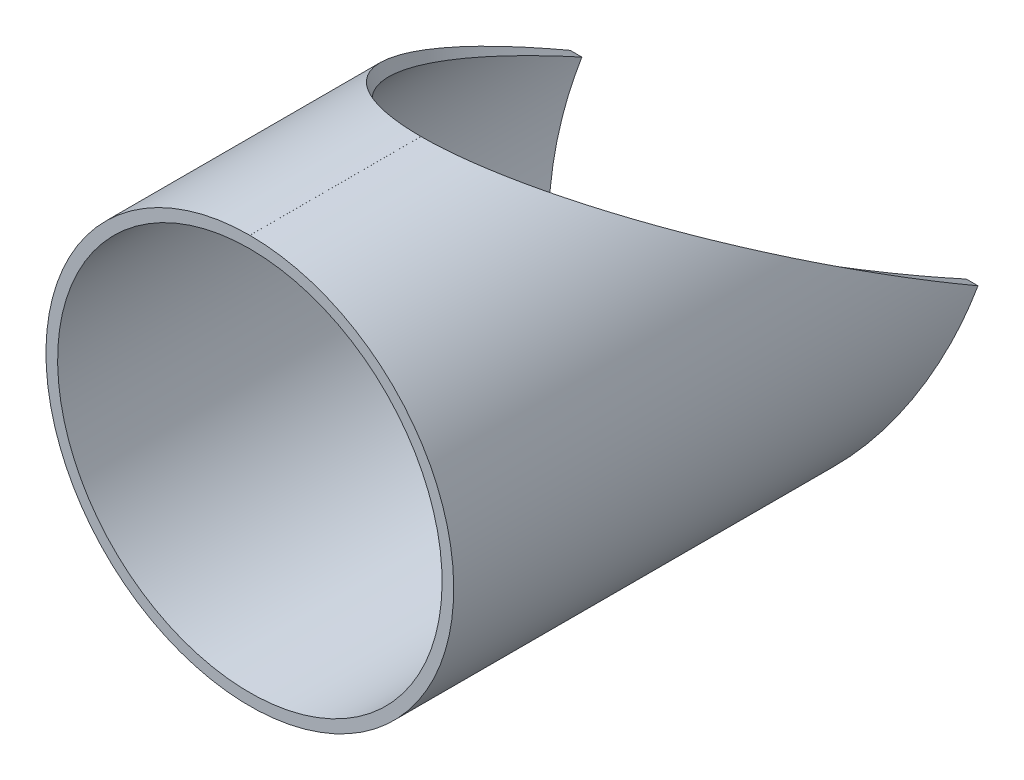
ISO-10303-21;
HEADER;
FILE_DESCRIPTION(('STEP AP214'),'2;1');
FILE_NAME('part.step','',(''),(''),'','','');
FILE_SCHEMA(('AUTOMOTIVE_DESIGN { 1 0 10303 214 1 1 1 1 }'));
ENDSEC;
DATA;
#1=APPLICATION_CONTEXT('core data for automotive mechanical design processes');
#2=APPLICATION_PROTOCOL_DEFINITION('international standard','automotive_design',2000,#1);
#3=PRODUCT_CONTEXT('',#1,'mechanical');
#4=PRODUCT('Part','Part','',(#3));
#5=PRODUCT_RELATED_PRODUCT_CATEGORY('part','',(#4));
#6=PRODUCT_DEFINITION_FORMATION('','',#4);
#7=PRODUCT_DEFINITION_CONTEXT('part definition',#1,'design');
#8=PRODUCT_DEFINITION('design','',#6,#7);
#9=PRODUCT_DEFINITION_SHAPE('','',#8);
#10=(LENGTH_UNIT() NAMED_UNIT(*) SI_UNIT(.MILLI.,.METRE.));
#11=(NAMED_UNIT(*) PLANE_ANGLE_UNIT() SI_UNIT($,.RADIAN.));
#12=(NAMED_UNIT(*) SI_UNIT($,.STERADIAN.) SOLID_ANGLE_UNIT());
#13=UNCERTAINTY_MEASURE_WITH_UNIT(LENGTH_MEASURE(1.E-05),#10,'distance_accuracy_value','');
#14=(GEOMETRIC_REPRESENTATION_CONTEXT(3) GLOBAL_UNCERTAINTY_ASSIGNED_CONTEXT((#13)) GLOBAL_UNIT_ASSIGNED_CONTEXT((#10,
#11,#12)) REPRESENTATION_CONTEXT('',''));
#15=CARTESIAN_POINT('',(0.,0.,0.));
#16=DIRECTION('',(0.,0.,1.));
#17=DIRECTION('',(1.,0.,0.));
#18=AXIS2_PLACEMENT_3D('',#15,#16,#17);
#19=CARTESIAN_POINT('',(0.00500000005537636,560.,452.204371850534));
#20=CARTESIAN_POINT('',(0.137448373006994,559.999981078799,452.203697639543));
#21=CARTESIAN_POINT('',(0.25975430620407,559.99921618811,452.202413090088));
#22=CARTESIAN_POINT('',(0.427992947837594,559.997428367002,452.199570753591));
#23=CARTESIAN_POINT('',(0.481535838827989,559.996724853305,452.198470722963));
#24=CARTESIAN_POINT('',(0.558045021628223,559.995560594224,452.196591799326));
#25=CARTESIAN_POINT('',(0.582913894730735,559.995154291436,452.195927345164));
#26=CARTESIAN_POINT('',(0.619265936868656,559.994523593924,452.194873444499));
#27=CARTESIAN_POINT('',(0.631224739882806,559.994309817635,452.194512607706));
#28=CARTESIAN_POINT('',(0.648925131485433,559.993984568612,452.193957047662));
#29=CARTESIAN_POINT('',(0.65478562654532,559.99387538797,452.193769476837));
#30=CARTESIAN_POINT('',(0.666427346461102,559.993655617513,452.193389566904));
#31=CARTESIAN_POINT('',(0.670867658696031,559.993571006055,452.193242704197));
#32=CARTESIAN_POINT('',(0.904590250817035,559.989042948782,452.185316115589));
#33=CARTESIAN_POINT('',(1.12689711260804,559.982565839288,452.174185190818));
#34=CARTESIAN_POINT('',(1.57281538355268,559.965355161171,452.144362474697));
#35=CARTESIAN_POINT('',(1.79570796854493,559.954617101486,452.125761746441));
#36=CARTESIAN_POINT('',(2.1298858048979,559.935312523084,452.092326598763));
#37=CARTESIAN_POINT('',(2.24125157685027,559.928344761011,452.080259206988));
#38=CARTESIAN_POINT('',(2.46391923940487,559.913343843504,452.054279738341));
#39=CARTESIAN_POINT('',(2.57710690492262,559.905165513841,452.04011623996));
#40=CARTESIAN_POINT('',(3.12400228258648,559.863063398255,451.967201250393));
#41=CARTESIAN_POINT('',(3.56119203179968,559.821129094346,451.894567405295));
#42=CARTESIAN_POINT('',(4.21601743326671,559.745841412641,451.764163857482));
#43=CARTESIAN_POINT('',(4.43413267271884,559.718681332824,451.71712054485));
#44=CARTESIAN_POINT('',(4.7610068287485,559.674845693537,451.641192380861));
#45=CARTESIAN_POINT('',(4.86991509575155,559.659717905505,451.614989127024));
#46=CARTESIAN_POINT('',(5.03319545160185,559.63625256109,451.574343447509));
#47=CARTESIAN_POINT('',(5.08760856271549,559.628301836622,451.56057142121));
#48=CARTESIAN_POINT('',(5.16920679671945,559.616182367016,451.539578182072));
#49=CARTESIAN_POINT('',(5.19640263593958,559.612110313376,451.532524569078));
#50=CARTESIAN_POINT('',(5.25078701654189,559.603901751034,451.518305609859));
#51=CARTESIAN_POINT('',(5.27955373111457,559.59952323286,451.510721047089));
#52=CARTESIAN_POINT('',(6.12457293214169,559.469941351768,451.286255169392));
#53=CARTESIAN_POINT('',(6.94157800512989,559.314845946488,451.017584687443));
#54=CARTESIAN_POINT('',(8.16024321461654,559.037978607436,450.538069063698));
#55=CARTESIAN_POINT('',(8.56532399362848,558.938321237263,450.365478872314));
#56=CARTESIAN_POINT('',(9.17082553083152,558.777797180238,450.087466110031));
#57=CARTESIAN_POINT('',(9.37230607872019,558.722449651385,449.991607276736));
#58=CARTESIAN_POINT('',(9.67394571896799,558.636672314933,449.843037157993));
#59=CARTESIAN_POINT('',(9.7743954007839,558.607620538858,449.792716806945));
#60=CARTESIAN_POINT('',(9.92491821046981,558.563354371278,449.716040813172));
#61=CARTESIAN_POINT('',(9.97506719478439,558.548484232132,449.690282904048));
#62=CARTESIAN_POINT('',(10.0502519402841,558.526006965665,449.651347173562));
#63=CARTESIAN_POINT('',(10.0753070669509,558.518485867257,449.638318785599));
#64=CARTESIAN_POINT('',(10.1128799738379,558.507161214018,449.618701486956));
#65=CARTESIAN_POINT('',(10.1254026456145,558.503379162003,449.612149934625));
#66=CARTESIAN_POINT('',(10.1504447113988,558.495800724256,449.599021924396));
#67=CARTESIAN_POINT('',(10.164840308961,558.491434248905,449.591457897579));
#68=CARTESIAN_POINT('',(11.5375993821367,558.074317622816,448.868884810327));
#69=CARTESIAN_POINT('',(12.8870072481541,557.573404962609,448.000638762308));
#70=CARTESIAN_POINT('',(14.8742267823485,556.690421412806,446.471358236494));
#71=CARTESIAN_POINT('',(15.5304737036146,556.374182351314,445.923779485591));
#72=CARTESIAN_POINT('',(16.5032911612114,555.86705570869,445.045683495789));
#73=CARTESIAN_POINT('',(16.8256376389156,555.692553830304,444.743530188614));
#74=CARTESIAN_POINT('',(17.305974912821,555.42263929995,444.27611826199));
#75=CARTESIAN_POINT('',(17.4655569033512,555.331307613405,444.117950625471));
#76=CARTESIAN_POINT('',(17.7040973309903,555.192274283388,443.877153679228));
#77=CARTESIAN_POINT('',(17.7834720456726,555.145590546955,443.796297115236));
#78=CARTESIAN_POINT('',(17.9023213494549,555.075056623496,443.674125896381));
#79=CARTESIAN_POINT('',(17.9419023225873,555.051460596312,443.633254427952));
#80=CARTESIAN_POINT('',(18.0012200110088,555.015939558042,443.571725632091));
#81=CARTESIAN_POINT('',(18.0209836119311,555.00407804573,443.551179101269));
#82=CARTESIAN_POINT('',(18.0506154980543,554.986254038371,443.52030390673));
#83=CARTESIAN_POINT('',(18.060490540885,554.980307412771,443.510002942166));
#84=CARTESIAN_POINT('',(18.0752997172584,554.971379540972,443.494537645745));
#85=CARTESIAN_POINT('',(18.0802355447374,554.968402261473,443.489380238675));
#86=CARTESIAN_POINT('',(18.0901060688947,554.962445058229,443.47906080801));
#87=CARTESIAN_POINT('',(18.095997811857,554.958886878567,443.472897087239));
#88=CARTESIAN_POINT('',(19.1181084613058,554.341318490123,442.403099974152));
#89=CARTESIAN_POINT('',(20.1187531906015,553.665810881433,441.232551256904));
#90=CARTESIAN_POINT('',(21.5812820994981,552.56123201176,439.319356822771));
#91=CARTESIAN_POINT('',(22.0623764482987,552.177835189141,438.655396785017));
#92=CARTESIAN_POINT('',(22.7727960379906,551.579984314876,437.62011388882));
#93=CARTESIAN_POINT('',(23.0077317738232,551.376909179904,437.26846245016));
#94=CARTESIAN_POINT('',(23.3571253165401,551.066625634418,436.731149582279));
#95=CARTESIAN_POINT('',(23.4730881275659,550.962252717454,436.550406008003));
#96=CARTESIAN_POINT('',(23.6462540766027,550.804278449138,436.276831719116));
#97=CARTESIAN_POINT('',(23.7038463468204,550.751384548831,436.185230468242));
#98=CARTESIAN_POINT('',(23.7900369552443,550.671690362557,436.047213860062));
#99=CARTESIAN_POINT('',(23.8187341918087,550.645066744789,436.001105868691));
#100=CARTESIAN_POINT('',(23.8617301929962,550.605043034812,435.931790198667));
#101=CARTESIAN_POINT('',(23.8760538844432,550.591687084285,435.908659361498));
#102=CARTESIAN_POINT('',(23.8975269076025,550.571631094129,435.873924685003));
#103=CARTESIAN_POINT('',(23.9046824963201,550.564942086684,435.862340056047));
#104=CARTESIAN_POINT('',(23.9154127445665,550.554903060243,435.844953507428));
#105=CARTESIAN_POINT('',(23.9189889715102,550.551555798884,435.839156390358));
#106=CARTESIAN_POINT('',(23.9261403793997,550.544859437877,435.827558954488));
#107=CARTESIAN_POINT('',(23.9303260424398,550.540938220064,435.82076778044));
#108=CARTESIAN_POINT('',(24.6921191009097,549.827017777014,434.58432422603));
#109=CARTESIAN_POINT('',(25.4329285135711,549.06920928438,433.271441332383));
#110=CARTESIAN_POINT('',(26.5070884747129,547.86185557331,431.180241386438));
#111=CARTESIAN_POINT('',(26.8589583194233,547.44764332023,430.462862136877));
#112=CARTESIAN_POINT('',(27.3761695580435,546.808723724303,429.356324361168));
#113=CARTESIAN_POINT('',(27.5468072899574,546.592817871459,428.982400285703));
#114=CARTESIAN_POINT('',(27.7999464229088,546.264573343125,428.413896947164));
#115=CARTESIAN_POINT('',(27.8838565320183,546.15442760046,428.22312629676));
#116=CARTESIAN_POINT('',(28.0089960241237,545.988114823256,427.935066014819));
#117=CARTESIAN_POINT('',(28.0505882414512,545.932494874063,427.83872853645));
#118=CARTESIAN_POINT('',(28.1127924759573,545.848791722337,427.693746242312));
#119=CARTESIAN_POINT('',(28.1334965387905,545.820845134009,427.645339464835));
#120=CARTESIAN_POINT('',(28.1645062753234,545.778856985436,427.572610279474));
#121=CARTESIAN_POINT('',(28.1748351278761,545.764849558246,427.548347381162));
#122=CARTESIAN_POINT('',(28.19031677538,545.743821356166,427.511923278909));
#123=CARTESIAN_POINT('',(28.1954753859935,545.736809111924,427.49977695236));
#124=CARTESIAN_POINT('',(28.2032103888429,545.726286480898,427.48155002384));
#125=CARTESIAN_POINT('',(28.2057882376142,545.722778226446,427.475473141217));
#126=CARTESIAN_POINT('',(28.2109429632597,545.715760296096,427.463316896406));
#127=CARTESIAN_POINT('',(28.2139217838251,545.711702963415,427.456288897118));
#128=CARTESIAN_POINT('',(28.7727546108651,544.950281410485,426.137373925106));
#129=CARTESIAN_POINT('',(29.312438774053,544.150833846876,424.752258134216));
#130=CARTESIAN_POINT('',(30.0866826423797,542.889519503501,422.567585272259));
#131=CARTESIAN_POINT('',(30.3388752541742,542.458736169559,421.821527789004));
#132=CARTESIAN_POINT('',(30.7070332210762,541.797077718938,420.675691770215));
#133=CARTESIAN_POINT('',(30.8280635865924,541.573945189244,420.289288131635));
#134=CARTESIAN_POINT('',(31.0069094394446,541.235389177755,419.702995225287));
#135=CARTESIAN_POINT('',(31.0660747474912,541.121894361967,419.506449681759));
#136=CARTESIAN_POINT('',(31.154126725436,540.950689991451,419.209959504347));
#137=CARTESIAN_POINT('',(31.1833613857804,540.893461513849,419.110850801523));
#138=CARTESIAN_POINT('',(31.2270367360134,540.807378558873,418.961769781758));
#139=CARTESIAN_POINT('',(31.2415657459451,540.77864420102,418.912006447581));
#140=CARTESIAN_POINT('',(31.2633147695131,540.73548264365,418.837256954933));
#141=CARTESIAN_POINT('',(31.2705570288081,540.721085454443,418.812323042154));
#142=CARTESIAN_POINT('',(31.2814092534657,540.699474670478,418.774896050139));
#143=CARTESIAN_POINT('',(31.2850248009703,540.692268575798,418.762416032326));
#144=CARTESIAN_POINT('',(31.2904453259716,540.681455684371,418.743689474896));
#145=CARTESIAN_POINT('',(31.2922517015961,540.677850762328,418.737446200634));
#146=CARTESIAN_POINT('',(31.2958635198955,540.670639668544,418.724957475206));
#147=CARTESIAN_POINT('',(31.2979566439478,540.6664586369,418.717716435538));
#148=CARTESIAN_POINT('',(31.687901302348,539.887250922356,417.368221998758));
#149=CARTESIAN_POINT('',(32.0613631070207,539.068886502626,415.950378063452));
#150=CARTESIAN_POINT('',(32.5876876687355,537.777275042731,413.713211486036));
#151=CARTESIAN_POINT('',(32.7574731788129,537.336073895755,412.949089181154));
#152=CARTESIAN_POINT('',(33.0021425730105,536.65831375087,411.775305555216));
#153=CARTESIAN_POINT('',(33.0820302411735,536.429734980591,411.379444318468));
#154=CARTESIAN_POINT('',(33.1991622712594,536.082893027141,410.778752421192));
#155=CARTESIAN_POINT('',(33.2377563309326,535.966616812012,410.577371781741));
#156=CARTESIAN_POINT('',(33.2949476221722,535.791211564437,410.273575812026));
#157=CARTESIAN_POINT('',(33.3138947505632,535.73257799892,410.172022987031));
#158=CARTESIAN_POINT('',(33.3421373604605,535.64438026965,410.019262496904));
#159=CARTESIAN_POINT('',(33.3515218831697,535.61493979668,409.968270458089));
#160=CARTESIAN_POINT('',(33.3655537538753,535.570717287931,409.891674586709));
#161=CARTESIAN_POINT('',(33.370223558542,535.555966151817,409.866124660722));
#162=CARTESIAN_POINT('',(33.3772169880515,535.533824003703,409.827772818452));
#163=CARTESIAN_POINT('',(33.379546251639,535.526440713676,409.814984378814));
#164=CARTESIAN_POINT('',(33.3830373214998,535.515361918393,409.795794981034));
#165=CARTESIAN_POINT('',(33.3842005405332,535.511668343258,409.789397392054));
#166=CARTESIAN_POINT('',(33.386526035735,535.504279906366,409.776599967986));
#167=CARTESIAN_POINT('',(33.3879161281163,535.49986039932,409.768944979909));
#168=CARTESIAN_POINT('',(33.627951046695,534.736349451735,408.446473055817));
#169=CARTESIAN_POINT('',(33.8560354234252,533.920320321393,407.032429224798));
#170=CARTESIAN_POINT('',(34.1651653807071,532.611983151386,404.766286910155));
#171=CARTESIAN_POINT('',(34.2626860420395,532.161840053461,403.986726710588));
#172=CARTESIAN_POINT('',(34.398421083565,531.465642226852,402.781117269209));
#173=CARTESIAN_POINT('',(34.4419070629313,531.230080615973,402.373202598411));
#174=CARTESIAN_POINT('',(34.5042026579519,530.871517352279,401.752263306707));
#175=CARTESIAN_POINT('',(34.5244788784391,530.751126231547,401.543772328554));
#176=CARTESIAN_POINT('',(34.5541221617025,530.569238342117,401.228769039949));
#177=CARTESIAN_POINT('',(34.5638747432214,530.508392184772,401.123390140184));
#178=CARTESIAN_POINT('',(34.5783061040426,530.416798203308,400.964755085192));
#179=CARTESIAN_POINT('',(34.5830836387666,530.386212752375,400.911782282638));
#180=CARTESIAN_POINT('',(34.5901999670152,530.340253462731,400.83218140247));
#181=CARTESIAN_POINT('',(34.5925637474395,530.324920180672,400.805624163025));
#182=CARTESIAN_POINT('',(34.5960968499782,530.301899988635,400.765752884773));
#183=CARTESIAN_POINT('',(34.5972724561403,530.294223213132,400.752456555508));
#184=CARTESIAN_POINT('',(34.5990327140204,530.282702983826,400.73250320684));
#185=CARTESIAN_POINT('',(34.5996189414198,530.278862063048,400.725850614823));
#186=CARTESIAN_POINT('',(34.6007903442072,530.271178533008,400.712542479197));
#187=CARTESIAN_POINT('',(34.6014967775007,530.266538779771,400.704506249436));
#188=CARTESIAN_POINT('',(34.661274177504,529.873564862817,400.02385926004));
#189=CARTESIAN_POINT('',(34.7175433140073,529.459471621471,399.306575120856));
#190=CARTESIAN_POINT('',(34.7935858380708,528.801981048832,398.167778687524));
#191=CARTESIAN_POINT('',(34.8175352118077,528.576761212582,397.777701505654));
#192=CARTESIAN_POINT('',(34.8508467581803,528.229856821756,397.176868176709));
#193=CARTESIAN_POINT('',(34.8615149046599,528.11270976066,396.973970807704));
#194=CARTESIAN_POINT('',(34.8767966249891,527.934723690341,396.665695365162));
#195=CARTESIAN_POINT('',(34.8817704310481,527.875017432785,396.562281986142));
#196=CARTESIAN_POINT('',(34.8890424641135,527.784892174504,396.406179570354));
#197=CARTESIAN_POINT('',(34.8914350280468,527.754756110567,396.353981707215));
#198=CARTESIAN_POINT('',(34.8949756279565,527.709410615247,396.275439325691));
#199=CARTESIAN_POINT('',(34.8961477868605,527.694271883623,396.249217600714));
#200=CARTESIAN_POINT('',(34.8978938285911,527.671528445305,396.209823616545));
#201=CARTESIAN_POINT('',(34.8984738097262,527.663941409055,396.196682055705));
#202=CARTESIAN_POINT('',(34.8993407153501,527.652552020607,396.176954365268));
#203=CARTESIAN_POINT('',(34.8996291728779,527.648754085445,396.17037591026));
#204=CARTESIAN_POINT('',(34.9000610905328,527.643054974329,396.160504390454));
#205=CARTESIAN_POINT('',(34.9002049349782,527.641154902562,396.157213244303));
#206=CARTESIAN_POINT('',(34.9004923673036,527.637354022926,396.150629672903));
#207=CARTESIAN_POINT('',(34.90069236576,527.634705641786,396.146042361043));
#208=CARTESIAN_POINT('',(34.9453484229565,527.042907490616,395.120976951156));
#209=CARTESIAN_POINT('',(34.9999999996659,526.165103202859,393.600605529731));
#210=CARTESIAN_POINT('',(35.000000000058,525.000000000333,391.582594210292));
#211=CARTESIAN_POINT('',(0.00471428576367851,558.000000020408,452.20437186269));
#212=CARTESIAN_POINT('',(0.129594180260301,557.999982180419,452.2036976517));
#213=CARTESIAN_POINT('',(0.24491120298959,557.999260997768,452.202413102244));
#214=CARTESIAN_POINT('',(0.403536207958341,557.997575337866,452.199570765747));
#215=CARTESIAN_POINT('',(0.454019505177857,557.996912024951,452.198470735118));
#216=CARTESIAN_POINT('',(0.52615673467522,557.99581429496,452.196591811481));
#217=CARTESIAN_POINT('',(0.549604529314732,557.995431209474,452.195927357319));
#218=CARTESIAN_POINT('',(0.583879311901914,557.994836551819,452.194873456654));
#219=CARTESIAN_POINT('',(0.595154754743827,557.994634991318,452.194512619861));
#220=CARTESIAN_POINT('',(0.611843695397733,557.994328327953,452.193957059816));
#221=CARTESIAN_POINT('',(0.617369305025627,557.994225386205,452.193769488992));
#222=CARTESIAN_POINT('',(0.628345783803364,557.99401817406,452.193389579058));
#223=CARTESIAN_POINT('',(0.632532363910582,557.993938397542,452.193242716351));
#224=CARTESIAN_POINT('',(0.852899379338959,557.989669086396,452.185316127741));
#225=CARTESIAN_POINT('',(1.06250299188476,557.983562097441,452.174185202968));
#226=CARTESIAN_POINT('',(1.48294021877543,557.967334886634,452.144362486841));
#227=CARTESIAN_POINT('',(1.69309608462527,557.957210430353,452.125761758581));
#228=CARTESIAN_POINT('',(2.00817804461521,557.939008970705,452.092326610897));
#229=CARTESIAN_POINT('',(2.1131800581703,557.932439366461,452.08025921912));
#230=CARTESIAN_POINT('',(2.32312385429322,557.918295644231,452.054279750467));
#231=CARTESIAN_POINT('',(2.42984365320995,557.910584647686,452.040116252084));
#232=CARTESIAN_POINT('',(2.94548786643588,557.870888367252,451.967201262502));
#233=CARTESIAN_POINT('',(3.35769534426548,557.831350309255,451.894567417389));
#234=CARTESIAN_POINT('',(3.97510215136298,557.760364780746,451.76416386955));
#235=CARTESIAN_POINT('',(4.18075366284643,557.734756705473,451.717120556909));
#236=CARTESIAN_POINT('',(4.48894929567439,557.693425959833,451.641192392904));
#237=CARTESIAN_POINT('',(4.59163423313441,557.679162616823,451.614989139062));
#238=CARTESIAN_POINT('',(4.74558428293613,557.657038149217,451.574343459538));
#239=CARTESIAN_POINT('',(4.7968880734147,557.649541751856,451.560571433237));
#240=CARTESIAN_POINT('',(4.87382355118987,557.638114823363,451.539578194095));
#241=CARTESIAN_POINT('',(4.89946534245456,557.6342754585,451.532524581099));
#242=CARTESIAN_POINT('',(4.95074204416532,557.626535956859,451.518305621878));
#243=CARTESIAN_POINT('',(4.9778649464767,557.622407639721,451.510721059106));
#244=CARTESIAN_POINT('',(5.77459733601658,557.500230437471,451.286255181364));
#245=CARTESIAN_POINT('',(6.54491640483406,557.353997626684,451.017584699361));
#246=CARTESIAN_POINT('',(7.69394360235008,557.092951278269,450.53806907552));
#247=CARTESIAN_POINT('',(8.07587690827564,556.998988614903,450.365478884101));
#248=CARTESIAN_POINT('',(8.64677835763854,556.84763736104,450.087466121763));
#249=CARTESIAN_POINT('',(8.83674573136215,556.795452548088,449.991607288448));
#250=CARTESIAN_POINT('',(9.12114882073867,556.714576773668,449.843037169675));
#251=CARTESIAN_POINT('',(9.21585852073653,556.687185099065,449.792716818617));
#252=CARTESIAN_POINT('',(9.35778002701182,556.645448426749,449.716040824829));
#253=CARTESIAN_POINT('',(9.40506335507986,556.631428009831,449.6902829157));
#254=CARTESIAN_POINT('',(9.47595182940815,556.610235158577,449.651347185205));
#255=CARTESIAN_POINT('',(9.49957523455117,556.603143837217,449.638318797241));
#256=CARTESIAN_POINT('',(9.53500111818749,556.592466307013,449.618701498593));
#257=CARTESIAN_POINT('',(9.54680820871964,556.588900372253,449.612149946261));
#258=CARTESIAN_POINT('',(9.57041929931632,556.581754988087,449.59902193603));
#259=CARTESIAN_POINT('',(9.58399229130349,556.577638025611,449.591457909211));
#260=CARTESIAN_POINT('',(10.8783079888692,556.184356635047,448.868884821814));
#261=CARTESIAN_POINT('',(12.1506068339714,555.712067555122,448.000638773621));
#262=CARTESIAN_POINT('',(14.0242709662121,554.879540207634,446.4713582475));
#263=CARTESIAN_POINT('',(14.6430180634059,554.581371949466,445.923779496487));
#264=CARTESIAN_POINT('',(15.5602459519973,554.10322397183,445.045683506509));
#265=CARTESIAN_POINT('',(15.8641726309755,553.938693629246,444.743530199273));
#266=CARTESIAN_POINT('',(16.3170620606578,553.684202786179,444.276118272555));
#267=CARTESIAN_POINT('',(16.4675250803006,553.598090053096,444.117950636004));
#268=CARTESIAN_POINT('',(16.6924346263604,553.46700148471,443.877153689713));
#269=CARTESIAN_POINT('',(16.7672736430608,553.422985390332,443.796297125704));
#270=CARTESIAN_POINT('',(16.8793315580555,553.356481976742,443.674125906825));
#271=CARTESIAN_POINT('',(16.9166507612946,553.334234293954,443.633254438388));
#272=CARTESIAN_POINT('',(16.9725788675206,553.300743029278,443.571725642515));
#273=CARTESIAN_POINT('',(16.9912131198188,553.289559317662,443.551179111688));
#274=CARTESIAN_POINT('',(17.0191517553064,553.272753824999,443.520303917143));
#275=CARTESIAN_POINT('',(17.0284625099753,553.267147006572,443.510002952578));
#276=CARTESIAN_POINT('',(17.0424254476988,553.258729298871,443.494537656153));
#277=CARTESIAN_POINT('',(17.0470792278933,553.255922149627,443.489380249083));
#278=CARTESIAN_POINT('',(17.0563857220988,553.250305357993,443.479060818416));
#279=CARTESIAN_POINT('',(17.0619407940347,553.246950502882,443.472897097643));
#280=CARTESIAN_POINT('',(18.0256451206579,552.664671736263,442.403099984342));
#281=CARTESIAN_POINT('',(18.9691101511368,552.027764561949,441.232551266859));
#282=CARTESIAN_POINT('',(20.3480659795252,550.986304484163,439.319356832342));
#283=CARTESIAN_POINT('',(20.8016692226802,550.624816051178,438.655396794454));
#284=CARTESIAN_POINT('',(21.4714934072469,550.061128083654,437.62011389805));
#285=CARTESIAN_POINT('',(21.6930042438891,549.869657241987,437.268462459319));
#286=CARTESIAN_POINT('',(22.022432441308,549.577104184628,436.73114959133));
#287=CARTESIAN_POINT('',(22.1317688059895,549.478695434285,436.550406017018));
#288=CARTESIAN_POINT('',(22.2950395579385,549.32974826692,436.276831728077));
#289=CARTESIAN_POINT('',(22.3493408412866,549.27987687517,436.185230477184));
#290=CARTESIAN_POINT('',(22.4306062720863,549.20473664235,436.047213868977));
#291=CARTESIAN_POINT('',(22.4576636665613,549.179634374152,436.001105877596));
#292=CARTESIAN_POINT('',(22.4982027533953,549.141897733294,435.931790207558));
#293=CARTESIAN_POINT('',(22.5117079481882,549.129304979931,435.908659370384));
#294=CARTESIAN_POINT('',(22.5319539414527,549.110395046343,435.873924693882));
#295=CARTESIAN_POINT('',(22.5387006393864,549.104088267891,435.862340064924));
#296=CARTESIAN_POINT('',(22.5488177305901,549.094622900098,435.844953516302));
#297=CARTESIAN_POINT('',(22.5521896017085,549.091466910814,435.83915639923));
#298=CARTESIAN_POINT('',(22.5589323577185,549.085153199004,435.827558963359));
#299=CARTESIAN_POINT('',(22.5628788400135,549.081456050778,435.820767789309));
#300=CARTESIAN_POINT('',(23.281140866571,548.408331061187,434.584324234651));
#301=CARTESIAN_POINT('',(23.9796183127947,547.693825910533,433.27144134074));
#302=CARTESIAN_POINT('',(24.9923977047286,546.555463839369,431.180241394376));
#303=CARTESIAN_POINT('',(25.32416070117,546.164920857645,430.462862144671));
#304=CARTESIAN_POINT('',(25.8118170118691,545.562510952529,429.35632436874));
#305=CARTESIAN_POINT('',(25.9727040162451,545.358942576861,428.9824002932));
#306=CARTESIAN_POINT('',(26.211378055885,545.04945487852,428.413896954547));
#307=CARTESIAN_POINT('',(26.2904933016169,544.945603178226,428.223126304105));
#308=CARTESIAN_POINT('',(26.408481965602,544.788793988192,427.935066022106));
#309=CARTESIAN_POINT('',(26.4476974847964,544.736352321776,427.838728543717));
#310=CARTESIAN_POINT('',(26.5063471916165,544.657432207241,427.69374624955));
#311=CARTESIAN_POINT('',(26.525868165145,544.631082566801,427.645339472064));
#312=CARTESIAN_POINT('',(26.5551059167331,544.591493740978,427.572610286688));
#313=CARTESIAN_POINT('',(26.56484454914,544.578286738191,427.548347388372));
#314=CARTESIAN_POINT('',(26.5794415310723,544.558460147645,427.511923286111));
#315=CARTESIAN_POINT('',(26.5843053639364,544.55184860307,427.49977695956));
#316=CARTESIAN_POINT('',(26.591598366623,544.541927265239,427.481550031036));
#317=CARTESIAN_POINT('',(26.5940289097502,544.538619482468,427.475473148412));
#318=CARTESIAN_POINT('',(26.5988890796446,544.532002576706,427.463316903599));
#319=CARTESIAN_POINT('',(26.6016976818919,544.528177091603,427.456288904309));
#320=CARTESIAN_POINT('',(27.1285972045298,543.81026534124,426.137373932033));
#321=CARTESIAN_POINT('',(27.6374422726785,543.056500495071,424.752258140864));
#322=CARTESIAN_POINT('',(28.3674436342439,541.867261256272,422.56758527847));
#323=CARTESIAN_POINT('',(28.6052252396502,541.461094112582,421.821527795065));
#324=CARTESIAN_POINT('',(28.9523456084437,540.837244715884,420.675691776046));
#325=CARTESIAN_POINT('',(29.0664599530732,540.626862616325,420.289288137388));
#326=CARTESIAN_POINT('',(29.2350860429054,540.307652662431,419.702995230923));
#327=CARTESIAN_POINT('',(29.2908704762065,540.20064326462,419.506449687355));
#328=CARTESIAN_POINT('',(29.3738909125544,540.039222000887,419.209959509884));
#329=CARTESIAN_POINT('',(29.4014550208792,539.985263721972,419.110850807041));
#330=CARTESIAN_POINT('',(29.4426346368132,539.904099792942,418.961769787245));
#331=CARTESIAN_POINT('',(29.4563334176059,539.877007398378,418.912006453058));
#332=CARTESIAN_POINT('',(29.4768396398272,539.836312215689,418.837256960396));
#333=CARTESIAN_POINT('',(29.4836680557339,539.822737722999,418.812323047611));
#334=CARTESIAN_POINT('',(29.4939001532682,539.802361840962,418.774896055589));
#335=CARTESIAN_POINT('',(29.4973090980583,539.795567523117,418.762416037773));
#336=CARTESIAN_POINT('',(29.5024198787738,539.785372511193,418.743689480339));
#337=CARTESIAN_POINT('',(29.504123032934,539.781973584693,418.737446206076));
#338=CARTESIAN_POINT('',(29.5075284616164,539.775174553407,418.724957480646));
#339=CARTESIAN_POINT('',(29.5095019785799,539.771232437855,418.717716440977));
#340=CARTESIAN_POINT('',(29.8771640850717,539.036550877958,417.368222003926));
#341=CARTESIAN_POINT('',(30.2292852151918,538.264950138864,415.950378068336));
#342=CARTESIAN_POINT('',(30.7255340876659,537.047145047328,413.713211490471));
#343=CARTESIAN_POINT('',(30.8856175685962,536.6311553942,412.949089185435));
#344=CARTESIAN_POINT('',(31.116305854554,535.992124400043,411.775305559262));
#345=CARTESIAN_POINT('',(31.1916285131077,535.776607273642,411.379444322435));
#346=CARTESIAN_POINT('',(31.3020672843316,535.449584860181,410.778752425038));
#347=CARTESIAN_POINT('',(31.3384559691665,535.339953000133,410.577371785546));
#348=CARTESIAN_POINT('',(31.3923791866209,535.174570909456,410.27357581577));
#349=CARTESIAN_POINT('',(31.410243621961,535.119287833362,410.172022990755));
#350=CARTESIAN_POINT('',(31.4368723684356,535.036129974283,410.019262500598));
#351=CARTESIAN_POINT('',(31.4457206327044,535.008371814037,409.968270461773));
#352=CARTESIAN_POINT('',(31.4589506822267,534.966676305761,409.891674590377));
#353=CARTESIAN_POINT('',(31.4633536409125,534.952768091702,409.866124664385));
#354=CARTESIAN_POINT('',(31.4699474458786,534.931891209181,409.827772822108));
#355=CARTESIAN_POINT('',(31.4721436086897,534.924929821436,409.814984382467));
#356=CARTESIAN_POINT('',(31.4754351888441,534.914484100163,409.795794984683));
#357=CARTESIAN_POINT('',(31.4765319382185,534.911001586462,409.789397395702));
#358=CARTESIAN_POINT('',(31.4787245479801,534.904035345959,409.776599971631));
#359=CARTESIAN_POINT('',(31.4800352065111,534.899868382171,409.768944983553));
#360=CARTESIAN_POINT('',(31.7063538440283,534.179986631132,408.446473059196));
#361=CARTESIAN_POINT('',(31.9214048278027,533.410587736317,407.032429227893));
#362=CARTESIAN_POINT('',(32.2128702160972,532.177012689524,404.766286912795));
#363=CARTESIAN_POINT('',(32.3048182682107,531.752592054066,403.986726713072));
#364=CARTESIAN_POINT('',(32.4327970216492,531.096176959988,402.781117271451));
#365=CARTESIAN_POINT('',(32.4737980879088,530.874076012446,402.373202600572));
#366=CARTESIAN_POINT('',(32.5325339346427,530.53600207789,401.752263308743));
#367=CARTESIAN_POINT('',(32.5516515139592,530.422490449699,401.543772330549));
#368=CARTESIAN_POINT('',(32.5796008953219,530.250996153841,401.22876904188));
#369=CARTESIAN_POINT('',(32.5887961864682,530.193626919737,401.123390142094));
#370=CARTESIAN_POINT('',(32.6024028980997,530.107266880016,400.96475508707));
#371=CARTESIAN_POINT('',(32.6069074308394,530.078429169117,400.911782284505));
#372=CARTESIAN_POINT('',(32.6136171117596,530.035096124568,400.832181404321));
#373=CARTESIAN_POINT('',(32.6158458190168,530.020639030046,400.805624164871));
#374=CARTESIAN_POINT('',(32.6191770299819,529.99893427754,400.765752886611));
#375=CARTESIAN_POINT('',(32.620285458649,529.991696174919,400.752456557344));
#376=CARTESIAN_POINT('',(32.6219451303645,529.980834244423,400.732503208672));
#377=CARTESIAN_POINT('',(32.6224978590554,529.977212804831,400.725850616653));
#378=CARTESIAN_POINT('',(32.6236023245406,529.969968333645,400.712542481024));
#379=CARTESIAN_POINT('',(32.6242683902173,529.965593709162,400.704506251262));
#380=CARTESIAN_POINT('',(32.6806299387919,529.595075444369,400.023859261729));
#381=CARTESIAN_POINT('',(32.7336836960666,529.204644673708,399.306575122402));
#382=CARTESIAN_POINT('',(32.8053809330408,528.584724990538,398.167778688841));
#383=CARTESIAN_POINT('',(32.8279617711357,528.372374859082,397.777701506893));
#384=CARTESIAN_POINT('',(32.8593698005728,528.045293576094,397.176868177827));
#385=CARTESIAN_POINT('',(32.8694283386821,527.934840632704,396.973970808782));
#386=CARTESIAN_POINT('',(32.8838368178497,527.767025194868,396.665695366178));
#387=CARTESIAN_POINT('',(32.8885264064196,527.710730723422,396.562281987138));
#388=CARTESIAN_POINT('',(32.8953828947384,527.625755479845,396.406179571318));
#389=CARTESIAN_POINT('',(32.8976387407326,527.597341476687,396.353981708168));
#390=CARTESIAN_POINT('',(32.9009770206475,527.5545871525,396.275439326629));
#391=CARTESIAN_POINT('',(32.9020821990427,527.540313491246,396.249217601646));
#392=CARTESIAN_POINT('',(32.9037284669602,527.518869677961,396.209823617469));
#393=CARTESIAN_POINT('',(32.9042753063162,527.511716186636,396.196682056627));
#394=CARTESIAN_POINT('',(32.9050926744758,527.500977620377,396.176954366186));
#395=CARTESIAN_POINT('',(32.9053646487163,527.49739671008,396.170375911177));
#396=CARTESIAN_POINT('',(32.9057718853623,527.492023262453,396.160504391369));
#397=CARTESIAN_POINT('',(32.9059075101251,527.490231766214,396.157213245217));
#398=CARTESIAN_POINT('',(32.9061785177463,527.486648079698,396.150629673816));
#399=CARTESIAN_POINT('',(32.9063670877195,527.484151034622,396.146042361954));
#400=CARTESIAN_POINT('',(32.9484713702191,526.926169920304,395.120976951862));
#401=CARTESIAN_POINT('',(32.9999999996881,526.098520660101,393.600595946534));
#402=CARTESIAN_POINT('',(33.000000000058,524.999999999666,391.582594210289));
#403=B_SPLINE_SURFACE_WITH_KNOTS('',1,3,((#19,#20,#21,#22,#23,#24,#25,#26,#27,#28,#29,#30,#31,
#32,#33,#34,#35,#36,#37,#38,#39,#40,#41,#42,#43,#44,#45,#46,#47,#48,#49,#50,#51,#52,#53,#54,#55,
#56,#57,#58,#59,#60,#61,#62,#63,#64,#65,#66,#67,#68,#69,#70,#71,#72,#73,#74,#75,#76,#77,#78,#79,
#80,#81,#82,#83,#84,#85,#86,#87,#88,#89,#90,#91,#92,#93,#94,#95,#96,#97,#98,#99,#100,#101,#102,
#103,#104,#105,#106,#107,#108,#109,#110,#111,#112,#113,#114,#115,#116,#117,#118,#119,#120,#121,
#122,#123,#124,#125,#126,#127,#128,#129,#130,#131,#132,#133,#134,#135,#136,#137,#138,#139,#140,
#141,#142,#143,#144,#145,#146,#147,#148,#149,#150,#151,#152,#153,#154,#155,#156,#157,#158,#159,
#160,#161,#162,#163,#164,#165,#166,#167,#168,#169,#170,#171,#172,#173,#174,#175,#176,#177,#178,
#179,#180,#181,#182,#183,#184,#185,#186,#187,#188,#189,#190,#191,#192,#193,#194,#195,#196,#197,
#198,#199,#200,#201,#202,#203,#204,#205,#206,#207,#208,#209,#210),(#211,#212,#213,#214,#215,
#216,#217,#218,#219,#220,#221,#222,#223,#224,#225,#226,#227,#228,#229,#230,#231,#232,#233,#234,
#235,#236,#237,#238,#239,#240,#241,#242,#243,#244,#245,#246,#247,#248,#249,#250,#251,#252,#253,
#254,#255,#256,#257,#258,#259,#260,#261,#262,#263,#264,#265,#266,#267,#268,#269,#270,#271,#272,
#273,#274,#275,#276,#277,#278,#279,#280,#281,#282,#283,#284,#285,#286,#287,#288,#289,#290,#291,
#292,#293,#294,#295,#296,#297,#298,#299,#300,#301,#302,#303,#304,#305,#306,#307,#308,#309,#310,
#311,#312,#313,#314,#315,#316,#317,#318,#319,#320,#321,#322,#323,#324,#325,#326,#327,#328,#329,
#330,#331,#332,#333,#334,#335,#336,#337,#338,#339,#340,#341,#342,#343,#344,#345,#346,#347,#348,
#349,#350,#351,#352,#353,#354,#355,#356,#357,#358,#359,#360,#361,#362,#363,#364,#365,#366,#367,
#368,#369,#370,#371,#372,#373,#374,#375,#376,#377,#378,#379,#380,#381,#382,#383,#384,#385,#386,
#387,#388,#389,#390,#391,#392,#393,#394,#395,#396,#397,#398,#399,#400,#401,#402)),.UNSPECIFIED.,
.F.,.F.,.F.,(2,2),(4,2,2,2,2,2,2,2,2,2,2,2,2,2,2,2,2,2,2,2,2,2,2,2,2,2,2,2,2,2,2,2,2,2,2,2,2,2,
2,2,2,2,2,2,2,2,2,2,2,2,2,2,2,2,2,2,2,2,2,2,2,2,2,2,2,2,2,2,2,2,2,2,2,2,2,2,2,2,2,2,2,2,2,2,2,2,
2,2,2,2,2,2,2,2,2,4),(0.,1.),(0.,0.00390625,0.005859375,0.0068359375,0.00732421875,
0.007568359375,0.0078125,0.015625,0.0234375,0.02734375,0.03125,0.046875,0.0546875,0.05859375,
0.060546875,0.0615234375,0.0625,0.09375,0.109375,0.1171875,0.12109375,0.123046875,0.1240234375,
0.12451171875,0.125,0.1875,0.21875,0.234375,0.2421875,0.24609375,0.248046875,0.2490234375,
0.24951171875,0.249755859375,0.25,0.3125,0.34375,0.359375,0.3671875,0.37109375,0.373046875,
0.3740234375,0.37451171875,0.374755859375,0.375,0.4375,0.46875,0.484375,0.4921875,0.49609375,
0.498046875,0.4990234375,0.49951171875,0.499755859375,0.5,0.5625,0.59375,0.609375,0.6171875,
0.62109375,0.623046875,0.6240234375,0.62451171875,0.624755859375,0.625,0.6875,0.71875,0.734375,
0.7421875,0.74609375,0.748046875,0.7490234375,0.74951171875,0.749755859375,0.75,0.8125,0.84375,
0.859375,0.8671875,0.87109375,0.873046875,0.8740234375,0.87451171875,0.874755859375,0.875,
0.90625,0.921875,0.9296875,0.93359375,0.935546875,0.9365234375,0.93701171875,0.937255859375,
0.9373779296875,0.9375,1.),.UNSPECIFIED.);
#404=CARTESIAN_POINT('',(33.000000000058,524.999999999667,391.582594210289));
#405=CARTESIAN_POINT('',(35.000000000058,525.000000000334,391.582594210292));
#406=B_SPLINE_CURVE_WITH_KNOTS('',1,(#404,#405),.UNSPECIFIED.,.F.,.F.,(2,2),(0.,1.),.UNSPECIFIED.);
#407=CARTESIAN_POINT('',(33.000000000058,524.999999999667,391.582594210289));
#408=VERTEX_POINT('',#407);
#409=CARTESIAN_POINT('',(35.000000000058,525.000000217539,391.582594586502));
#410=VERTEX_POINT('',#409);
#411=EDGE_CURVE('E13',#408,#410,#406,.T.);
#412=CARTESIAN_POINT('',(33.000000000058,524.999999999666,391.582594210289));
#413=CARTESIAN_POINT('',(32.9999999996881,526.098520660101,393.600595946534));
#414=CARTESIAN_POINT('',(32.9484713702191,526.926169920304,395.120976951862));
#415=CARTESIAN_POINT('',(32.9063670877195,527.484151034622,396.146042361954));
#416=CARTESIAN_POINT('',(32.9061785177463,527.486648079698,396.150629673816));
#417=CARTESIAN_POINT('',(32.9059075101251,527.490231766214,396.157213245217));
#418=CARTESIAN_POINT('',(32.9057718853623,527.492023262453,396.160504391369));
#419=CARTESIAN_POINT('',(32.9053646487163,527.49739671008,396.170375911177));
#420=CARTESIAN_POINT('',(32.9050926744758,527.500977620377,396.176954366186));
#421=CARTESIAN_POINT('',(32.9042753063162,527.511716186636,396.196682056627));
#422=CARTESIAN_POINT('',(32.9037284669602,527.518869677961,396.209823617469));
#423=CARTESIAN_POINT('',(32.9020821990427,527.540313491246,396.249217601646));
#424=CARTESIAN_POINT('',(32.9009770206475,527.5545871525,396.275439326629));
#425=CARTESIAN_POINT('',(32.8976387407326,527.597341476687,396.353981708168));
#426=CARTESIAN_POINT('',(32.8953828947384,527.625755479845,396.406179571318));
#427=CARTESIAN_POINT('',(32.8885264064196,527.710730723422,396.562281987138));
#428=CARTESIAN_POINT('',(32.8838368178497,527.767025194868,396.665695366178));
#429=CARTESIAN_POINT('',(32.8694283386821,527.934840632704,396.973970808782));
#430=CARTESIAN_POINT('',(32.8593698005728,528.045293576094,397.176868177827));
#431=CARTESIAN_POINT('',(32.8279617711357,528.372374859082,397.777701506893));
#432=CARTESIAN_POINT('',(32.8053809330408,528.584724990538,398.167778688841));
#433=CARTESIAN_POINT('',(32.7336836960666,529.204644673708,399.306575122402));
#434=CARTESIAN_POINT('',(32.6806299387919,529.595075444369,400.023859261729));
#435=CARTESIAN_POINT('',(32.6242683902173,529.965593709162,400.704506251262));
#436=CARTESIAN_POINT('',(32.6236023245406,529.969968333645,400.712542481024));
#437=CARTESIAN_POINT('',(32.6224978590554,529.977212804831,400.725850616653));
#438=CARTESIAN_POINT('',(32.6219451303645,529.980834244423,400.732503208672));
#439=CARTESIAN_POINT('',(32.620285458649,529.991696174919,400.752456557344));
#440=CARTESIAN_POINT('',(32.6191770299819,529.99893427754,400.765752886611));
#441=CARTESIAN_POINT('',(32.6158458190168,530.020639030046,400.805624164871));
#442=CARTESIAN_POINT('',(32.6136171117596,530.035096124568,400.832181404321));
#443=CARTESIAN_POINT('',(32.6069074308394,530.078429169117,400.911782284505));
#444=CARTESIAN_POINT('',(32.6024028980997,530.107266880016,400.96475508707));
#445=CARTESIAN_POINT('',(32.5887961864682,530.193626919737,401.123390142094));
#446=CARTESIAN_POINT('',(32.5796008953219,530.250996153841,401.22876904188));
#447=CARTESIAN_POINT('',(32.5516515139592,530.422490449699,401.543772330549));
#448=CARTESIAN_POINT('',(32.5325339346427,530.53600207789,401.752263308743));
#449=CARTESIAN_POINT('',(32.4737980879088,530.874076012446,402.373202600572));
#450=CARTESIAN_POINT('',(32.4327970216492,531.096176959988,402.781117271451));
#451=CARTESIAN_POINT('',(32.3048182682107,531.752592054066,403.986726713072));
#452=CARTESIAN_POINT('',(32.2128702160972,532.177012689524,404.766286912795));
#453=CARTESIAN_POINT('',(31.9214048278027,533.410587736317,407.032429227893));
#454=CARTESIAN_POINT('',(31.7063538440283,534.179986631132,408.446473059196));
#455=CARTESIAN_POINT('',(31.4800352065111,534.899868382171,409.768944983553));
#456=CARTESIAN_POINT('',(31.4787245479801,534.904035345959,409.776599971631));
#457=CARTESIAN_POINT('',(31.4765319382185,534.911001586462,409.789397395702));
#458=CARTESIAN_POINT('',(31.4754351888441,534.914484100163,409.795794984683));
#459=CARTESIAN_POINT('',(31.4721436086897,534.924929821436,409.814984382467));
#460=CARTESIAN_POINT('',(31.4699474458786,534.931891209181,409.827772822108));
#461=CARTESIAN_POINT('',(31.4633536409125,534.952768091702,409.866124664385));
#462=CARTESIAN_POINT('',(31.4589506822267,534.966676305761,409.891674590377));
#463=CARTESIAN_POINT('',(31.4457206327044,535.008371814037,409.968270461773));
#464=CARTESIAN_POINT('',(31.4368723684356,535.036129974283,410.019262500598));
#465=CARTESIAN_POINT('',(31.410243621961,535.119287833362,410.172022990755));
#466=CARTESIAN_POINT('',(31.3923791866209,535.174570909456,410.27357581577));
#467=CARTESIAN_POINT('',(31.3384559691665,535.339953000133,410.577371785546));
#468=CARTESIAN_POINT('',(31.3020672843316,535.449584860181,410.778752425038));
#469=CARTESIAN_POINT('',(31.1916285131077,535.776607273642,411.379444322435));
#470=CARTESIAN_POINT('',(31.116305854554,535.992124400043,411.775305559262));
#471=CARTESIAN_POINT('',(30.8856175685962,536.6311553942,412.949089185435));
#472=CARTESIAN_POINT('',(30.7255340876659,537.047145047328,413.713211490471));
#473=CARTESIAN_POINT('',(30.2292852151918,538.264950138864,415.950378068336));
#474=CARTESIAN_POINT('',(29.8771640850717,539.036550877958,417.368222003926));
#475=CARTESIAN_POINT('',(29.5095019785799,539.771232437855,418.717716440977));
#476=CARTESIAN_POINT('',(29.5075284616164,539.775174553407,418.724957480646));
#477=CARTESIAN_POINT('',(29.504123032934,539.781973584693,418.737446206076));
#478=CARTESIAN_POINT('',(29.5024198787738,539.785372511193,418.743689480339));
#479=CARTESIAN_POINT('',(29.4973090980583,539.795567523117,418.762416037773));
#480=CARTESIAN_POINT('',(29.4939001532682,539.802361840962,418.774896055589));
#481=CARTESIAN_POINT('',(29.4836680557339,539.822737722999,418.812323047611));
#482=CARTESIAN_POINT('',(29.4768396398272,539.836312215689,418.837256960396));
#483=CARTESIAN_POINT('',(29.4563334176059,539.877007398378,418.912006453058));
#484=CARTESIAN_POINT('',(29.4426346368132,539.904099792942,418.961769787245));
#485=CARTESIAN_POINT('',(29.4014550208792,539.985263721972,419.110850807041));
#486=CARTESIAN_POINT('',(29.3738909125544,540.039222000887,419.209959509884));
#487=CARTESIAN_POINT('',(29.2908704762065,540.20064326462,419.506449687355));
#488=CARTESIAN_POINT('',(29.2350860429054,540.307652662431,419.702995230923));
#489=CARTESIAN_POINT('',(29.0664599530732,540.626862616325,420.289288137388));
#490=CARTESIAN_POINT('',(28.9523456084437,540.837244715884,420.675691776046));
#491=CARTESIAN_POINT('',(28.6052252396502,541.461094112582,421.821527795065));
#492=CARTESIAN_POINT('',(28.3674436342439,541.867261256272,422.56758527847));
#493=CARTESIAN_POINT('',(27.6374422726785,543.056500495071,424.752258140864));
#494=CARTESIAN_POINT('',(27.1285972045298,543.81026534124,426.137373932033));
#495=CARTESIAN_POINT('',(26.6016976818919,544.528177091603,427.456288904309));
#496=CARTESIAN_POINT('',(26.5988890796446,544.532002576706,427.463316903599));
#497=CARTESIAN_POINT('',(26.5940289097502,544.538619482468,427.475473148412));
#498=CARTESIAN_POINT('',(26.591598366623,544.541927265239,427.481550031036));
#499=CARTESIAN_POINT('',(26.5843053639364,544.55184860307,427.49977695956));
#500=CARTESIAN_POINT('',(26.5794415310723,544.558460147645,427.511923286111));
#501=CARTESIAN_POINT('',(26.56484454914,544.578286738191,427.548347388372));
#502=CARTESIAN_POINT('',(26.5551059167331,544.591493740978,427.572610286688));
#503=CARTESIAN_POINT('',(26.525868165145,544.631082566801,427.645339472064));
#504=CARTESIAN_POINT('',(26.5063471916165,544.657432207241,427.69374624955));
#505=CARTESIAN_POINT('',(26.4476974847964,544.736352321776,427.838728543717));
#506=CARTESIAN_POINT('',(26.408481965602,544.788793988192,427.935066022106));
#507=CARTESIAN_POINT('',(26.2904933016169,544.945603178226,428.223126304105));
#508=CARTESIAN_POINT('',(26.211378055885,545.04945487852,428.413896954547));
#509=CARTESIAN_POINT('',(25.9727040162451,545.358942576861,428.9824002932));
#510=CARTESIAN_POINT('',(25.8118170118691,545.562510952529,429.35632436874));
#511=CARTESIAN_POINT('',(25.32416070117,546.164920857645,430.462862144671));
#512=CARTESIAN_POINT('',(24.9923977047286,546.555463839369,431.180241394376));
#513=CARTESIAN_POINT('',(23.9796183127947,547.693825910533,433.27144134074));
#514=CARTESIAN_POINT('',(23.281140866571,548.408331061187,434.584324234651));
#515=CARTESIAN_POINT('',(22.5628788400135,549.081456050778,435.820767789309));
#516=CARTESIAN_POINT('',(22.5589323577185,549.085153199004,435.827558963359));
#517=CARTESIAN_POINT('',(22.5521896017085,549.091466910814,435.83915639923));
#518=CARTESIAN_POINT('',(22.5488177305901,549.094622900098,435.844953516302));
#519=CARTESIAN_POINT('',(22.5387006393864,549.104088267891,435.862340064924));
#520=CARTESIAN_POINT('',(22.5319539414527,549.110395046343,435.873924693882));
#521=CARTESIAN_POINT('',(22.5117079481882,549.129304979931,435.908659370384));
#522=CARTESIAN_POINT('',(22.4982027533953,549.141897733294,435.931790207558));
#523=CARTESIAN_POINT('',(22.4576636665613,549.179634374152,436.001105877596));
#524=CARTESIAN_POINT('',(22.4306062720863,549.20473664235,436.047213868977));
#525=CARTESIAN_POINT('',(22.3493408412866,549.27987687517,436.185230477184));
#526=CARTESIAN_POINT('',(22.2950395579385,549.32974826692,436.276831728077));
#527=CARTESIAN_POINT('',(22.1317688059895,549.478695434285,436.550406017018));
#528=CARTESIAN_POINT('',(22.022432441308,549.577104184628,436.73114959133));
#529=CARTESIAN_POINT('',(21.6930042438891,549.869657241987,437.268462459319));
#530=CARTESIAN_POINT('',(21.4714934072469,550.061128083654,437.62011389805));
#531=CARTESIAN_POINT('',(20.8016692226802,550.624816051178,438.655396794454));
#532=CARTESIAN_POINT('',(20.3480659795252,550.986304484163,439.319356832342));
#533=CARTESIAN_POINT('',(18.9691101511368,552.027764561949,441.232551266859));
#534=CARTESIAN_POINT('',(18.0256451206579,552.664671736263,442.403099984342));
#535=CARTESIAN_POINT('',(17.0619407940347,553.246950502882,443.472897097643));
#536=CARTESIAN_POINT('',(17.0563857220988,553.250305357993,443.479060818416));
#537=CARTESIAN_POINT('',(17.0470792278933,553.255922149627,443.489380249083));
#538=CARTESIAN_POINT('',(17.0424254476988,553.258729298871,443.494537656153));
#539=CARTESIAN_POINT('',(17.0284625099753,553.267147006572,443.510002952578));
#540=CARTESIAN_POINT('',(17.0191517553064,553.272753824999,443.520303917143));
#541=CARTESIAN_POINT('',(16.9912131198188,553.289559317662,443.551179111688));
#542=CARTESIAN_POINT('',(16.9725788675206,553.300743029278,443.571725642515));
#543=CARTESIAN_POINT('',(16.9166507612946,553.334234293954,443.633254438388));
#544=CARTESIAN_POINT('',(16.8793315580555,553.356481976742,443.674125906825));
#545=CARTESIAN_POINT('',(16.7672736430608,553.422985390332,443.796297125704));
#546=CARTESIAN_POINT('',(16.6924346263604,553.46700148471,443.877153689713));
#547=CARTESIAN_POINT('',(16.4675250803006,553.598090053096,444.117950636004));
#548=CARTESIAN_POINT('',(16.3170620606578,553.684202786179,444.276118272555));
#549=CARTESIAN_POINT('',(15.8641726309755,553.938693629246,444.743530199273));
#550=CARTESIAN_POINT('',(15.5602459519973,554.10322397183,445.045683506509));
#551=CARTESIAN_POINT('',(14.6430180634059,554.581371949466,445.923779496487));
#552=CARTESIAN_POINT('',(14.0242709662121,554.879540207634,446.4713582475));
#553=CARTESIAN_POINT('',(12.1506068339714,555.712067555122,448.000638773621));
#554=CARTESIAN_POINT('',(10.8783079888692,556.184356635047,448.868884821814));
#555=CARTESIAN_POINT('',(9.58399229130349,556.577638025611,449.591457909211));
#556=CARTESIAN_POINT('',(9.57041929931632,556.581754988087,449.59902193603));
#557=CARTESIAN_POINT('',(9.54680820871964,556.588900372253,449.612149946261));
#558=CARTESIAN_POINT('',(9.53500111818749,556.592466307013,449.618701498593));
#559=CARTESIAN_POINT('',(9.49957523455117,556.603143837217,449.638318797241));
#560=CARTESIAN_POINT('',(9.47595182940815,556.610235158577,449.651347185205));
#561=CARTESIAN_POINT('',(9.40506335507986,556.631428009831,449.6902829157));
#562=CARTESIAN_POINT('',(9.35778002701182,556.645448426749,449.716040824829));
#563=CARTESIAN_POINT('',(9.21585852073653,556.687185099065,449.792716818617));
#564=CARTESIAN_POINT('',(9.12114882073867,556.714576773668,449.843037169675));
#565=CARTESIAN_POINT('',(8.83674573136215,556.795452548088,449.991607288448));
#566=CARTESIAN_POINT('',(8.64677835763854,556.84763736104,450.087466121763));
#567=CARTESIAN_POINT('',(8.07587690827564,556.998988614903,450.365478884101));
#568=CARTESIAN_POINT('',(7.69394360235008,557.092951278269,450.53806907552));
#569=CARTESIAN_POINT('',(6.54491640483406,557.353997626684,451.017584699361));
#570=CARTESIAN_POINT('',(5.77459733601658,557.500230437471,451.286255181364));
#571=CARTESIAN_POINT('',(4.9778649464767,557.622407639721,451.510721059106));
#572=CARTESIAN_POINT('',(4.95074204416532,557.626535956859,451.518305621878));
#573=CARTESIAN_POINT('',(4.89946534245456,557.6342754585,451.532524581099));
#574=CARTESIAN_POINT('',(4.87382355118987,557.638114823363,451.539578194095));
#575=CARTESIAN_POINT('',(4.7968880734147,557.649541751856,451.560571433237));
#576=CARTESIAN_POINT('',(4.74558428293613,557.657038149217,451.574343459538));
#577=CARTESIAN_POINT('',(4.59163423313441,557.679162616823,451.614989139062));
#578=CARTESIAN_POINT('',(4.48894929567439,557.693425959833,451.641192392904));
#579=CARTESIAN_POINT('',(4.18075366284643,557.734756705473,451.717120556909));
#580=CARTESIAN_POINT('',(3.97510215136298,557.760364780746,451.76416386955));
#581=CARTESIAN_POINT('',(3.35769534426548,557.831350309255,451.894567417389));
#582=CARTESIAN_POINT('',(2.94548786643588,557.870888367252,451.967201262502));
#583=CARTESIAN_POINT('',(2.42984365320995,557.910584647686,452.040116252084));
#584=CARTESIAN_POINT('',(2.32312385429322,557.918295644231,452.054279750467));
#585=CARTESIAN_POINT('',(2.1131800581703,557.932439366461,452.08025921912));
#586=CARTESIAN_POINT('',(2.00817804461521,557.939008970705,452.092326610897));
#587=CARTESIAN_POINT('',(1.69309608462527,557.957210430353,452.125761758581));
#588=CARTESIAN_POINT('',(1.48294021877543,557.967334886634,452.144362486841));
#589=CARTESIAN_POINT('',(1.06250299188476,557.983562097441,452.174185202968));
#590=CARTESIAN_POINT('',(0.852899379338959,557.989669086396,452.185316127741));
#591=CARTESIAN_POINT('',(0.632532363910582,557.993938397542,452.193242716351));
#592=CARTESIAN_POINT('',(0.628345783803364,557.99401817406,452.193389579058));
#593=CARTESIAN_POINT('',(0.617369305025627,557.994225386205,452.193769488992));
#594=CARTESIAN_POINT('',(0.611843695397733,557.994328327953,452.193957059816));
#595=CARTESIAN_POINT('',(0.595154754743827,557.994634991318,452.194512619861));
#596=CARTESIAN_POINT('',(0.583879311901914,557.994836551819,452.194873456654));
#597=CARTESIAN_POINT('',(0.549604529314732,557.995431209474,452.195927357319));
#598=CARTESIAN_POINT('',(0.52615673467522,557.99581429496,452.196591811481));
#599=CARTESIAN_POINT('',(0.454019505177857,557.996912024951,452.198470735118));
#600=CARTESIAN_POINT('',(0.403536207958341,557.997575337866,452.199570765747));
#601=CARTESIAN_POINT('',(0.24491120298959,557.999260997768,452.202413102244));
#602=CARTESIAN_POINT('',(0.129594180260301,557.999982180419,452.2036976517));
#603=CARTESIAN_POINT('',(0.00471428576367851,558.000000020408,452.20437186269));
#604=B_SPLINE_CURVE_WITH_KNOTS('',3,(#412,#413,#414,#415,#416,#417,#418,#419,#420,#421,#422,
#423,#424,#425,#426,#427,#428,#429,#430,#431,#432,#433,#434,#435,#436,#437,#438,#439,#440,#441,
#442,#443,#444,#445,#446,#447,#448,#449,#450,#451,#452,#453,#454,#455,#456,#457,#458,#459,#460,
#461,#462,#463,#464,#465,#466,#467,#468,#469,#470,#471,#472,#473,#474,#475,#476,#477,#478,#479,
#480,#481,#482,#483,#484,#485,#486,#487,#488,#489,#490,#491,#492,#493,#494,#495,#496,#497,#498,
#499,#500,#501,#502,#503,#504,#505,#506,#507,#508,#509,#510,#511,#512,#513,#514,#515,#516,#517,
#518,#519,#520,#521,#522,#523,#524,#525,#526,#527,#528,#529,#530,#531,#532,#533,#534,#535,#536,
#537,#538,#539,#540,#541,#542,#543,#544,#545,#546,#547,#548,#549,#550,#551,#552,#553,#554,#555,
#556,#557,#558,#559,#560,#561,#562,#563,#564,#565,#566,#567,#568,#569,#570,#571,#572,#573,#574,
#575,#576,#577,#578,#579,#580,#581,#582,#583,#584,#585,#586,#587,#588,#589,#590,#591,#592,#593,
#594,#595,#596,#597,#598,#599,#600,#601,#602,#603),.UNSPECIFIED.,.F.,.F.,(4,2,2,2,2,2,2,2,2,2,2,
2,2,2,2,2,2,2,2,2,2,2,2,2,2,2,2,2,2,2,2,2,2,2,2,2,2,2,2,2,2,2,2,2,2,2,2,2,2,2,2,2,2,2,2,2,2,2,2,
2,2,2,2,2,2,2,2,2,2,2,2,2,2,2,2,2,2,2,2,2,2,2,2,2,2,2,2,2,2,2,2,2,2,2,2,4),(0.,0.0625,
0.0626220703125,0.062744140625,0.06298828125,0.0634765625,0.064453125,0.06640625,0.0703125,
0.078125,0.09375,0.125,0.125244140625,0.12548828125,0.1259765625,0.126953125,0.12890625,
0.1328125,0.140625,0.15625,0.1875,0.25,0.250244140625,0.25048828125,0.2509765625,0.251953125,
0.25390625,0.2578125,0.265625,0.28125,0.3125,0.375,0.375244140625,0.37548828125,0.3759765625,
0.376953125,0.37890625,0.3828125,0.390625,0.40625,0.4375,0.5,0.500244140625,0.50048828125,
0.5009765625,0.501953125,0.50390625,0.5078125,0.515625,0.53125,0.5625,0.625,0.625244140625,
0.62548828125,0.6259765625,0.626953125,0.62890625,0.6328125,0.640625,0.65625,0.6875,0.75,
0.750244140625,0.75048828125,0.7509765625,0.751953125,0.75390625,0.7578125,0.765625,0.78125,
0.8125,0.875,0.87548828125,0.8759765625,0.876953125,0.87890625,0.8828125,0.890625,0.90625,
0.9375,0.9384765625,0.939453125,0.94140625,0.9453125,0.953125,0.96875,0.97265625,0.9765625,
0.984375,0.9921875,0.992431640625,0.99267578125,0.9931640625,0.994140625,0.99609375,1.),.UNSPECIFIED.);
#605=CARTESIAN_POINT('',(0.0047142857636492,558.000000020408,452.20437186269));
#606=VERTEX_POINT('',#605);
#607=EDGE_CURVE('E128',#606,#408,#604,.F.);
#608=CARTESIAN_POINT('',(0.00471428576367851,558.000000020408,452.20437186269));
#609=CARTESIAN_POINT('',(0.00500000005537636,560.,452.204371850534));
#610=B_SPLINE_CURVE_WITH_KNOTS('',1,(#608,#609),.UNSPECIFIED.,.F.,.F.,(2,2),(0.,1.),.UNSPECIFIED.);
#611=CARTESIAN_POINT('',(0.00500000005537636,560.,452.204371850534));
#612=VERTEX_POINT('',#611);
#613=EDGE_CURVE('E72',#606,#612,#610,.T.);
#614=CARTESIAN_POINT('',(0.00500000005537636,560.,452.204371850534));
#615=CARTESIAN_POINT('',(0.137448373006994,559.999981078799,452.203697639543));
#616=CARTESIAN_POINT('',(0.25975430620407,559.99921618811,452.202413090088));
#617=CARTESIAN_POINT('',(0.427992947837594,559.997428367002,452.199570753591));
#618=CARTESIAN_POINT('',(0.481535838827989,559.996724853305,452.198470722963));
#619=CARTESIAN_POINT('',(0.558045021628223,559.995560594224,452.196591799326));
#620=CARTESIAN_POINT('',(0.582913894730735,559.995154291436,452.195927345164));
#621=CARTESIAN_POINT('',(0.619265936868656,559.994523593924,452.194873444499));
#622=CARTESIAN_POINT('',(0.631224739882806,559.994309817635,452.194512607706));
#623=CARTESIAN_POINT('',(0.648925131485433,559.993984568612,452.193957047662));
#624=CARTESIAN_POINT('',(0.65478562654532,559.99387538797,452.193769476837));
#625=CARTESIAN_POINT('',(0.666427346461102,559.993655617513,452.193389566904));
#626=CARTESIAN_POINT('',(0.670867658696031,559.993571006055,452.193242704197));
#627=CARTESIAN_POINT('',(0.904590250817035,559.989042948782,452.185316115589));
#628=CARTESIAN_POINT('',(1.12689711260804,559.982565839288,452.174185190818));
#629=CARTESIAN_POINT('',(1.57281538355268,559.965355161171,452.144362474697));
#630=CARTESIAN_POINT('',(1.79570796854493,559.954617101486,452.125761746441));
#631=CARTESIAN_POINT('',(2.1298858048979,559.935312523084,452.092326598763));
#632=CARTESIAN_POINT('',(2.24125157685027,559.928344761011,452.080259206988));
#633=CARTESIAN_POINT('',(2.46391923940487,559.913343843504,452.054279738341));
#634=CARTESIAN_POINT('',(2.57710690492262,559.905165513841,452.04011623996));
#635=CARTESIAN_POINT('',(3.12400228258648,559.863063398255,451.967201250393));
#636=CARTESIAN_POINT('',(3.56119203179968,559.821129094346,451.894567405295));
#637=CARTESIAN_POINT('',(4.21601743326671,559.745841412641,451.764163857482));
#638=CARTESIAN_POINT('',(4.43413267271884,559.718681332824,451.71712054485));
#639=CARTESIAN_POINT('',(4.7610068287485,559.674845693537,451.641192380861));
#640=CARTESIAN_POINT('',(4.86991509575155,559.659717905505,451.614989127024));
#641=CARTESIAN_POINT('',(5.03319545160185,559.63625256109,451.574343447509));
#642=CARTESIAN_POINT('',(5.08760856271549,559.628301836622,451.56057142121));
#643=CARTESIAN_POINT('',(5.16920679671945,559.616182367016,451.539578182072));
#644=CARTESIAN_POINT('',(5.19640263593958,559.612110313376,451.532524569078));
#645=CARTESIAN_POINT('',(5.25078701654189,559.603901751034,451.518305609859));
#646=CARTESIAN_POINT('',(5.27955373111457,559.59952323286,451.510721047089));
#647=CARTESIAN_POINT('',(6.12457293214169,559.469941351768,451.286255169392));
#648=CARTESIAN_POINT('',(6.94157800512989,559.314845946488,451.017584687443));
#649=CARTESIAN_POINT('',(8.16024321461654,559.037978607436,450.538069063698));
#650=CARTESIAN_POINT('',(8.56532399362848,558.938321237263,450.365478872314));
#651=CARTESIAN_POINT('',(9.17082553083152,558.777797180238,450.087466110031));
#652=CARTESIAN_POINT('',(9.37230607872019,558.722449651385,449.991607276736));
#653=CARTESIAN_POINT('',(9.67394571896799,558.636672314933,449.843037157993));
#654=CARTESIAN_POINT('',(9.7743954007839,558.607620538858,449.792716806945));
#655=CARTESIAN_POINT('',(9.92491821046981,558.563354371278,449.716040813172));
#656=CARTESIAN_POINT('',(9.97506719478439,558.548484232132,449.690282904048));
#657=CARTESIAN_POINT('',(10.0502519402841,558.526006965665,449.651347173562));
#658=CARTESIAN_POINT('',(10.0753070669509,558.518485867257,449.638318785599));
#659=CARTESIAN_POINT('',(10.1128799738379,558.507161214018,449.618701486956));
#660=CARTESIAN_POINT('',(10.1254026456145,558.503379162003,449.612149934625));
#661=CARTESIAN_POINT('',(10.1504447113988,558.495800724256,449.599021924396));
#662=CARTESIAN_POINT('',(10.164840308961,558.491434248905,449.591457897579));
#663=CARTESIAN_POINT('',(11.5375993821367,558.074317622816,448.868884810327));
#664=CARTESIAN_POINT('',(12.8870072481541,557.573404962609,448.000638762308));
#665=CARTESIAN_POINT('',(14.8742267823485,556.690421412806,446.471358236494));
#666=CARTESIAN_POINT('',(15.5304737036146,556.374182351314,445.923779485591));
#667=CARTESIAN_POINT('',(16.5032911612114,555.86705570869,445.045683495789));
#668=CARTESIAN_POINT('',(16.8256376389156,555.692553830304,444.743530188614));
#669=CARTESIAN_POINT('',(17.305974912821,555.42263929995,444.27611826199));
#670=CARTESIAN_POINT('',(17.4655569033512,555.331307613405,444.117950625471));
#671=CARTESIAN_POINT('',(17.7040973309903,555.192274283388,443.877153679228));
#672=CARTESIAN_POINT('',(17.7834720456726,555.145590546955,443.796297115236));
#673=CARTESIAN_POINT('',(17.9023213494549,555.075056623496,443.674125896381));
#674=CARTESIAN_POINT('',(17.9419023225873,555.051460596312,443.633254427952));
#675=CARTESIAN_POINT('',(18.0012200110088,555.015939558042,443.571725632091));
#676=CARTESIAN_POINT('',(18.0209836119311,555.00407804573,443.551179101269));
#677=CARTESIAN_POINT('',(18.0506154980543,554.986254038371,443.52030390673));
#678=CARTESIAN_POINT('',(18.060490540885,554.980307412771,443.510002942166));
#679=CARTESIAN_POINT('',(18.0752997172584,554.971379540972,443.494537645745));
#680=CARTESIAN_POINT('',(18.0802355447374,554.968402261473,443.489380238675));
#681=CARTESIAN_POINT('',(18.0901060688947,554.962445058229,443.47906080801));
#682=CARTESIAN_POINT('',(18.095997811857,554.958886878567,443.472897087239));
#683=CARTESIAN_POINT('',(19.1181084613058,554.341318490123,442.403099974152));
#684=CARTESIAN_POINT('',(20.1187531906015,553.665810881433,441.232551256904));
#685=CARTESIAN_POINT('',(21.5812820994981,552.56123201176,439.319356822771));
#686=CARTESIAN_POINT('',(22.0623764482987,552.177835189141,438.655396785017));
#687=CARTESIAN_POINT('',(22.7727960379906,551.579984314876,437.62011388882));
#688=CARTESIAN_POINT('',(23.0077317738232,551.376909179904,437.26846245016));
#689=CARTESIAN_POINT('',(23.3571253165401,551.066625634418,436.731149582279));
#690=CARTESIAN_POINT('',(23.4730881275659,550.962252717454,436.550406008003));
#691=CARTESIAN_POINT('',(23.6462540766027,550.804278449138,436.276831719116));
#692=CARTESIAN_POINT('',(23.7038463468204,550.751384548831,436.185230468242));
#693=CARTESIAN_POINT('',(23.7900369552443,550.671690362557,436.047213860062));
#694=CARTESIAN_POINT('',(23.8187341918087,550.645066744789,436.001105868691));
#695=CARTESIAN_POINT('',(23.8617301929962,550.605043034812,435.931790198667));
#696=CARTESIAN_POINT('',(23.8760538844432,550.591687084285,435.908659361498));
#697=CARTESIAN_POINT('',(23.8975269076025,550.571631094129,435.873924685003));
#698=CARTESIAN_POINT('',(23.9046824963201,550.564942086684,435.862340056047));
#699=CARTESIAN_POINT('',(23.9154127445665,550.554903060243,435.844953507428));
#700=CARTESIAN_POINT('',(23.9189889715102,550.551555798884,435.839156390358));
#701=CARTESIAN_POINT('',(23.9261403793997,550.544859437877,435.827558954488));
#702=CARTESIAN_POINT('',(23.9303260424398,550.540938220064,435.82076778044));
#703=CARTESIAN_POINT('',(24.6921191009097,549.827017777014,434.58432422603));
#704=CARTESIAN_POINT('',(25.4329285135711,549.06920928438,433.271441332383));
#705=CARTESIAN_POINT('',(26.5070884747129,547.86185557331,431.180241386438));
#706=CARTESIAN_POINT('',(26.8589583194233,547.44764332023,430.462862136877));
#707=CARTESIAN_POINT('',(27.3761695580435,546.808723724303,429.356324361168));
#708=CARTESIAN_POINT('',(27.5468072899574,546.592817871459,428.982400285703));
#709=CARTESIAN_POINT('',(27.7999464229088,546.264573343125,428.413896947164));
#710=CARTESIAN_POINT('',(27.8838565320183,546.15442760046,428.22312629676));
#711=CARTESIAN_POINT('',(28.0089960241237,545.988114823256,427.935066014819));
#712=CARTESIAN_POINT('',(28.0505882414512,545.932494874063,427.83872853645));
#713=CARTESIAN_POINT('',(28.1127924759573,545.848791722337,427.693746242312));
#714=CARTESIAN_POINT('',(28.1334965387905,545.820845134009,427.645339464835));
#715=CARTESIAN_POINT('',(28.1645062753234,545.778856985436,427.572610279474));
#716=CARTESIAN_POINT('',(28.1748351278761,545.764849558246,427.548347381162));
#717=CARTESIAN_POINT('',(28.19031677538,545.743821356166,427.511923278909));
#718=CARTESIAN_POINT('',(28.1954753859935,545.736809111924,427.49977695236));
#719=CARTESIAN_POINT('',(28.2032103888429,545.726286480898,427.48155002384));
#720=CARTESIAN_POINT('',(28.2057882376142,545.722778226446,427.475473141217));
#721=CARTESIAN_POINT('',(28.2109429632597,545.715760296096,427.463316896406));
#722=CARTESIAN_POINT('',(28.2139217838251,545.711702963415,427.456288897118));
#723=CARTESIAN_POINT('',(28.7727546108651,544.950281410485,426.137373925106));
#724=CARTESIAN_POINT('',(29.312438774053,544.150833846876,424.752258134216));
#725=CARTESIAN_POINT('',(30.0866826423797,542.889519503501,422.567585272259));
#726=CARTESIAN_POINT('',(30.3388752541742,542.458736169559,421.821527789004));
#727=CARTESIAN_POINT('',(30.7070332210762,541.797077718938,420.675691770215));
#728=CARTESIAN_POINT('',(30.8280635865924,541.573945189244,420.289288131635));
#729=CARTESIAN_POINT('',(31.0069094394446,541.235389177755,419.702995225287));
#730=CARTESIAN_POINT('',(31.0660747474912,541.121894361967,419.506449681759));
#731=CARTESIAN_POINT('',(31.154126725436,540.950689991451,419.209959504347));
#732=CARTESIAN_POINT('',(31.1833613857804,540.893461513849,419.110850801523));
#733=CARTESIAN_POINT('',(31.2270367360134,540.807378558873,418.961769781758));
#734=CARTESIAN_POINT('',(31.2415657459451,540.77864420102,418.912006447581));
#735=CARTESIAN_POINT('',(31.2633147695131,540.73548264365,418.837256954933));
#736=CARTESIAN_POINT('',(31.2705570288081,540.721085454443,418.812323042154));
#737=CARTESIAN_POINT('',(31.2814092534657,540.699474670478,418.774896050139));
#738=CARTESIAN_POINT('',(31.2850248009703,540.692268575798,418.762416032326));
#739=CARTESIAN_POINT('',(31.2904453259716,540.681455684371,418.743689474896));
#740=CARTESIAN_POINT('',(31.2922517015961,540.677850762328,418.737446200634));
#741=CARTESIAN_POINT('',(31.2958635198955,540.670639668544,418.724957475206));
#742=CARTESIAN_POINT('',(31.2979566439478,540.6664586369,418.717716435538));
#743=CARTESIAN_POINT('',(31.687901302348,539.887250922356,417.368221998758));
#744=CARTESIAN_POINT('',(32.0613631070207,539.068886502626,415.950378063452));
#745=CARTESIAN_POINT('',(32.5876876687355,537.777275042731,413.713211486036));
#746=CARTESIAN_POINT('',(32.7574731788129,537.336073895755,412.949089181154));
#747=CARTESIAN_POINT('',(33.0021425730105,536.65831375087,411.775305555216));
#748=CARTESIAN_POINT('',(33.0820302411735,536.429734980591,411.379444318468));
#749=CARTESIAN_POINT('',(33.1991622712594,536.082893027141,410.778752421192));
#750=CARTESIAN_POINT('',(33.2377563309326,535.966616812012,410.577371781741));
#751=CARTESIAN_POINT('',(33.2949476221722,535.791211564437,410.273575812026));
#752=CARTESIAN_POINT('',(33.3138947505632,535.73257799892,410.172022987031));
#753=CARTESIAN_POINT('',(33.3421373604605,535.64438026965,410.019262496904));
#754=CARTESIAN_POINT('',(33.3515218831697,535.61493979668,409.968270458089));
#755=CARTESIAN_POINT('',(33.3655537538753,535.570717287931,409.891674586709));
#756=CARTESIAN_POINT('',(33.370223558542,535.555966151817,409.866124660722));
#757=CARTESIAN_POINT('',(33.3772169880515,535.533824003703,409.827772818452));
#758=CARTESIAN_POINT('',(33.379546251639,535.526440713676,409.814984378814));
#759=CARTESIAN_POINT('',(33.3830373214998,535.515361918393,409.795794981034));
#760=CARTESIAN_POINT('',(33.3842005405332,535.511668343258,409.789397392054));
#761=CARTESIAN_POINT('',(33.386526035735,535.504279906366,409.776599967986));
#762=CARTESIAN_POINT('',(33.3879161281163,535.49986039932,409.768944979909));
#763=CARTESIAN_POINT('',(33.627951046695,534.736349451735,408.446473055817));
#764=CARTESIAN_POINT('',(33.8560354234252,533.920320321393,407.032429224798));
#765=CARTESIAN_POINT('',(34.1651653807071,532.611983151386,404.766286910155));
#766=CARTESIAN_POINT('',(34.2626860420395,532.161840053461,403.986726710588));
#767=CARTESIAN_POINT('',(34.398421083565,531.465642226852,402.781117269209));
#768=CARTESIAN_POINT('',(34.4419070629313,531.230080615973,402.373202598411));
#769=CARTESIAN_POINT('',(34.5042026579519,530.871517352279,401.752263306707));
#770=CARTESIAN_POINT('',(34.5244788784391,530.751126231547,401.543772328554));
#771=CARTESIAN_POINT('',(34.5541221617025,530.569238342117,401.228769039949));
#772=CARTESIAN_POINT('',(34.5638747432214,530.508392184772,401.123390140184));
#773=CARTESIAN_POINT('',(34.5783061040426,530.416798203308,400.964755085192));
#774=CARTESIAN_POINT('',(34.5830836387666,530.386212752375,400.911782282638));
#775=CARTESIAN_POINT('',(34.5901999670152,530.340253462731,400.83218140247));
#776=CARTESIAN_POINT('',(34.5925637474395,530.324920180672,400.805624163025));
#777=CARTESIAN_POINT('',(34.5960968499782,530.301899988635,400.765752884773));
#778=CARTESIAN_POINT('',(34.5972724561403,530.294223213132,400.752456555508));
#779=CARTESIAN_POINT('',(34.5990327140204,530.282702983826,400.73250320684));
#780=CARTESIAN_POINT('',(34.5996189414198,530.278862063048,400.725850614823));
#781=CARTESIAN_POINT('',(34.6007903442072,530.271178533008,400.712542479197));
#782=CARTESIAN_POINT('',(34.6014967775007,530.266538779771,400.704506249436));
#783=CARTESIAN_POINT('',(34.661274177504,529.873564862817,400.02385926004));
#784=CARTESIAN_POINT('',(34.7175433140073,529.459471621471,399.306575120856));
#785=CARTESIAN_POINT('',(34.7935858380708,528.801981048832,398.167778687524));
#786=CARTESIAN_POINT('',(34.8175352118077,528.576761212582,397.777701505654));
#787=CARTESIAN_POINT('',(34.8508467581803,528.229856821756,397.176868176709));
#788=CARTESIAN_POINT('',(34.8615149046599,528.11270976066,396.973970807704));
#789=CARTESIAN_POINT('',(34.8767966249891,527.934723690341,396.665695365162));
#790=CARTESIAN_POINT('',(34.8817704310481,527.875017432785,396.562281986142));
#791=CARTESIAN_POINT('',(34.8890424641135,527.784892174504,396.406179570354));
#792=CARTESIAN_POINT('',(34.8914350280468,527.754756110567,396.353981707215));
#793=CARTESIAN_POINT('',(34.8949756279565,527.709410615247,396.275439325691));
#794=CARTESIAN_POINT('',(34.8961477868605,527.694271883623,396.249217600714));
#795=CARTESIAN_POINT('',(34.8978938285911,527.671528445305,396.209823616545));
#796=CARTESIAN_POINT('',(34.8984738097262,527.663941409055,396.196682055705));
#797=CARTESIAN_POINT('',(34.8993407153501,527.652552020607,396.176954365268));
#798=CARTESIAN_POINT('',(34.8996291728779,527.648754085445,396.17037591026));
#799=CARTESIAN_POINT('',(34.9000610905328,527.643054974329,396.160504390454));
#800=CARTESIAN_POINT('',(34.9002049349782,527.641154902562,396.157213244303));
#801=CARTESIAN_POINT('',(34.9004923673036,527.637354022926,396.150629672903));
#802=CARTESIAN_POINT('',(34.90069236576,527.634705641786,396.146042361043));
#803=CARTESIAN_POINT('',(34.9453484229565,527.042907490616,395.120976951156));
#804=CARTESIAN_POINT('',(34.9999999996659,526.165103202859,393.600605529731));
#805=CARTESIAN_POINT('',(35.000000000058,525.000000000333,391.582594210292));
#806=B_SPLINE_CURVE_WITH_KNOTS('',3,(#614,#615,#616,#617,#618,#619,#620,#621,#622,#623,#624,
#625,#626,#627,#628,#629,#630,#631,#632,#633,#634,#635,#636,#637,#638,#639,#640,#641,#642,#643,
#644,#645,#646,#647,#648,#649,#650,#651,#652,#653,#654,#655,#656,#657,#658,#659,#660,#661,#662,
#663,#664,#665,#666,#667,#668,#669,#670,#671,#672,#673,#674,#675,#676,#677,#678,#679,#680,#681,
#682,#683,#684,#685,#686,#687,#688,#689,#690,#691,#692,#693,#694,#695,#696,#697,#698,#699,#700,
#701,#702,#703,#704,#705,#706,#707,#708,#709,#710,#711,#712,#713,#714,#715,#716,#717,#718,#719,
#720,#721,#722,#723,#724,#725,#726,#727,#728,#729,#730,#731,#732,#733,#734,#735,#736,#737,#738,
#739,#740,#741,#742,#743,#744,#745,#746,#747,#748,#749,#750,#751,#752,#753,#754,#755,#756,#757,
#758,#759,#760,#761,#762,#763,#764,#765,#766,#767,#768,#769,#770,#771,#772,#773,#774,#775,#776,
#777,#778,#779,#780,#781,#782,#783,#784,#785,#786,#787,#788,#789,#790,#791,#792,#793,#794,#795,
#796,#797,#798,#799,#800,#801,#802,#803,#804,#805),.UNSPECIFIED.,.F.,.F.,(4,2,2,2,2,2,2,2,2,2,2,
2,2,2,2,2,2,2,2,2,2,2,2,2,2,2,2,2,2,2,2,2,2,2,2,2,2,2,2,2,2,2,2,2,2,2,2,2,2,2,2,2,2,2,2,2,2,2,2,
2,2,2,2,2,2,2,2,2,2,2,2,2,2,2,2,2,2,2,2,2,2,2,2,2,2,2,2,2,2,2,2,2,2,2,2,4),(0.,0.00390625,
0.005859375,0.0068359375,0.00732421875,0.007568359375,0.0078125,0.015625,0.0234375,0.02734375,
0.03125,0.046875,0.0546875,0.05859375,0.060546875,0.0615234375,0.0625,0.09375,0.109375,
0.1171875,0.12109375,0.123046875,0.1240234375,0.12451171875,0.125,0.1875,0.21875,0.234375,
0.2421875,0.24609375,0.248046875,0.2490234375,0.24951171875,0.249755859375,0.25,0.3125,0.34375,
0.359375,0.3671875,0.37109375,0.373046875,0.3740234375,0.37451171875,0.374755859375,0.375,
0.4375,0.46875,0.484375,0.4921875,0.49609375,0.498046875,0.4990234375,0.49951171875,
0.499755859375,0.5,0.5625,0.59375,0.609375,0.6171875,0.62109375,0.623046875,0.6240234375,
0.62451171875,0.624755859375,0.625,0.6875,0.71875,0.734375,0.7421875,0.74609375,0.748046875,
0.7490234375,0.74951171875,0.749755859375,0.75,0.8125,0.84375,0.859375,0.8671875,0.87109375,
0.873046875,0.8740234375,0.87451171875,0.874755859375,0.875,0.90625,0.921875,0.9296875,
0.93359375,0.935546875,0.9365234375,0.93701171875,0.937255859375,0.9373779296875,0.9375,1.),.UNSPECIFIED.);
#807=EDGE_CURVE('E126',#612,#410,#806,.T.);
#808=ORIENTED_EDGE('',*,*,#411,.F.);
#809=ORIENTED_EDGE('',*,*,#607,.F.);
#810=ORIENTED_EDGE('',*,*,#613,.T.);
#811=ORIENTED_EDGE('',*,*,#807,.T.);
#812=EDGE_LOOP('',(#808,#809,#810,#811));
#813=FACE_BOUND('',#812,.T.);
#814=ADVANCED_FACE('F58',(#813),#403,.F.);
#815=CARTESIAN_POINT('',(0.00485714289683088,559.00000009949,466.893483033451));
#816=DIRECTION('',(-0.999999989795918,0.000142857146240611,-1.73063348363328E-12));
#817=DIRECTION('',(-8.62296483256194E-13,6.07835892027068E-09,1.));
#818=AXIS2_PLACEMENT_3D('',#815,#816,#817);
#819=PLANE('',#818);
#820=ORIENTED_EDGE('',*,*,#613,.F.);
#821=DIRECTION('',(1.77096578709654E-12,-6.07835894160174E-09,-1.));
#822=VECTOR('',#821,1.);
#823=CARTESIAN_POINT('',(0.00471428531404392,558.000001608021,713.395330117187));
#824=LINE('',#823,#822);
#825=CARTESIAN_POINT('',(0.00471428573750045,558.00000019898,481.582594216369));
#826=VERTEX_POINT('',#825);
#827=EDGE_CURVE('E359',#606,#826,#824,.F.);
#828=ORIENTED_EDGE('',*,*,#827,.T.);
#829=DIRECTION('',(0.00014285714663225,0.999999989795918,-6.07835840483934E-09));
#830=VECTOR('',#829,1.);
#831=CARTESIAN_POINT('',(0.0048571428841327,559.000000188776,481.582594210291));
#832=LINE('',#831,#830);
#833=CARTESIAN_POINT('',(0.00500000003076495,560.000000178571,481.582594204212));
#834=VERTEX_POINT('',#833);
#835=EDGE_CURVE('E135',#826,#834,#832,.T.);
#836=ORIENTED_EDGE('',*,*,#835,.T.);
#837=DIRECTION('',(1.77096578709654E-12,-6.07835894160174E-09,-1.));
#838=VECTOR('',#837,1.);
#839=CARTESIAN_POINT('',(0.00499999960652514,560.000001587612,713.395330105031));
#840=LINE('',#839,#838);
#841=EDGE_CURVE('E145',#612,#834,#840,.F.);
#842=ORIENTED_EDGE('',*,*,#841,.F.);
#843=EDGE_LOOP('',(#820,#828,#836,#842));
#844=FACE_BOUND('',#843,.T.);
#845=ADVANCED_FACE('F151',(#844),#819,.T.);
#846=CARTESIAN_POINT('',(-1.01363800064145E-10,525.000000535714,481.582594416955));
#847=DIRECTION('',(1.77083444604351E-12,-6.0783589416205E-09,-1.));
#848=DIRECTION('',(0.,1.,-6.0783589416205E-09));
#849=AXIS2_PLACEMENT_3D('',#846,#847,#848);
#850=PLANE('',#849);
#851=ORIENTED_EDGE('',*,*,#835,.F.);
#852=CARTESIAN_POINT('',(-1.01363800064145E-10,525.000000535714,481.582594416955));
#853=DIRECTION('',(1.77096578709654E-12,-6.07835894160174E-09,-1.));
#854=DIRECTION('',(0.,1.,-6.07835894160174E-09));
#855=AXIS2_PLACEMENT_3D('',#852,#853,#854);
#856=CIRCLE('',#855,33.);
#857=CARTESIAN_POINT('',(-0.00471428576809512,558.00000019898,481.582594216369));
#858=VERTEX_POINT('',#857);
#859=EDGE_CURVE('E357',#858,#826,#856,.F.);
#860=ORIENTED_EDGE('',*,*,#859,.F.);
#861=DIRECTION('',(-0.000142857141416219,0.999999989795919,-6.07835922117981E-09));
#862=VECTOR('',#861,1.);
#863=CARTESIAN_POINT('',(-0.00485714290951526,559.000000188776,481.582594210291));
#864=LINE('',#863,#862);
#865=CARTESIAN_POINT('',(-0.00500000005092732,560.000000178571,481.582594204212));
#866=VERTEX_POINT('',#865);
#867=EDGE_CURVE('E353',#858,#866,#864,.T.);
#868=ORIENTED_EDGE('',*,*,#867,.T.);
#869=CARTESIAN_POINT('',(-1.01363800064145E-10,525.000000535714,481.582594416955));
#870=DIRECTION('',(1.77096578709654E-12,-6.07835894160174E-09,-1.));
#871=DIRECTION('',(0.,1.,-6.07835894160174E-09));
#872=AXIS2_PLACEMENT_3D('',#869,#870,#871);
#873=CIRCLE('',#872,35.);
#874=EDGE_CURVE('E152',#866,#834,#873,.F.);
#875=ORIENTED_EDGE('',*,*,#874,.T.);
#876=EDGE_LOOP('',(#851,#860,#868,#875));
#877=FACE_BOUND('',#876,.T.);
#878=ADVANCED_FACE('F239',(#877),#850,.F.);
#879=CARTESIAN_POINT('',(-0.00485714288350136,559.00000009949,466.893483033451));
#880=DIRECTION('',(-0.999999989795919,-0.00014285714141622,-9.02627860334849E-13));
#881=DIRECTION('',(-1.77096485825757E-12,6.07835892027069E-09,1.));
#882=AXIS2_PLACEMENT_3D('',#879,#880,#881);
#883=PLANE('',#882);
#884=ORIENTED_EDGE('',*,*,#867,.F.);
#885=DIRECTION('',(1.77096578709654E-12,-6.07835894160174E-09,-1.));
#886=VECTOR('',#885,1.);
#887=CARTESIAN_POINT('',(-0.00471428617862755,558.000001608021,713.395330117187));
#888=LINE('',#887,#886);
#889=CARTESIAN_POINT('',(-0.0047142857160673,558.000000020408,452.20437186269));
#890=VERTEX_POINT('',#889);
#891=EDGE_CURVE('E195',#890,#858,#888,.F.);
#892=ORIENTED_EDGE('',*,*,#891,.F.);
#893=CARTESIAN_POINT('',(-0.0049999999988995,560.,452.204371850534));
#894=CARTESIAN_POINT('',(-0.0047142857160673,558.000000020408,452.20437186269));
#895=B_SPLINE_CURVE_WITH_KNOTS('',1,(#893,#894),.UNSPECIFIED.,.F.,.F.,(2,2),(0.,1.),.UNSPECIFIED.);
#896=CARTESIAN_POINT('',(-0.0049999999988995,560.,452.204371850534));
#897=VERTEX_POINT('',#896);
#898=EDGE_CURVE('E115',#890,#897,#895,.F.);
#899=ORIENTED_EDGE('',*,*,#898,.T.);
#900=DIRECTION('',(1.77096578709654E-12,-6.07835894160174E-09,-1.));
#901=VECTOR('',#900,1.);
#902=CARTESIAN_POINT('',(-0.00500000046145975,560.000001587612,713.395330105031));
#903=LINE('',#902,#901);
#904=EDGE_CURVE('E154',#897,#866,#903,.F.);
#905=ORIENTED_EDGE('',*,*,#904,.T.);
#906=EDGE_LOOP('',(#884,#892,#899,#905));
#907=FACE_BOUND('',#906,.T.);
#908=ADVANCED_FACE('F230',(#907),#883,.F.);
#909=CARTESIAN_POINT('',(-34.999999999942,525.000000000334,391.582594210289));
#910=CARTESIAN_POINT('',(-34.9999999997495,525.582530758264,392.591563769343));
#911=CARTESIAN_POINT('',(-34.9856759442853,526.093388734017,393.476153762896));
#912=CARTESIAN_POINT('',(-34.9568242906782,526.751767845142,394.616516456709));
#913=CARTESIAN_POINT('',(-34.9459383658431,526.953254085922,394.965547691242));
#914=CARTESIAN_POINT('',(-34.9290997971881,527.228551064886,395.442460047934));
#915=CARTESIAN_POINT('',(-34.9233994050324,527.315828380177,395.593658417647));
#916=CARTESIAN_POINT('',(-34.9148683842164,527.440017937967,395.808797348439));
#917=CARTESIAN_POINT('',(-34.9120278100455,527.480293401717,395.878567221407));
#918=CARTESIAN_POINT('',(-34.9077890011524,527.539025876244,395.980307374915));
#919=CARTESIAN_POINT('',(-34.9063797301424,527.558323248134,396.013734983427));
#920=CARTESIAN_POINT('',(-34.9042734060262,527.586849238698,396.063147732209));
#921=CARTESIAN_POINT('',(-34.9035725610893,527.596287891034,396.079497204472));
#922=CARTESIAN_POINT('',(-34.9025234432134,527.610340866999,396.103839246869));
#923=CARTESIAN_POINT('',(-34.9021740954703,527.615007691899,396.111922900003));
#924=CARTESIAN_POINT('',(-34.9016506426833,527.621981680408,396.124002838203));
#925=CARTESIAN_POINT('',(-34.9014762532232,527.624301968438,396.12802189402));
#926=CARTESIAN_POINT('',(-34.9012148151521,527.627775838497,396.134039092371));
#927=CARTESIAN_POINT('',(-34.9011276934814,527.628932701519,396.136042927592));
#928=CARTESIAN_POINT('',(-34.9009534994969,527.631244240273,396.14004680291));
#929=CARTESIAN_POINT('',(-34.9009228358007,527.631651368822,396.140752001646));
#930=CARTESIAN_POINT('',(-34.8640546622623,528.120241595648,396.987048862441));
#931=CARTESIAN_POINT('',(-34.8189351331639,528.582800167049,397.788149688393));
#932=CARTESIAN_POINT('',(-34.7428929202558,529.240290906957,398.926946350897));
#933=CARTESIAN_POINT('',(-34.716147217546,529.453399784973,399.296069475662));
#934=CARTESIAN_POINT('',(-34.6744190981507,529.763987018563,399.834040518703));
#935=CARTESIAN_POINT('',(-34.6602411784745,529.866003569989,400.010745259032));
#936=CARTESIAN_POINT('',(-34.6386298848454,530.016761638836,400.2718739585));
#937=CARTESIAN_POINT('',(-34.6313686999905,530.066636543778,400.358262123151));
#938=CARTESIAN_POINT('',(-34.6203979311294,530.140882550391,400.486862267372));
#939=CARTESIAN_POINT('',(-34.6167278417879,530.165536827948,400.529565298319));
#940=CARTESIAN_POINT('',(-34.6112038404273,530.20237670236,400.593374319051));
#941=CARTESIAN_POINT('',(-34.6093593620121,530.214633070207,400.61460307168));
#942=CARTESIAN_POINT('',(-34.6065880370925,530.23298224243,400.646384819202));
#943=CARTESIAN_POINT('',(-34.6056634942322,530.239092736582,400.656968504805));
#944=CARTESIAN_POINT('',(-34.604275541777,530.248249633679,400.672828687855));
#945=CARTESIAN_POINT('',(-34.6038127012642,530.251300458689,400.678112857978));
#946=CARTESIAN_POINT('',(-34.6028866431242,530.257399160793,400.688676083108));
#947=CARTESIAN_POINT('',(-34.602544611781,530.259650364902,400.692575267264));
#948=CARTESIAN_POINT('',(-34.4523046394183,531.247320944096,402.403261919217));
#949=CARTESIAN_POINT('',(-34.2682385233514,532.175728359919,404.010657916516));
#950=CARTESIAN_POINT('',(-33.9591139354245,533.484067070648,406.276800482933));
#951=CARTESIAN_POINT('',(-33.8505470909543,533.906162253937,407.008022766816));
#952=CARTESIAN_POINT('',(-33.6815348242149,534.51835223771,408.068618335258));
#953=CARTESIAN_POINT('',(-33.6241689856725,534.718924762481,408.416110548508));
#954=CARTESIAN_POINT('',(-33.5368304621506,535.014567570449,408.928289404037));
#955=CARTESIAN_POINT('',(-33.5075025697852,535.112245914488,409.097505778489));
#956=CARTESIAN_POINT('',(-33.4632189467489,535.257462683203,409.34906547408));
#957=CARTESIAN_POINT('',(-33.4484091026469,535.305651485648,409.432541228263));
#958=CARTESIAN_POINT('',(-33.4261251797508,535.377609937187,409.557188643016));
#959=CARTESIAN_POINT('',(-33.4186856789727,535.40154196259,409.598643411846));
#960=CARTESIAN_POINT('',(-33.4075096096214,535.437358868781,409.660684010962));
#961=CARTESIAN_POINT('',(-33.403781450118,535.44928431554,409.681340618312));
#962=CARTESIAN_POINT('',(-33.3981850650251,535.467152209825,409.712290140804));
#963=CARTESIAN_POINT('',(-33.3963189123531,535.473104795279,409.722600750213));
#964=CARTESIAN_POINT('',(-33.3935186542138,535.482028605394,409.738057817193));
#965=CARTESIAN_POINT('',(-33.392585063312,535.485002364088,409.743208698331));
#966=CARTESIAN_POINT('',(-33.3907175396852,535.490948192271,409.753507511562));
#967=CARTESIAN_POINT('',(-33.3900113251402,535.493195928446,409.757400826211));
#968=CARTESIAN_POINT('',(-33.0914232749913,536.442954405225,411.402477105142));
#969=CARTESIAN_POINT('',(-32.7631209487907,537.346759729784,412.96753641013));
#970=CARTESIAN_POINT('',(-32.23679573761,538.638370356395,415.204701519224));
#971=CARTESIAN_POINT('',(-32.0556988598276,539.058242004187,415.932019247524));
#972=CARTESIAN_POINT('',(-31.7770320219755,539.672107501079,416.995389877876));
#973=CARTESIAN_POINT('',(-31.682972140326,539.874073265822,417.345245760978));
#974=CARTESIAN_POINT('',(-31.5403023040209,540.173052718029,417.863128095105));
#975=CARTESIAN_POINT('',(-31.4924823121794,540.272051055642,418.034605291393));
#976=CARTESIAN_POINT('',(-31.4203789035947,540.419558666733,418.290095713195));
#977=CARTESIAN_POINT('',(-31.3962821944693,540.468562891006,418.374971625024));
#978=CARTESIAN_POINT('',(-31.3600464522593,540.541822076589,418.501854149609));
#979=CARTESIAN_POINT('',(-31.3479527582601,540.566200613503,418.544076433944));
#980=CARTESIAN_POINT('',(-31.3297898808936,540.602706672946,418.607302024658));
#981=CARTESIAN_POINT('',(-31.3237318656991,540.61486506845,418.628359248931));
#982=CARTESIAN_POINT('',(-31.3146393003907,540.633087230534,418.659918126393));
#983=CARTESIAN_POINT('',(-31.3116075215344,540.6391587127,418.670433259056));
#984=CARTESIAN_POINT('',(-31.3070584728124,540.648262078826,418.686199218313));
#985=CARTESIAN_POINT('',(-31.3055418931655,540.651295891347,418.691453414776));
#986=CARTESIAN_POINT('',(-31.3025082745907,540.657362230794,418.701959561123));
#987=CARTESIAN_POINT('',(-31.301278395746,540.659820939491,418.706217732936));
#988=CARTESIAN_POINT('',(-30.8375403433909,541.586486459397,420.311081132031));
#989=CARTESIAN_POINT('',(-30.3449985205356,542.468673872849,421.838615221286));
#990=CARTESIAN_POINT('',(-29.5707718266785,543.729998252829,424.023289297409));
#991=CARTESIAN_POINT('',(-29.3067871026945,544.140128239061,424.733742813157));
#992=CARTESIAN_POINT('',(-28.9031922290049,544.739897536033,425.772766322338));
#993=CARTESIAN_POINT('',(-28.7673904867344,544.937250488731,426.114664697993));
#994=CARTESIAN_POINT('',(-28.5619339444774,545.229436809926,426.620848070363));
#995=CARTESIAN_POINT('',(-28.4931560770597,545.326191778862,426.788465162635));
#996=CARTESIAN_POINT('',(-28.3895693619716,545.470365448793,427.038224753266));
#997=CARTESIAN_POINT('',(-28.3549704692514,545.518263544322,427.121200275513));
#998=CARTESIAN_POINT('',(-28.3029694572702,545.589871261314,427.245247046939));
#999=CARTESIAN_POINT('',(-28.2856186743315,545.613700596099,427.286526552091));
#1000=CARTESIAN_POINT('',(-28.2595671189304,545.649384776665,427.348341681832));
#1001=CARTESIAN_POINT('',(-28.2508790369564,545.661269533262,427.368929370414));
#1002=CARTESIAN_POINT('',(-28.2378406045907,545.679081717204,427.399784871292));
#1003=CARTESIAN_POINT('',(-28.2334934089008,545.685016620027,427.410065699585));
#1004=CARTESIAN_POINT('',(-28.2269710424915,545.693915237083,427.425480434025));
#1005=CARTESIAN_POINT('',(-28.2247966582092,545.696880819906,427.430617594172));
#1006=CARTESIAN_POINT('',(-28.220447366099,545.702810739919,427.440889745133));
#1007=CARTESIAN_POINT('',(-28.2186727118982,545.705229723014,427.445080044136));
#1008=CARTESIAN_POINT('',(-27.5567890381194,546.607060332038,429.007279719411));
#1009=CARTESIAN_POINT('',(-26.8655457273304,547.458921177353,430.482406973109));
#1010=CARTESIAN_POINT('',(-25.791407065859,548.666294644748,432.573607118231));
#1011=CARTESIAN_POINT('',(-25.4271424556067,549.057030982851,433.250425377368));
#1012=CARTESIAN_POINT('',(-24.8726862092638,549.625587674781,434.235280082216));
#1013=CARTESIAN_POINT('',(-24.6865237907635,549.812182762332,434.558502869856));
#1014=CARTESIAN_POINT('',(-24.4054190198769,550.087701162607,435.035743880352));
#1015=CARTESIAN_POINT('',(-24.311407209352,550.178811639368,435.19355868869));
#1016=CARTESIAN_POINT('',(-24.1699431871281,550.314385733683,435.428382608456));
#1017=CARTESIAN_POINT('',(-24.1227141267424,550.359395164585,435.506340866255));
#1018=CARTESIAN_POINT('',(-24.0517613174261,550.426636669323,435.622803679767));
#1019=CARTESIAN_POINT('',(-24.0280921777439,550.449005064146,435.661545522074));
#1020=CARTESIAN_POINT('',(-23.9925614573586,550.482489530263,435.719539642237));
#1021=CARTESIAN_POINT('',(-23.9807133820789,550.493639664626,435.738851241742));
#1022=CARTESIAN_POINT('',(-23.9629345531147,550.510347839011,435.767788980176));
#1023=CARTESIAN_POINT('',(-23.9570071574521,550.515914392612,435.777429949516));
#1024=CARTESIAN_POINT('',(-23.9481143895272,550.524259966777,435.791883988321));
#1025=CARTESIAN_POINT('',(-23.9451498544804,550.527041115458,435.796700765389));
#1026=CARTESIAN_POINT('',(-23.9392202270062,550.532601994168,435.806331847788));
#1027=CARTESIAN_POINT('',(-23.9368641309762,550.534810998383,435.81015769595));
#1028=CARTESIAN_POINT('',(-23.0182517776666,551.395695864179,437.301150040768));
#1029=CARTESIAN_POINT('',(-22.068909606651,552.19294343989,438.681477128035));
#1030=CARTESIAN_POINT('',(-20.6063842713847,553.297529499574,440.594672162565));
#1031=CARTESIAN_POINT('',(-20.1124504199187,553.650529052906,441.206187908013));
#1032=CARTESIAN_POINT('',(-19.3634614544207,554.157284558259,442.084137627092));
#1033=CARTESIAN_POINT('',(-19.1124499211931,554.32241346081,442.37023355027));
#1034=CARTESIAN_POINT('',(-18.7340987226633,554.564437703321,442.789546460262));
#1035=CARTESIAN_POINT('',(-18.6076759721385,554.644167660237,442.927678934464));
#1036=CARTESIAN_POINT('',(-18.4176066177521,554.762347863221,443.132419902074));
#1037=CARTESIAN_POINT('',(-18.3541776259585,554.801505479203,443.200257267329));
#1038=CARTESIAN_POINT('',(-18.2589282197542,554.859888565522,443.301398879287));
#1039=CARTESIAN_POINT('',(-18.2271607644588,554.879290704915,443.335010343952));
#1040=CARTESIAN_POINT('',(-18.1794834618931,554.908305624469,443.38527393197));
#1041=CARTESIAN_POINT('',(-18.1635866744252,554.917962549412,443.402002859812));
#1042=CARTESIAN_POINT('',(-18.1397350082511,554.932425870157,443.42705784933));
#1043=CARTESIAN_POINT('',(-18.1317833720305,554.937243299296,443.435403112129));
#1044=CARTESIAN_POINT('',(-18.1198543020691,554.944463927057,443.447911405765));
#1045=CARTESIAN_POINT('',(-18.1158776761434,554.946869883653,443.452079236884));
#1046=CARTESIAN_POINT('',(-18.1079238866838,554.951679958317,443.460411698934));
#1047=CARTESIAN_POINT('',(-18.1049034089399,554.953506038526,443.463575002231));
#1048=CARTESIAN_POINT('',(-16.8368351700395,555.719683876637,444.790815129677));
#1049=CARTESIAN_POINT('',(-15.5366330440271,556.396093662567,445.96161314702));
#1050=CARTESIAN_POINT('',(-13.5494142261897,557.279076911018,447.490893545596));
#1051=CARTESIAN_POINT('',(-12.8808484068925,557.551494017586,447.962834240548));
#1052=CARTESIAN_POINT('',(-11.8710199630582,557.927312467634,448.614016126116));
#1053=CARTESIAN_POINT('',(-11.5332465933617,558.047119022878,448.821621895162));
#1054=CARTESIAN_POINT('',(-11.0251173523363,558.218650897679,449.118848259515));
#1055=CARTESIAN_POINT('',(-10.8554960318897,558.274465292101,449.215559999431));
#1056=CARTESIAN_POINT('',(-10.6007308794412,558.356146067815,449.357082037));
#1057=CARTESIAN_POINT('',(-10.5157536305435,558.383032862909,449.403665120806));
#1058=CARTESIAN_POINT('',(-10.3882087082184,558.422853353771,449.472653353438));
#1059=CARTESIAN_POINT('',(-10.345680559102,558.43604190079,449.495501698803));
#1060=CARTESIAN_POINT('',(-10.281869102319,558.455697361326,449.529552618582));
#1061=CARTESIAN_POINT('',(-10.2605954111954,558.462227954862,449.54086599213));
#1062=CARTESIAN_POINT('',(-10.2286801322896,558.471992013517,449.557780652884));
#1063=CARTESIAN_POINT('',(-10.2180409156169,558.475241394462,449.563409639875));
#1064=CARTESIAN_POINT('',(-10.1967609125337,558.481729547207,449.574649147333));
#1065=CARTESIAN_POINT('',(-10.1879962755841,558.484398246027,449.579272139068));
#1066=CARTESIAN_POINT('',(-9.37434478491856,558.731628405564,450.007545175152));
#1067=CARTESIAN_POINT('',(-8.56646506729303,558.94568944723,450.378225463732));
#1068=CARTESIAN_POINT('',(-7.34780093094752,559.222556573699,450.857739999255));
#1069=CARTESIAN_POINT('',(-6.94043845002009,559.307477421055,451.004827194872));
#1070=CARTESIAN_POINT('',(-6.32808855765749,559.423806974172,451.20633151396));
#1071=CARTESIAN_POINT('',(-6.12375420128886,559.460741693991,451.2703118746));
#1072=CARTESIAN_POINT('',(-5.81697646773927,559.513382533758,451.361500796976));
#1073=CARTESIAN_POINT('',(-5.71467118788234,559.530469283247,451.391100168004));
#1074=CARTESIAN_POINT('',(-5.56115049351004,559.55540937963,451.4343038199));
#1075=CARTESIAN_POINT('',(-5.50996646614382,559.563607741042,451.448505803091));
#1076=CARTESIAN_POINT('',(-5.43317551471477,559.575732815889,451.469509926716));
#1077=CARTESIAN_POINT('',(-5.40757604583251,559.579745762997,451.47646149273));
#1078=CARTESIAN_POINT('',(-5.35637226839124,559.587714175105,451.490265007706));
#1079=CARTESIAN_POINT('',(-5.33234375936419,559.591427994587,451.496698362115));
#1080=CARTESIAN_POINT('',(-4.87024189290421,559.66229033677,451.619450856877));
#1081=CARTESIAN_POINT('',(-4.4343504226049,559.720738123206,451.720684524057));
#1082=CARTESIAN_POINT('',(-3.77952592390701,559.796026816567,451.851087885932));
#1083=CARTESIAN_POINT('',(-3.56108652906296,559.819059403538,451.890981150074));
#1084=CARTESIAN_POINT('',(-3.23323929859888,559.850512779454,451.945459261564));
#1085=CARTESIAN_POINT('',(-3.12392553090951,559.860481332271,451.962725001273));
#1086=CARTESIAN_POINT('',(-2.90524504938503,559.879386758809,451.995469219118));
#1087=CARTESIAN_POINT('',(-2.79773321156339,559.888180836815,452.01070038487));
#1088=CARTESIAN_POINT('',(-2.46400365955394,559.913872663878,452.05519686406));
#1089=CARTESIAN_POINT('',(-2.24134725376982,559.928873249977,452.081174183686));
#1090=CARTESIAN_POINT('',(-1.79577577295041,559.954613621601,452.12575482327));
#1091=CARTESIAN_POINT('',(-1.57089183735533,559.96542939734,452.1444898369));
#1092=CARTESIAN_POINT('',(-1.23933966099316,559.978226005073,452.166666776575));
#1093=CARTESIAN_POINT('',(-1.12808580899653,559.981995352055,452.173173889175));
#1094=CARTESIAN_POINT('',(-0.960106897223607,559.986874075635,452.181606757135));
#1095=CARTESIAN_POINT('',(-0.903930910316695,559.988371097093,452.184196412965));
#1096=CARTESIAN_POINT('',(-0.819393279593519,559.990418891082,452.187748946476));
#1097=CARTESIAN_POINT('',(-0.791168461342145,559.991068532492,452.188877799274));
#1098=CARTESIAN_POINT('',(-0.74876293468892,559.99199306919,452.190488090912));
#1099=CARTESIAN_POINT('',(-0.734616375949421,559.992292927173,452.191011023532));
#1100=CARTESIAN_POINT('',(-0.713379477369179,559.992730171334,452.191774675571));
#1101=CARTESIAN_POINT('',(-0.70629766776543,559.992873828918,452.192025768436));
#1102=CARTESIAN_POINT('',(-0.692128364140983,559.993156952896,452.192521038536));
#1103=CARTESIAN_POINT('',(-0.683664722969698,559.993323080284,452.192811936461));
#1104=CARTESIAN_POINT('',(-0.495096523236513,559.996976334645,452.199213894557));
#1105=CARTESIAN_POINT('',(-0.270776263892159,559.999962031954,452.203002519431));
#1106=CARTESIAN_POINT('',(-0.0049999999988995,560.,452.204371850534));
#1107=CARTESIAN_POINT('',(-32.999999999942,524.999999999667,391.582594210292));
#1108=CARTESIAN_POINT('',(-32.9999999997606,525.549242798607,392.591562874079));
#1109=CARTESIAN_POINT('',(-32.9864944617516,526.030909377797,393.476153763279));
#1110=CARTESIAN_POINT('',(-32.959291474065,526.651666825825,394.616516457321));
#1111=CARTESIAN_POINT('',(-32.9490276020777,526.841639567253,394.965547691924));
#1112=CARTESIAN_POINT('',(-32.9331512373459,527.101205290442,395.442460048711));
#1113=CARTESIAN_POINT('',(-32.9277765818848,527.183495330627,395.593658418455));
#1114=CARTESIAN_POINT('',(-32.9197330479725,527.300588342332,395.80879734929));
#1115=CARTESIAN_POINT('',(-32.9170547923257,527.338562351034,395.878567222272));
#1116=CARTESIAN_POINT('',(-32.9130582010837,527.393938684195,395.9803073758));
#1117=CARTESIAN_POINT('',(-32.9117294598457,527.412133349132,396.013734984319));
#1118=CARTESIAN_POINT('',(-32.9097434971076,527.439029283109,396.063147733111));
#1119=CARTESIAN_POINT('',(-32.9090827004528,527.447928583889,396.079497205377));
#1120=CARTESIAN_POINT('',(-32.9080935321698,527.461178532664,396.10383924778));
#1121=CARTESIAN_POINT('',(-32.9077641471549,527.465578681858,396.111922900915));
#1122=CARTESIAN_POINT('',(-32.9072706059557,527.472154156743,396.124002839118));
#1123=CARTESIAN_POINT('',(-32.9071061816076,527.474341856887,396.128021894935));
#1124=CARTESIAN_POINT('',(-32.9068596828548,527.477617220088,396.134039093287));
#1125=CARTESIAN_POINT('',(-32.9067775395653,527.478707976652,396.136042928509));
#1126=CARTESIAN_POINT('',(-32.9066132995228,527.480887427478,396.140046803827));
#1127=CARTESIAN_POINT('',(-32.9065843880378,527.481271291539,396.140752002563));
#1128=CARTESIAN_POINT('',(-32.8718229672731,527.941942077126,396.987048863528));
#1129=CARTESIAN_POINT('',(-32.8292816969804,528.378068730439,397.78814968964));
#1130=CARTESIAN_POINT('',(-32.7575847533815,528.99798857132,398.926946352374));
#1131=CARTESIAN_POINT('',(-32.7323673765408,529.198919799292,399.296069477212));
#1132=CARTESIAN_POINT('',(-32.693023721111,529.491759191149,399.834040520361));
#1133=CARTESIAN_POINT('',(-32.6796559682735,529.587946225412,400.010745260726));
#1134=CARTESIAN_POINT('',(-32.659279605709,529.730089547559,400.271873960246));
#1135=CARTESIAN_POINT('',(-32.6524333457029,529.777114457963,400.358262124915));
#1136=CARTESIAN_POINT('',(-32.6420894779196,529.847117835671,400.486862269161));
#1137=CARTESIAN_POINT('',(-32.638629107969,529.870363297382,400.529565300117));
#1138=CARTESIAN_POINT('',(-32.6334207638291,529.905098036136,400.593374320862));
#1139=CARTESIAN_POINT('',(-32.6316816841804,529.916654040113,400.614603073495));
#1140=CARTESIAN_POINT('',(-32.6290687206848,529.93395468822,400.646384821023));
#1141=CARTESIAN_POINT('',(-32.6281970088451,529.939716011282,400.656968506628));
#1142=CARTESIAN_POINT('',(-32.6268883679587,529.948349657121,400.672828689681));
#1143=CARTESIAN_POINT('',(-32.6264519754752,529.951226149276,400.678112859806));
#1144=CARTESIAN_POINT('',(-32.6255788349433,529.95697635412,400.688676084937));
#1145=CARTESIAN_POINT('',(-32.6252563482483,529.959098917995,400.692575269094));
#1146=CARTESIAN_POINT('',(-32.4836015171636,530.890331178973,402.40326192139));
#1147=CARTESIAN_POINT('',(-32.3100534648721,531.765686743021,404.010657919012));
#1148=CARTESIAN_POINT('',(-32.0185931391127,532.999263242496,406.276800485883));
#1149=CARTESIAN_POINT('',(-31.9162301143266,533.397238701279,407.008022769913));
#1150=CARTESIAN_POINT('',(-31.756875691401,533.974446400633,408.068618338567));
#1151=CARTESIAN_POINT('',(-31.7027879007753,534.163557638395,408.416110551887));
#1152=CARTESIAN_POINT('',(-31.6204401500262,534.4423065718,408.928289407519));
#1153=CARTESIAN_POINT('',(-31.5927881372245,534.534403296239,409.097505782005));
#1154=CARTESIAN_POINT('',(-31.5510350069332,534.671321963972,409.349065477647));
#1155=CARTESIAN_POINT('',(-31.537071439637,534.716757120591,409.432541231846));
#1156=CARTESIAN_POINT('',(-31.5160608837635,534.784603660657,409.557188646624));
#1157=CARTESIAN_POINT('',(-31.5090464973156,534.807168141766,409.598643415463));
#1158=CARTESIAN_POINT('',(-31.4985090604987,534.840938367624,409.66068401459));
#1159=CARTESIAN_POINT('',(-31.4949939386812,534.85218236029,409.681340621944));
#1160=CARTESIAN_POINT('',(-31.4897173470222,534.869029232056,409.712290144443));
#1161=CARTESIAN_POINT('',(-31.4879578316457,534.874641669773,409.722600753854));
#1162=CARTESIAN_POINT('',(-31.4853175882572,534.883055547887,409.738057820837));
#1163=CARTESIAN_POINT('',(-31.484437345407,534.885859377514,409.743208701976));
#1164=CARTESIAN_POINT('',(-31.482676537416,534.89146544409,409.753507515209));
#1165=CARTESIAN_POINT('',(-31.4820106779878,534.893584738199,409.757400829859));
#1166=CARTESIAN_POINT('',(-31.2004848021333,535.789071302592,411.40247710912));
#1167=CARTESIAN_POINT('',(-30.8909426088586,536.641230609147,412.967536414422));
#1168=CARTESIAN_POINT('',(-30.3946931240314,537.859034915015,415.204701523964));
#1169=CARTESIAN_POINT('',(-30.2239446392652,538.254913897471,415.93201925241));
#1170=CARTESIAN_POINT('',(-29.961201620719,538.833701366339,416.995389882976));
#1171=CARTESIAN_POINT('',(-29.8725165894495,539.024126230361,417.345245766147));
#1172=CARTESIAN_POINT('',(-29.737999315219,539.306021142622,417.863128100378));
#1173=CARTESIAN_POINT('',(-29.6929118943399,539.399362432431,418.034605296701));
#1174=CARTESIAN_POINT('',(-29.6249286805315,539.538441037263,418.290095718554));
#1175=CARTESIAN_POINT('',(-29.6022089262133,539.584645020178,418.3749716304));
#1176=CARTESIAN_POINT('',(-29.5680437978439,539.653717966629,418.50185415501));
#1177=CARTESIAN_POINT('',(-29.5566411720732,539.676703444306,418.544076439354));
#1178=CARTESIAN_POINT('',(-29.5395161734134,539.71112344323,418.60730203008));
#1179=CARTESIAN_POINT('',(-29.5338043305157,539.722587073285,418.628359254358));
#1180=CARTESIAN_POINT('',(-29.5252313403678,539.739767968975,418.659918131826));
#1181=CARTESIAN_POINT('',(-29.5223728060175,539.745492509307,418.670433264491));
#1182=CARTESIAN_POINT('',(-29.5180837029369,539.754075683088,418.686199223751));
#1183=CARTESIAN_POINT('',(-29.516653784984,539.756936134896,418.691453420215));
#1184=CARTESIAN_POINT('',(-29.5137935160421,539.762655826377,418.701959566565));
#1185=CARTESIAN_POINT('',(-29.5126339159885,539.764974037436,418.706217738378));
#1186=CARTESIAN_POINT('',(-29.075395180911,540.638687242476,420.311081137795));
#1187=CARTESIAN_POINT('',(-28.6109986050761,541.470463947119,421.838615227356));
#1188=CARTESIAN_POINT('',(-27.8810134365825,542.659712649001,424.023289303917));
#1189=CARTESIAN_POINT('',(-27.6321135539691,543.046406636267,424.733742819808));
#1190=CARTESIAN_POINT('',(-27.2515812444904,543.611903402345,425.772766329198));
#1191=CARTESIAN_POINT('',(-27.1235396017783,543.797979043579,426.11466470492));
#1192=CARTESIAN_POINT('',(-26.9298234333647,544.073469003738,426.620848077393));
#1193=CARTESIAN_POINT('',(-26.8649757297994,544.164695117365,426.788465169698));
#1194=CARTESIAN_POINT('',(-26.7673082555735,544.300630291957,427.038224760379));
#1195=CARTESIAN_POINT('',(-26.7346864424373,544.345791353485,427.121200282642));
#1196=CARTESIAN_POINT('',(-26.685656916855,544.413307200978,427.245247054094));
#1197=CARTESIAN_POINT('',(-26.6692976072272,544.435774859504,427.286526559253));
#1198=CARTESIAN_POINT('',(-26.6447347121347,544.469419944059,427.348341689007));
#1199=CARTESIAN_POINT('',(-26.6365430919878,544.480625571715,427.368929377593));
#1200=CARTESIAN_POINT('',(-26.6242497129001,544.497419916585,427.399784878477));
#1201=CARTESIAN_POINT('',(-26.6201509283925,544.503015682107,427.410065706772));
#1202=CARTESIAN_POINT('',(-26.6140012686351,544.511405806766,427.425480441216));
#1203=CARTESIAN_POINT('',(-26.6119511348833,544.514201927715,427.430617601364));
#1204=CARTESIAN_POINT('',(-26.6078503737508,544.519792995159,427.440889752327));
#1205=CARTESIAN_POINT('',(-26.6061771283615,544.52207375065,427.445080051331));
#1206=CARTESIAN_POINT('',(-25.9821153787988,545.372371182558,429.007279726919));
#1207=CARTESIAN_POINT('',(-25.3303716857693,546.175554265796,430.482406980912));
#1208=CARTESIAN_POINT('',(-24.3176123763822,547.313934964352,432.573607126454));
#1209=CARTESIAN_POINT('',(-23.9741628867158,547.682343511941,433.250425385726));
#1210=CARTESIAN_POINT('',(-23.4513898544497,548.218411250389,434.235280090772));
#1211=CARTESIAN_POINT('',(-23.2758652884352,548.39434376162,434.558502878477));
#1212=CARTESIAN_POINT('',(-23.0108236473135,548.654118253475,435.035743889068));
#1213=CARTESIAN_POINT('',(-22.9221839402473,548.740022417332,435.193558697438));
#1214=CARTESIAN_POINT('',(-22.7888035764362,548.867849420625,435.428382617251));
#1215=CARTESIAN_POINT('',(-22.7442733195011,548.910286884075,435.506340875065));
#1216=CARTESIAN_POINT('',(-22.6773749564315,548.973686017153,435.622803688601));
#1217=CARTESIAN_POINT('',(-22.6550583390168,548.994776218,435.661545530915));
#1218=CARTESIAN_POINT('',(-22.6215579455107,549.026347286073,435.719539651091));
#1219=CARTESIAN_POINT('',(-22.6103869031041,549.036860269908,435.7388512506));
#1220=CARTESIAN_POINT('',(-22.5936240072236,549.05261369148,435.767788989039));
#1221=CARTESIAN_POINT('',(-22.5880353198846,549.057862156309,435.777429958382));
#1222=CARTESIAN_POINT('',(-22.5796507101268,549.065730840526,435.791883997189));
#1223=CARTESIAN_POINT('',(-22.5768555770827,549.068353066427,435.796700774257));
#1224=CARTESIAN_POINT('',(-22.5712647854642,549.073596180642,435.806331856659));
#1225=CARTESIAN_POINT('',(-22.569043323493,549.075678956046,435.810157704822));
#1226=CARTESIAN_POINT('',(-21.7029231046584,549.887370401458,437.301150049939));
#1227=CARTESIAN_POINT('',(-20.8078290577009,550.639060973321,438.681477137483));
#1228=CARTESIAN_POINT('',(-19.4288765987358,551.68052783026,440.594672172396));
#1229=CARTESIAN_POINT('',(-18.9631675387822,552.013355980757,441.206187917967));
#1230=CARTESIAN_POINT('',(-18.2569779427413,552.491154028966,442.084137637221));
#1231=CARTESIAN_POINT('',(-18.0203099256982,552.646846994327,442.370233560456));
#1232=CARTESIAN_POINT('',(-17.6635787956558,552.87504128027,442.789546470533));
#1233=CARTESIAN_POINT('',(-17.5443802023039,552.950215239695,442.927678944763));
#1234=CARTESIAN_POINT('',(-17.3651719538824,553.061642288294,443.132419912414));
#1235=CARTESIAN_POINT('',(-17.3053674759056,553.098562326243,443.200257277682));
#1236=CARTESIAN_POINT('',(-17.215560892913,553.153609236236,443.30139888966));
#1237=CARTESIAN_POINT('',(-17.1856087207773,553.171902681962,443.335010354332));
#1238=CARTESIAN_POINT('',(-17.1406558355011,553.19925960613,443.38527394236));
#1239=CARTESIAN_POINT('',(-17.1256674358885,553.208364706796,443.402002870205));
#1240=CARTESIAN_POINT('',(-17.1031787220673,553.222001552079,443.427057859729));
#1241=CARTESIAN_POINT('',(-17.0956814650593,553.226543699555,443.435403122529));
#1242=CARTESIAN_POINT('',(-17.0844340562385,553.23335172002,443.447911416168));
#1243=CARTESIAN_POINT('',(-17.08068466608,553.235620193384,443.452079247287));
#1244=CARTESIAN_POINT('',(-17.0731853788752,553.240155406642,443.460411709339));
#1245=CARTESIAN_POINT('',(-17.0703374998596,553.241877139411,443.463575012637));
#1246=CARTESIAN_POINT('',(-15.8747303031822,553.964273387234,444.790815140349));
#1247=CARTESIAN_POINT('',(-14.6488254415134,554.602031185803,445.961613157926));
#1248=CARTESIAN_POINT('',(-12.7751619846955,555.434558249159,447.490893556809));
#1249=CARTESIAN_POINT('',(-12.1447999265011,555.691408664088,447.962834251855));
#1250=CARTESIAN_POINT('',(-11.1926759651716,556.045751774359,448.614016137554));
#1251=CARTESIAN_POINT('',(-10.8742039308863,556.158712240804,448.821621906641));
#1252=CARTESIAN_POINT('',(-10.395110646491,556.320442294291,449.118848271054));
#1253=CARTESIAN_POINT('',(-10.2351819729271,556.37306729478,449.215560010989));
#1254=CARTESIAN_POINT('',(-9.99497482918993,556.450080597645,449.357082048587));
#1255=CARTESIAN_POINT('',(-9.9148534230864,556.475431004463,449.403665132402));
#1256=CARTESIAN_POINT('',(-9.79459678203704,556.512976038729,449.472653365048));
#1257=CARTESIAN_POINT('',(-9.75449881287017,556.525410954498,449.495501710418));
#1258=CARTESIAN_POINT('',(-9.69433372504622,556.543943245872,449.529552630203));
#1259=CARTESIAN_POINT('',(-9.67427567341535,556.550100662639,449.540866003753));
#1260=CARTESIAN_POINT('',(-9.64418412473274,556.559306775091,449.557780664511));
#1261=CARTESIAN_POINT('',(-9.63415286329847,556.562370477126,449.563409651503));
#1262=CARTESIAN_POINT('',(-9.61408886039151,556.56848787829,449.574649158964));
#1263=CARTESIAN_POINT('',(-9.60582505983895,556.571004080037,449.579272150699));
#1264=CARTESIAN_POINT('',(-8.83866794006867,556.804106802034,450.007545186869));
#1265=CARTESIAN_POINT('',(-8.07695277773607,557.005935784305,450.378225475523));
#1266=CARTESIAN_POINT('',(-6.92792659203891,557.266981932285,450.857740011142));
#1267=CARTESIAN_POINT('',(-6.5438419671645,557.347050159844,451.004827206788));
#1268=CARTESIAN_POINT('',(-5.96648349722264,557.456732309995,451.206331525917));
#1269=CARTESIAN_POINT('',(-5.77382538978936,557.491556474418,451.27031188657));
#1270=CARTESIAN_POINT('',(-5.48457781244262,557.54118926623,451.361500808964));
#1271=CARTESIAN_POINT('',(-5.38811854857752,557.557299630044,451.391100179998));
#1272=CARTESIAN_POINT('',(-5.24337046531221,557.580814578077,451.434303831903));
#1273=CARTESIAN_POINT('',(-5.19511123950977,557.588544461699,451.448505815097));
#1274=CARTESIAN_POINT('',(-5.1227083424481,557.599976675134,451.469509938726));
#1275=CARTESIAN_POINT('',(-5.09857170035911,557.603760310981,451.476461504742));
#1276=CARTESIAN_POINT('',(-5.05029385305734,557.611273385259,451.49026501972));
#1277=CARTESIAN_POINT('',(-5.02763840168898,557.614774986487,451.49669837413));
#1278=CARTESIAN_POINT('',(-4.59194235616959,557.681588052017,451.619450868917));
#1279=CARTESIAN_POINT('',(-4.18095896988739,557.736695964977,451.720684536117));
#1280=CARTESIAN_POINT('',(-3.56355301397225,557.807682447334,451.851087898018));
#1281=CARTESIAN_POINT('',(-3.35759587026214,557.829398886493,451.890981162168));
#1282=CARTESIAN_POINT('',(-3.04848276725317,557.859054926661,451.945459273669));
#1283=CARTESIAN_POINT('',(-2.94541550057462,557.868453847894,451.962725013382));
#1284=CARTESIAN_POINT('',(-2.73923104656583,557.886278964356,451.995469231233));
#1285=CARTESIAN_POINT('',(-2.63786274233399,557.894570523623,452.010700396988));
#1286=CARTESIAN_POINT('',(-2.32320345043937,557.918794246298,452.055196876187));
#1287=CARTESIAN_POINT('',(-2.11327026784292,557.932937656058,452.081174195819));
#1288=CARTESIAN_POINT('',(-1.69316001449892,557.957207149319,452.125754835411));
#1289=CARTESIAN_POINT('',(-1.48112658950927,557.967404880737,452.144489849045));
#1290=CARTESIAN_POINT('',(-1.16852025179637,557.97947025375,452.166666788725));
#1291=CARTESIAN_POINT('',(-1.06362376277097,557.983024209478,452.173173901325));
#1292=CARTESIAN_POINT('',(-0.905243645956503,557.987624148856,452.181606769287));
#1293=CARTESIAN_POINT('',(-0.852277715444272,557.989035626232,452.184196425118));
#1294=CARTESIAN_POINT('',(-0.772570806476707,557.990966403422,452.18774895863));
#1295=CARTESIAN_POINT('',(-0.745958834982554,557.991578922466,452.188877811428));
#1296=CARTESIAN_POINT('',(-0.705976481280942,557.992450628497,452.190488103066));
#1297=CARTESIAN_POINT('',(-0.692638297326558,557.992733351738,452.191011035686));
#1298=CARTESIAN_POINT('',(-0.672614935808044,557.993145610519,452.191774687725));
#1299=CARTESIAN_POINT('',(-0.665937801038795,557.993281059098,452.19202578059));
#1300=CARTESIAN_POINT('',(-0.652578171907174,557.993548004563,452.192521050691));
#1301=CARTESIAN_POINT('',(-0.644598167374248,557.993704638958,452.192811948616));
#1302=CARTESIAN_POINT('',(-0.466805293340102,557.997149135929,452.199213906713));
#1303=CARTESIAN_POINT('',(-0.255303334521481,557.999964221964,452.203002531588));
#1304=CARTESIAN_POINT('',(-0.0047142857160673,558.000000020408,452.20437186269));
#1305=B_SPLINE_SURFACE_WITH_KNOTS('',1,3,((#909,#910,#911,#912,#913,#914,#915,#916,#917,#918,
#919,#920,#921,#922,#923,#924,#925,#926,#927,#928,#929,#930,#931,#932,#933,#934,#935,#936,#937,
#938,#939,#940,#941,#942,#943,#944,#945,#946,#947,#948,#949,#950,#951,#952,#953,#954,#955,#956,
#957,#958,#959,#960,#961,#962,#963,#964,#965,#966,#967,#968,#969,#970,#971,#972,#973,#974,#975,
#976,#977,#978,#979,#980,#981,#982,#983,#984,#985,#986,#987,#988,#989,#990,#991,#992,#993,#994,
#995,#996,#997,#998,#999,#1000,#1001,#1002,#1003,#1004,#1005,#1006,#1007,#1008,#1009,#1010,
#1011,#1012,#1013,#1014,#1015,#1016,#1017,#1018,#1019,#1020,#1021,#1022,#1023,#1024,#1025,#1026,
#1027,#1028,#1029,#1030,#1031,#1032,#1033,#1034,#1035,#1036,#1037,#1038,#1039,#1040,#1041,#1042,
#1043,#1044,#1045,#1046,#1047,#1048,#1049,#1050,#1051,#1052,#1053,#1054,#1055,#1056,#1057,#1058,
#1059,#1060,#1061,#1062,#1063,#1064,#1065,#1066,#1067,#1068,#1069,#1070,#1071,#1072,#1073,#1074,
#1075,#1076,#1077,#1078,#1079,#1080,#1081,#1082,#1083,#1084,#1085,#1086,#1087,#1088,#1089,#1090,
#1091,#1092,#1093,#1094,#1095,#1096,#1097,#1098,#1099,#1100,#1101,#1102,#1103,#1104,#1105,
#1106),(#1107,#1108,#1109,#1110,#1111,#1112,#1113,#1114,#1115,#1116,#1117,#1118,#1119,#1120,
#1121,#1122,#1123,#1124,#1125,#1126,#1127,#1128,#1129,#1130,#1131,#1132,#1133,#1134,#1135,#1136,
#1137,#1138,#1139,#1140,#1141,#1142,#1143,#1144,#1145,#1146,#1147,#1148,#1149,#1150,#1151,#1152,
#1153,#1154,#1155,#1156,#1157,#1158,#1159,#1160,#1161,#1162,#1163,#1164,#1165,#1166,#1167,#1168,
#1169,#1170,#1171,#1172,#1173,#1174,#1175,#1176,#1177,#1178,#1179,#1180,#1181,#1182,#1183,#1184,
#1185,#1186,#1187,#1188,#1189,#1190,#1191,#1192,#1193,#1194,#1195,#1196,#1197,#1198,#1199,#1200,
#1201,#1202,#1203,#1204,#1205,#1206,#1207,#1208,#1209,#1210,#1211,#1212,#1213,#1214,#1215,#1216,
#1217,#1218,#1219,#1220,#1221,#1222,#1223,#1224,#1225,#1226,#1227,#1228,#1229,#1230,#1231,#1232,
#1233,#1234,#1235,#1236,#1237,#1238,#1239,#1240,#1241,#1242,#1243,#1244,#1245,#1246,#1247,#1248,
#1249,#1250,#1251,#1252,#1253,#1254,#1255,#1256,#1257,#1258,#1259,#1260,#1261,#1262,#1263,#1264,
#1265,#1266,#1267,#1268,#1269,#1270,#1271,#1272,#1273,#1274,#1275,#1276,#1277,#1278,#1279,#1280,
#1281,#1282,#1283,#1284,#1285,#1286,#1287,#1288,#1289,#1290,#1291,#1292,#1293,#1294,#1295,#1296,
#1297,#1298,#1299,#1300,#1301,#1302,#1303,#1304)),.UNSPECIFIED.,.F.,.F.,.F.,(2,2),(4,2,2,2,2,2,
2,2,2,2,2,2,2,2,2,2,2,2,2,2,2,2,2,2,2,2,2,2,2,2,2,2,2,2,2,2,2,2,2,2,2,2,2,2,2,2,2,2,2,2,2,2,2,2,
2,2,2,2,2,2,2,2,2,2,2,2,2,2,2,2,2,2,2,2,2,2,2,2,2,2,2,2,2,2,2,2,2,2,2,2,2,2,2,2,2,2,2,2,4),(0.,
1.),(0.,0.03125,0.046875,0.0546875,0.05859375,0.060546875,0.0615234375,0.06201171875,
0.062255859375,0.0623779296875,0.0625,0.09375,0.109375,0.1171875,0.12109375,0.123046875,
0.1240234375,0.12451171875,0.124755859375,0.125,0.1875,0.21875,0.234375,0.2421875,0.24609375,
0.248046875,0.2490234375,0.24951171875,0.249755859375,0.25,0.3125,0.34375,0.359375,0.3671875,
0.37109375,0.373046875,0.3740234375,0.37451171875,0.374755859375,0.375,0.4375,0.46875,0.484375,
0.4921875,0.49609375,0.498046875,0.4990234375,0.49951171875,0.499755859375,0.5,0.5625,0.59375,
0.609375,0.6171875,0.62109375,0.623046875,0.6240234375,0.62451171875,0.624755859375,0.625,
0.6875,0.71875,0.734375,0.7421875,0.74609375,0.748046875,0.7490234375,0.74951171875,
0.749755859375,0.75,0.8125,0.84375,0.859375,0.8671875,0.87109375,0.873046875,0.8740234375,
0.87451171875,0.875,0.90625,0.921875,0.9296875,0.93359375,0.935546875,0.9365234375,0.9375,
0.953125,0.9609375,0.96484375,0.96875,0.9765625,0.984375,0.98828125,0.990234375,0.9912109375,
0.99169921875,0.991943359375,0.9921875,1.),.UNSPECIFIED.);
#1306=CARTESIAN_POINT('',(-0.0047142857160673,558.000000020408,452.20437186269));
#1307=CARTESIAN_POINT('',(-0.255303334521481,557.999964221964,452.203002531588));
#1308=CARTESIAN_POINT('',(-0.466805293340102,557.997149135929,452.199213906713));
#1309=CARTESIAN_POINT('',(-0.644598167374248,557.993704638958,452.192811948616));
#1310=CARTESIAN_POINT('',(-0.652578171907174,557.993548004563,452.192521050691));
#1311=CARTESIAN_POINT('',(-0.665937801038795,557.993281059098,452.19202578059));
#1312=CARTESIAN_POINT('',(-0.672614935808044,557.993145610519,452.191774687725));
#1313=CARTESIAN_POINT('',(-0.692638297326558,557.992733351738,452.191011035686));
#1314=CARTESIAN_POINT('',(-0.705976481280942,557.992450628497,452.190488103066));
#1315=CARTESIAN_POINT('',(-0.745958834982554,557.991578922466,452.188877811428));
#1316=CARTESIAN_POINT('',(-0.772570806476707,557.990966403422,452.18774895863));
#1317=CARTESIAN_POINT('',(-0.852277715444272,557.989035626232,452.184196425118));
#1318=CARTESIAN_POINT('',(-0.905243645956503,557.987624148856,452.181606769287));
#1319=CARTESIAN_POINT('',(-1.06362376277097,557.983024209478,452.173173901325));
#1320=CARTESIAN_POINT('',(-1.16852025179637,557.97947025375,452.166666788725));
#1321=CARTESIAN_POINT('',(-1.48112658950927,557.967404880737,452.144489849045));
#1322=CARTESIAN_POINT('',(-1.69316001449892,557.957207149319,452.125754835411));
#1323=CARTESIAN_POINT('',(-2.11327026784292,557.932937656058,452.081174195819));
#1324=CARTESIAN_POINT('',(-2.32320345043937,557.918794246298,452.055196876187));
#1325=CARTESIAN_POINT('',(-2.63786274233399,557.894570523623,452.010700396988));
#1326=CARTESIAN_POINT('',(-2.73923104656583,557.886278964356,451.995469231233));
#1327=CARTESIAN_POINT('',(-2.94541550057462,557.868453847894,451.962725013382));
#1328=CARTESIAN_POINT('',(-3.04848276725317,557.859054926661,451.945459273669));
#1329=CARTESIAN_POINT('',(-3.35759587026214,557.829398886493,451.890981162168));
#1330=CARTESIAN_POINT('',(-3.56355301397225,557.807682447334,451.851087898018));
#1331=CARTESIAN_POINT('',(-4.18095896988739,557.736695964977,451.720684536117));
#1332=CARTESIAN_POINT('',(-4.59194235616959,557.681588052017,451.619450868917));
#1333=CARTESIAN_POINT('',(-5.02763840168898,557.614774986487,451.49669837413));
#1334=CARTESIAN_POINT('',(-5.05029385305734,557.611273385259,451.49026501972));
#1335=CARTESIAN_POINT('',(-5.09857170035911,557.603760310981,451.476461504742));
#1336=CARTESIAN_POINT('',(-5.1227083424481,557.599976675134,451.469509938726));
#1337=CARTESIAN_POINT('',(-5.19511123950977,557.588544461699,451.448505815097));
#1338=CARTESIAN_POINT('',(-5.24337046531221,557.580814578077,451.434303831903));
#1339=CARTESIAN_POINT('',(-5.38811854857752,557.557299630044,451.391100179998));
#1340=CARTESIAN_POINT('',(-5.48457781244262,557.54118926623,451.361500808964));
#1341=CARTESIAN_POINT('',(-5.77382538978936,557.491556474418,451.27031188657));
#1342=CARTESIAN_POINT('',(-5.96648349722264,557.456732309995,451.206331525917));
#1343=CARTESIAN_POINT('',(-6.5438419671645,557.347050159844,451.004827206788));
#1344=CARTESIAN_POINT('',(-6.92792659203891,557.266981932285,450.857740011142));
#1345=CARTESIAN_POINT('',(-8.07695277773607,557.005935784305,450.378225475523));
#1346=CARTESIAN_POINT('',(-8.83866794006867,556.804106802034,450.007545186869));
#1347=CARTESIAN_POINT('',(-9.60582505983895,556.571004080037,449.579272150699));
#1348=CARTESIAN_POINT('',(-9.61408886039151,556.56848787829,449.574649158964));
#1349=CARTESIAN_POINT('',(-9.63415286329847,556.562370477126,449.563409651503));
#1350=CARTESIAN_POINT('',(-9.64418412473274,556.559306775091,449.557780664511));
#1351=CARTESIAN_POINT('',(-9.67427567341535,556.550100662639,449.540866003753));
#1352=CARTESIAN_POINT('',(-9.69433372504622,556.543943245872,449.529552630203));
#1353=CARTESIAN_POINT('',(-9.75449881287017,556.525410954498,449.495501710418));
#1354=CARTESIAN_POINT('',(-9.79459678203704,556.512976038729,449.472653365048));
#1355=CARTESIAN_POINT('',(-9.9148534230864,556.475431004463,449.403665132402));
#1356=CARTESIAN_POINT('',(-9.99497482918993,556.450080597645,449.357082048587));
#1357=CARTESIAN_POINT('',(-10.2351819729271,556.37306729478,449.215560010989));
#1358=CARTESIAN_POINT('',(-10.395110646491,556.320442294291,449.118848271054));
#1359=CARTESIAN_POINT('',(-10.8742039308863,556.158712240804,448.821621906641));
#1360=CARTESIAN_POINT('',(-11.1926759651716,556.045751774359,448.614016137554));
#1361=CARTESIAN_POINT('',(-12.1447999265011,555.691408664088,447.962834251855));
#1362=CARTESIAN_POINT('',(-12.7751619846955,555.434558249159,447.490893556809));
#1363=CARTESIAN_POINT('',(-14.6488254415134,554.602031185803,445.961613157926));
#1364=CARTESIAN_POINT('',(-15.8747303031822,553.964273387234,444.790815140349));
#1365=CARTESIAN_POINT('',(-17.0703374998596,553.241877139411,443.463575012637));
#1366=CARTESIAN_POINT('',(-17.0731853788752,553.240155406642,443.460411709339));
#1367=CARTESIAN_POINT('',(-17.08068466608,553.235620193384,443.452079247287));
#1368=CARTESIAN_POINT('',(-17.0844340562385,553.23335172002,443.447911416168));
#1369=CARTESIAN_POINT('',(-17.0956814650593,553.226543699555,443.435403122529));
#1370=CARTESIAN_POINT('',(-17.1031787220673,553.222001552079,443.427057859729));
#1371=CARTESIAN_POINT('',(-17.1256674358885,553.208364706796,443.402002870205));
#1372=CARTESIAN_POINT('',(-17.1406558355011,553.19925960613,443.38527394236));
#1373=CARTESIAN_POINT('',(-17.1856087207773,553.171902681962,443.335010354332));
#1374=CARTESIAN_POINT('',(-17.215560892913,553.153609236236,443.30139888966));
#1375=CARTESIAN_POINT('',(-17.3053674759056,553.098562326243,443.200257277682));
#1376=CARTESIAN_POINT('',(-17.3651719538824,553.061642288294,443.132419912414));
#1377=CARTESIAN_POINT('',(-17.5443802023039,552.950215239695,442.927678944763));
#1378=CARTESIAN_POINT('',(-17.6635787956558,552.87504128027,442.789546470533));
#1379=CARTESIAN_POINT('',(-18.0203099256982,552.646846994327,442.370233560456));
#1380=CARTESIAN_POINT('',(-18.2569779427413,552.491154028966,442.084137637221));
#1381=CARTESIAN_POINT('',(-18.9631675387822,552.013355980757,441.206187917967));
#1382=CARTESIAN_POINT('',(-19.4288765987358,551.68052783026,440.594672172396));
#1383=CARTESIAN_POINT('',(-20.8078290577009,550.639060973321,438.681477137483));
#1384=CARTESIAN_POINT('',(-21.7029231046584,549.887370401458,437.301150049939));
#1385=CARTESIAN_POINT('',(-22.569043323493,549.075678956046,435.810157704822));
#1386=CARTESIAN_POINT('',(-22.5712647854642,549.073596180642,435.806331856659));
#1387=CARTESIAN_POINT('',(-22.5768555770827,549.068353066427,435.796700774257));
#1388=CARTESIAN_POINT('',(-22.5796507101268,549.065730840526,435.791883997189));
#1389=CARTESIAN_POINT('',(-22.5880353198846,549.057862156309,435.777429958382));
#1390=CARTESIAN_POINT('',(-22.5936240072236,549.05261369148,435.767788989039));
#1391=CARTESIAN_POINT('',(-22.6103869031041,549.036860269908,435.7388512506));
#1392=CARTESIAN_POINT('',(-22.6215579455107,549.026347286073,435.719539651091));
#1393=CARTESIAN_POINT('',(-22.6550583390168,548.994776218,435.661545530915));
#1394=CARTESIAN_POINT('',(-22.6773749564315,548.973686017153,435.622803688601));
#1395=CARTESIAN_POINT('',(-22.7442733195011,548.910286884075,435.506340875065));
#1396=CARTESIAN_POINT('',(-22.7888035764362,548.867849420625,435.428382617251));
#1397=CARTESIAN_POINT('',(-22.9221839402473,548.740022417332,435.193558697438));
#1398=CARTESIAN_POINT('',(-23.0108236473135,548.654118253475,435.035743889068));
#1399=CARTESIAN_POINT('',(-23.2758652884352,548.39434376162,434.558502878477));
#1400=CARTESIAN_POINT('',(-23.4513898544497,548.218411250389,434.235280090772));
#1401=CARTESIAN_POINT('',(-23.9741628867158,547.682343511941,433.250425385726));
#1402=CARTESIAN_POINT('',(-24.3176123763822,547.313934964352,432.573607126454));
#1403=CARTESIAN_POINT('',(-25.3303716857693,546.175554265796,430.482406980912));
#1404=CARTESIAN_POINT('',(-25.9821153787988,545.372371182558,429.007279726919));
#1405=CARTESIAN_POINT('',(-26.6061771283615,544.52207375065,427.445080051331));
#1406=CARTESIAN_POINT('',(-26.6078503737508,544.519792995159,427.440889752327));
#1407=CARTESIAN_POINT('',(-26.6119511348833,544.514201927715,427.430617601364));
#1408=CARTESIAN_POINT('',(-26.6140012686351,544.511405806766,427.425480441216));
#1409=CARTESIAN_POINT('',(-26.6201509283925,544.503015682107,427.410065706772));
#1410=CARTESIAN_POINT('',(-26.6242497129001,544.497419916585,427.399784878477));
#1411=CARTESIAN_POINT('',(-26.6365430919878,544.480625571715,427.368929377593));
#1412=CARTESIAN_POINT('',(-26.6447347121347,544.469419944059,427.348341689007));
#1413=CARTESIAN_POINT('',(-26.6692976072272,544.435774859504,427.286526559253));
#1414=CARTESIAN_POINT('',(-26.685656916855,544.413307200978,427.245247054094));
#1415=CARTESIAN_POINT('',(-26.7346864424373,544.345791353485,427.121200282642));
#1416=CARTESIAN_POINT('',(-26.7673082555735,544.300630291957,427.038224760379));
#1417=CARTESIAN_POINT('',(-26.8649757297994,544.164695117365,426.788465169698));
#1418=CARTESIAN_POINT('',(-26.9298234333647,544.073469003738,426.620848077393));
#1419=CARTESIAN_POINT('',(-27.1235396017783,543.797979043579,426.11466470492));
#1420=CARTESIAN_POINT('',(-27.2515812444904,543.611903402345,425.772766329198));
#1421=CARTESIAN_POINT('',(-27.6321135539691,543.046406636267,424.733742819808));
#1422=CARTESIAN_POINT('',(-27.8810134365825,542.659712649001,424.023289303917));
#1423=CARTESIAN_POINT('',(-28.6109986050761,541.470463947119,421.838615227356));
#1424=CARTESIAN_POINT('',(-29.075395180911,540.638687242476,420.311081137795));
#1425=CARTESIAN_POINT('',(-29.5126339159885,539.764974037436,418.706217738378));
#1426=CARTESIAN_POINT('',(-29.5137935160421,539.762655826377,418.701959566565));
#1427=CARTESIAN_POINT('',(-29.516653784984,539.756936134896,418.691453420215));
#1428=CARTESIAN_POINT('',(-29.5180837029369,539.754075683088,418.686199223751));
#1429=CARTESIAN_POINT('',(-29.5223728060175,539.745492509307,418.670433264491));
#1430=CARTESIAN_POINT('',(-29.5252313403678,539.739767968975,418.659918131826));
#1431=CARTESIAN_POINT('',(-29.5338043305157,539.722587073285,418.628359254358));
#1432=CARTESIAN_POINT('',(-29.5395161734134,539.71112344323,418.60730203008));
#1433=CARTESIAN_POINT('',(-29.5566411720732,539.676703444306,418.544076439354));
#1434=CARTESIAN_POINT('',(-29.5680437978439,539.653717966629,418.50185415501));
#1435=CARTESIAN_POINT('',(-29.6022089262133,539.584645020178,418.3749716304));
#1436=CARTESIAN_POINT('',(-29.6249286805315,539.538441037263,418.290095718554));
#1437=CARTESIAN_POINT('',(-29.6929118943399,539.399362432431,418.034605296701));
#1438=CARTESIAN_POINT('',(-29.737999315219,539.306021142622,417.863128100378));
#1439=CARTESIAN_POINT('',(-29.8725165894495,539.024126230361,417.345245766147));
#1440=CARTESIAN_POINT('',(-29.961201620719,538.833701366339,416.995389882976));
#1441=CARTESIAN_POINT('',(-30.2239446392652,538.254913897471,415.93201925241));
#1442=CARTESIAN_POINT('',(-30.3946931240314,537.859034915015,415.204701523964));
#1443=CARTESIAN_POINT('',(-30.8909426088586,536.641230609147,412.967536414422));
#1444=CARTESIAN_POINT('',(-31.2004848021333,535.789071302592,411.40247710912));
#1445=CARTESIAN_POINT('',(-31.4820106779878,534.893584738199,409.757400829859));
#1446=CARTESIAN_POINT('',(-31.482676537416,534.89146544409,409.753507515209));
#1447=CARTESIAN_POINT('',(-31.484437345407,534.885859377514,409.743208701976));
#1448=CARTESIAN_POINT('',(-31.4853175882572,534.883055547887,409.738057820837));
#1449=CARTESIAN_POINT('',(-31.4879578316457,534.874641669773,409.722600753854));
#1450=CARTESIAN_POINT('',(-31.4897173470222,534.869029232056,409.712290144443));
#1451=CARTESIAN_POINT('',(-31.4949939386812,534.85218236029,409.681340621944));
#1452=CARTESIAN_POINT('',(-31.4985090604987,534.840938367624,409.66068401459));
#1453=CARTESIAN_POINT('',(-31.5090464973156,534.807168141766,409.598643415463));
#1454=CARTESIAN_POINT('',(-31.5160608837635,534.784603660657,409.557188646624));
#1455=CARTESIAN_POINT('',(-31.537071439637,534.716757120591,409.432541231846));
#1456=CARTESIAN_POINT('',(-31.5510350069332,534.671321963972,409.349065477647));
#1457=CARTESIAN_POINT('',(-31.5927881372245,534.534403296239,409.097505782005));
#1458=CARTESIAN_POINT('',(-31.6204401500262,534.4423065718,408.928289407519));
#1459=CARTESIAN_POINT('',(-31.7027879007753,534.163557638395,408.416110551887));
#1460=CARTESIAN_POINT('',(-31.756875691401,533.974446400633,408.068618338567));
#1461=CARTESIAN_POINT('',(-31.9162301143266,533.397238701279,407.008022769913));
#1462=CARTESIAN_POINT('',(-32.0185931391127,532.999263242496,406.276800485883));
#1463=CARTESIAN_POINT('',(-32.3100534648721,531.765686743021,404.010657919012));
#1464=CARTESIAN_POINT('',(-32.4836015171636,530.890331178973,402.40326192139));
#1465=CARTESIAN_POINT('',(-32.6252563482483,529.959098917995,400.692575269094));
#1466=CARTESIAN_POINT('',(-32.6255788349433,529.95697635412,400.688676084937));
#1467=CARTESIAN_POINT('',(-32.6264519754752,529.951226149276,400.678112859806));
#1468=CARTESIAN_POINT('',(-32.6268883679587,529.948349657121,400.672828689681));
#1469=CARTESIAN_POINT('',(-32.6281970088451,529.939716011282,400.656968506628));
#1470=CARTESIAN_POINT('',(-32.6290687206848,529.93395468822,400.646384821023));
#1471=CARTESIAN_POINT('',(-32.6316816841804,529.916654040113,400.614603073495));
#1472=CARTESIAN_POINT('',(-32.6334207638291,529.905098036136,400.593374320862));
#1473=CARTESIAN_POINT('',(-32.638629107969,529.870363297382,400.529565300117));
#1474=CARTESIAN_POINT('',(-32.6420894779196,529.847117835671,400.486862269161));
#1475=CARTESIAN_POINT('',(-32.6524333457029,529.777114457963,400.358262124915));
#1476=CARTESIAN_POINT('',(-32.659279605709,529.730089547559,400.271873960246));
#1477=CARTESIAN_POINT('',(-32.6796559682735,529.587946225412,400.010745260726));
#1478=CARTESIAN_POINT('',(-32.693023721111,529.491759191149,399.834040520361));
#1479=CARTESIAN_POINT('',(-32.7323673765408,529.198919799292,399.296069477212));
#1480=CARTESIAN_POINT('',(-32.7575847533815,528.99798857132,398.926946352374));
#1481=CARTESIAN_POINT('',(-32.8292816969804,528.378068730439,397.78814968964));
#1482=CARTESIAN_POINT('',(-32.8718229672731,527.941942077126,396.987048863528));
#1483=CARTESIAN_POINT('',(-32.9065843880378,527.481271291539,396.140752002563));
#1484=CARTESIAN_POINT('',(-32.9066132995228,527.480887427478,396.140046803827));
#1485=CARTESIAN_POINT('',(-32.9067775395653,527.478707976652,396.136042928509));
#1486=CARTESIAN_POINT('',(-32.9068596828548,527.477617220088,396.134039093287));
#1487=CARTESIAN_POINT('',(-32.9071061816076,527.474341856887,396.128021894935));
#1488=CARTESIAN_POINT('',(-32.9072706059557,527.472154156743,396.124002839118));
#1489=CARTESIAN_POINT('',(-32.9077641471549,527.465578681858,396.111922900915));
#1490=CARTESIAN_POINT('',(-32.9080935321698,527.461178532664,396.10383924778));
#1491=CARTESIAN_POINT('',(-32.9090827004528,527.447928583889,396.079497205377));
#1492=CARTESIAN_POINT('',(-32.9097434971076,527.439029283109,396.063147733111));
#1493=CARTESIAN_POINT('',(-32.9117294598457,527.412133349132,396.013734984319));
#1494=CARTESIAN_POINT('',(-32.9130582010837,527.393938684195,395.9803073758));
#1495=CARTESIAN_POINT('',(-32.9170547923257,527.338562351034,395.878567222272));
#1496=CARTESIAN_POINT('',(-32.9197330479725,527.300588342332,395.80879734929));
#1497=CARTESIAN_POINT('',(-32.9277765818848,527.183495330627,395.593658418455));
#1498=CARTESIAN_POINT('',(-32.9331512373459,527.101205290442,395.442460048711));
#1499=CARTESIAN_POINT('',(-32.9490276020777,526.841639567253,394.965547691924));
#1500=CARTESIAN_POINT('',(-32.959291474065,526.651666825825,394.616516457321));
#1501=CARTESIAN_POINT('',(-32.9864944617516,526.030909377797,393.476153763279));
#1502=CARTESIAN_POINT('',(-32.9999999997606,525.549242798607,392.591562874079));
#1503=CARTESIAN_POINT('',(-32.999999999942,524.999999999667,391.582594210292));
#1504=B_SPLINE_CURVE_WITH_KNOTS('',3,(#1306,#1307,#1308,#1309,#1310,#1311,#1312,#1313,#1314,
#1315,#1316,#1317,#1318,#1319,#1320,#1321,#1322,#1323,#1324,#1325,#1326,#1327,#1328,#1329,#1330,
#1331,#1332,#1333,#1334,#1335,#1336,#1337,#1338,#1339,#1340,#1341,#1342,#1343,#1344,#1345,#1346,
#1347,#1348,#1349,#1350,#1351,#1352,#1353,#1354,#1355,#1356,#1357,#1358,#1359,#1360,#1361,#1362,
#1363,#1364,#1365,#1366,#1367,#1368,#1369,#1370,#1371,#1372,#1373,#1374,#1375,#1376,#1377,#1378,
#1379,#1380,#1381,#1382,#1383,#1384,#1385,#1386,#1387,#1388,#1389,#1390,#1391,#1392,#1393,#1394,
#1395,#1396,#1397,#1398,#1399,#1400,#1401,#1402,#1403,#1404,#1405,#1406,#1407,#1408,#1409,#1410,
#1411,#1412,#1413,#1414,#1415,#1416,#1417,#1418,#1419,#1420,#1421,#1422,#1423,#1424,#1425,#1426,
#1427,#1428,#1429,#1430,#1431,#1432,#1433,#1434,#1435,#1436,#1437,#1438,#1439,#1440,#1441,#1442,
#1443,#1444,#1445,#1446,#1447,#1448,#1449,#1450,#1451,#1452,#1453,#1454,#1455,#1456,#1457,#1458,
#1459,#1460,#1461,#1462,#1463,#1464,#1465,#1466,#1467,#1468,#1469,#1470,#1471,#1472,#1473,#1474,
#1475,#1476,#1477,#1478,#1479,#1480,#1481,#1482,#1483,#1484,#1485,#1486,#1487,#1488,#1489,#1490,
#1491,#1492,#1493,#1494,#1495,#1496,#1497,#1498,#1499,#1500,#1501,#1502,#1503),.UNSPECIFIED.,
.F.,.F.,(4,2,2,2,2,2,2,2,2,2,2,2,2,2,2,2,2,2,2,2,2,2,2,2,2,2,2,2,2,2,2,2,2,2,2,2,2,2,2,2,2,2,2,
2,2,2,2,2,2,2,2,2,2,2,2,2,2,2,2,2,2,2,2,2,2,2,2,2,2,2,2,2,2,2,2,2,2,2,2,2,2,2,2,2,2,2,2,2,2,2,2,
2,2,2,2,2,2,2,4),(0.,0.0078125,0.008056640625,0.00830078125,0.0087890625,0.009765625,0.01171875,
0.015625,0.0234375,0.03125,0.03515625,0.0390625,0.046875,0.0625,0.0634765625,0.064453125,
0.06640625,0.0703125,0.078125,0.09375,0.125,0.12548828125,0.1259765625,0.126953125,0.12890625,
0.1328125,0.140625,0.15625,0.1875,0.25,0.250244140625,0.25048828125,0.2509765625,0.251953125,
0.25390625,0.2578125,0.265625,0.28125,0.3125,0.375,0.375244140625,0.37548828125,0.3759765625,
0.376953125,0.37890625,0.3828125,0.390625,0.40625,0.4375,0.5,0.500244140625,0.50048828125,
0.5009765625,0.501953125,0.50390625,0.5078125,0.515625,0.53125,0.5625,0.625,0.625244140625,
0.62548828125,0.6259765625,0.626953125,0.62890625,0.6328125,0.640625,0.65625,0.6875,0.75,
0.750244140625,0.75048828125,0.7509765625,0.751953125,0.75390625,0.7578125,0.765625,0.78125,
0.8125,0.875,0.875244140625,0.87548828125,0.8759765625,0.876953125,0.87890625,0.8828125,
0.890625,0.90625,0.9375,0.9376220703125,0.937744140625,0.93798828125,0.9384765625,0.939453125,
0.94140625,0.9453125,0.953125,0.96875,1.),.UNSPECIFIED.);
#1505=CARTESIAN_POINT('',(-32.999999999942,524.999999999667,391.582594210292));
#1506=VERTEX_POINT('',#1505);
#1507=EDGE_CURVE('E349',#1506,#890,#1504,.F.);
#1508=CARTESIAN_POINT('',(-32.999999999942,524.999999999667,391.582594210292));
#1509=CARTESIAN_POINT('',(-34.999999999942,525.000000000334,391.582594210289));
#1510=B_SPLINE_CURVE_WITH_KNOTS('',1,(#1508,#1509),.UNSPECIFIED.,.F.,.F.,(2,2),(0.,1.),.UNSPECIFIED.);
#1511=CARTESIAN_POINT('',(-34.999999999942,525.000000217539,391.582594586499));
#1512=VERTEX_POINT('',#1511);
#1513=EDGE_CURVE('E80',#1506,#1512,#1510,.T.);
#1514=CARTESIAN_POINT('',(-34.999999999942,525.000000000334,391.582594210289));
#1515=CARTESIAN_POINT('',(-34.9999999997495,525.582530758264,392.591563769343));
#1516=CARTESIAN_POINT('',(-34.9856759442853,526.093388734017,393.476153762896));
#1517=CARTESIAN_POINT('',(-34.9568242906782,526.751767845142,394.616516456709));
#1518=CARTESIAN_POINT('',(-34.9459383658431,526.953254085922,394.965547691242));
#1519=CARTESIAN_POINT('',(-34.9290997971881,527.228551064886,395.442460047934));
#1520=CARTESIAN_POINT('',(-34.9233994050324,527.315828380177,395.593658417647));
#1521=CARTESIAN_POINT('',(-34.9148683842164,527.440017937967,395.808797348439));
#1522=CARTESIAN_POINT('',(-34.9120278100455,527.480293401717,395.878567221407));
#1523=CARTESIAN_POINT('',(-34.9077890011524,527.539025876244,395.980307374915));
#1524=CARTESIAN_POINT('',(-34.9063797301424,527.558323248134,396.013734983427));
#1525=CARTESIAN_POINT('',(-34.9042734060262,527.586849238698,396.063147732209));
#1526=CARTESIAN_POINT('',(-34.9035725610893,527.596287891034,396.079497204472));
#1527=CARTESIAN_POINT('',(-34.9025234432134,527.610340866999,396.103839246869));
#1528=CARTESIAN_POINT('',(-34.9021740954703,527.615007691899,396.111922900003));
#1529=CARTESIAN_POINT('',(-34.9016506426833,527.621981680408,396.124002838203));
#1530=CARTESIAN_POINT('',(-34.9014762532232,527.624301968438,396.12802189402));
#1531=CARTESIAN_POINT('',(-34.9012148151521,527.627775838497,396.134039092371));
#1532=CARTESIAN_POINT('',(-34.9011276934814,527.628932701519,396.136042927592));
#1533=CARTESIAN_POINT('',(-34.9009534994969,527.631244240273,396.14004680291));
#1534=CARTESIAN_POINT('',(-34.9009228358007,527.631651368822,396.140752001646));
#1535=CARTESIAN_POINT('',(-34.8640546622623,528.120241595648,396.987048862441));
#1536=CARTESIAN_POINT('',(-34.8189351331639,528.582800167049,397.788149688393));
#1537=CARTESIAN_POINT('',(-34.7428929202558,529.240290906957,398.926946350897));
#1538=CARTESIAN_POINT('',(-34.716147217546,529.453399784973,399.296069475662));
#1539=CARTESIAN_POINT('',(-34.6744190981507,529.763987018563,399.834040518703));
#1540=CARTESIAN_POINT('',(-34.6602411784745,529.866003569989,400.010745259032));
#1541=CARTESIAN_POINT('',(-34.6386298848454,530.016761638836,400.2718739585));
#1542=CARTESIAN_POINT('',(-34.6313686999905,530.066636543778,400.358262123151));
#1543=CARTESIAN_POINT('',(-34.6203979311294,530.140882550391,400.486862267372));
#1544=CARTESIAN_POINT('',(-34.6167278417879,530.165536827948,400.529565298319));
#1545=CARTESIAN_POINT('',(-34.6112038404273,530.20237670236,400.593374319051));
#1546=CARTESIAN_POINT('',(-34.6093593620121,530.214633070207,400.61460307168));
#1547=CARTESIAN_POINT('',(-34.6065880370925,530.23298224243,400.646384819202));
#1548=CARTESIAN_POINT('',(-34.6056634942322,530.239092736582,400.656968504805));
#1549=CARTESIAN_POINT('',(-34.604275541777,530.248249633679,400.672828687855));
#1550=CARTESIAN_POINT('',(-34.6038127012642,530.251300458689,400.678112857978));
#1551=CARTESIAN_POINT('',(-34.6028866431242,530.257399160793,400.688676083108));
#1552=CARTESIAN_POINT('',(-34.602544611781,530.259650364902,400.692575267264));
#1553=CARTESIAN_POINT('',(-34.4523046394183,531.247320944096,402.403261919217));
#1554=CARTESIAN_POINT('',(-34.2682385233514,532.175728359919,404.010657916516));
#1555=CARTESIAN_POINT('',(-33.9591139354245,533.484067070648,406.276800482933));
#1556=CARTESIAN_POINT('',(-33.8505470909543,533.906162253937,407.008022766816));
#1557=CARTESIAN_POINT('',(-33.6815348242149,534.51835223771,408.068618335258));
#1558=CARTESIAN_POINT('',(-33.6241689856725,534.718924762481,408.416110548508));
#1559=CARTESIAN_POINT('',(-33.5368304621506,535.014567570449,408.928289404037));
#1560=CARTESIAN_POINT('',(-33.5075025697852,535.112245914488,409.097505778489));
#1561=CARTESIAN_POINT('',(-33.4632189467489,535.257462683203,409.34906547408));
#1562=CARTESIAN_POINT('',(-33.4484091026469,535.305651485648,409.432541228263));
#1563=CARTESIAN_POINT('',(-33.4261251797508,535.377609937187,409.557188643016));
#1564=CARTESIAN_POINT('',(-33.4186856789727,535.40154196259,409.598643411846));
#1565=CARTESIAN_POINT('',(-33.4075096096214,535.437358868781,409.660684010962));
#1566=CARTESIAN_POINT('',(-33.403781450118,535.44928431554,409.681340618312));
#1567=CARTESIAN_POINT('',(-33.3981850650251,535.467152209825,409.712290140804));
#1568=CARTESIAN_POINT('',(-33.3963189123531,535.473104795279,409.722600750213));
#1569=CARTESIAN_POINT('',(-33.3935186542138,535.482028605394,409.738057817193));
#1570=CARTESIAN_POINT('',(-33.392585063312,535.485002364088,409.743208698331));
#1571=CARTESIAN_POINT('',(-33.3907175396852,535.490948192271,409.753507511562));
#1572=CARTESIAN_POINT('',(-33.3900113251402,535.493195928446,409.757400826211));
#1573=CARTESIAN_POINT('',(-33.0914232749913,536.442954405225,411.402477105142));
#1574=CARTESIAN_POINT('',(-32.7631209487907,537.346759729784,412.96753641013));
#1575=CARTESIAN_POINT('',(-32.23679573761,538.638370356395,415.204701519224));
#1576=CARTESIAN_POINT('',(-32.0556988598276,539.058242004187,415.932019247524));
#1577=CARTESIAN_POINT('',(-31.7770320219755,539.672107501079,416.995389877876));
#1578=CARTESIAN_POINT('',(-31.682972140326,539.874073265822,417.345245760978));
#1579=CARTESIAN_POINT('',(-31.5403023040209,540.173052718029,417.863128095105));
#1580=CARTESIAN_POINT('',(-31.4924823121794,540.272051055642,418.034605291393));
#1581=CARTESIAN_POINT('',(-31.4203789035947,540.419558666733,418.290095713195));
#1582=CARTESIAN_POINT('',(-31.3962821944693,540.468562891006,418.374971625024));
#1583=CARTESIAN_POINT('',(-31.3600464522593,540.541822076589,418.501854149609));
#1584=CARTESIAN_POINT('',(-31.3479527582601,540.566200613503,418.544076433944));
#1585=CARTESIAN_POINT('',(-31.3297898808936,540.602706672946,418.607302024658));
#1586=CARTESIAN_POINT('',(-31.3237318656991,540.61486506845,418.628359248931));
#1587=CARTESIAN_POINT('',(-31.3146393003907,540.633087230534,418.659918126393));
#1588=CARTESIAN_POINT('',(-31.3116075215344,540.6391587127,418.670433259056));
#1589=CARTESIAN_POINT('',(-31.3070584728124,540.648262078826,418.686199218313));
#1590=CARTESIAN_POINT('',(-31.3055418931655,540.651295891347,418.691453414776));
#1591=CARTESIAN_POINT('',(-31.3025082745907,540.657362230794,418.701959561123));
#1592=CARTESIAN_POINT('',(-31.301278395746,540.659820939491,418.706217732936));
#1593=CARTESIAN_POINT('',(-30.8375403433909,541.586486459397,420.311081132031));
#1594=CARTESIAN_POINT('',(-30.3449985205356,542.468673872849,421.838615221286));
#1595=CARTESIAN_POINT('',(-29.5707718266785,543.729998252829,424.023289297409));
#1596=CARTESIAN_POINT('',(-29.3067871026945,544.140128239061,424.733742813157));
#1597=CARTESIAN_POINT('',(-28.9031922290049,544.739897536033,425.772766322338));
#1598=CARTESIAN_POINT('',(-28.7673904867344,544.937250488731,426.114664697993));
#1599=CARTESIAN_POINT('',(-28.5619339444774,545.229436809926,426.620848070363));
#1600=CARTESIAN_POINT('',(-28.4931560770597,545.326191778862,426.788465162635));
#1601=CARTESIAN_POINT('',(-28.3895693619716,545.470365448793,427.038224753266));
#1602=CARTESIAN_POINT('',(-28.3549704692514,545.518263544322,427.121200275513));
#1603=CARTESIAN_POINT('',(-28.3029694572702,545.589871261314,427.245247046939));
#1604=CARTESIAN_POINT('',(-28.2856186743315,545.613700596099,427.286526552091));
#1605=CARTESIAN_POINT('',(-28.2595671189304,545.649384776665,427.348341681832));
#1606=CARTESIAN_POINT('',(-28.2508790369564,545.661269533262,427.368929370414));
#1607=CARTESIAN_POINT('',(-28.2378406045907,545.679081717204,427.399784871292));
#1608=CARTESIAN_POINT('',(-28.2334934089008,545.685016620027,427.410065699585));
#1609=CARTESIAN_POINT('',(-28.2269710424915,545.693915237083,427.425480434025));
#1610=CARTESIAN_POINT('',(-28.2247966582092,545.696880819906,427.430617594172));
#1611=CARTESIAN_POINT('',(-28.220447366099,545.702810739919,427.440889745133));
#1612=CARTESIAN_POINT('',(-28.2186727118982,545.705229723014,427.445080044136));
#1613=CARTESIAN_POINT('',(-27.5567890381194,546.607060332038,429.007279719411));
#1614=CARTESIAN_POINT('',(-26.8655457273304,547.458921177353,430.482406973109));
#1615=CARTESIAN_POINT('',(-25.791407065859,548.666294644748,432.573607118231));
#1616=CARTESIAN_POINT('',(-25.4271424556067,549.057030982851,433.250425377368));
#1617=CARTESIAN_POINT('',(-24.8726862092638,549.625587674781,434.235280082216));
#1618=CARTESIAN_POINT('',(-24.6865237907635,549.812182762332,434.558502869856));
#1619=CARTESIAN_POINT('',(-24.4054190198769,550.087701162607,435.035743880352));
#1620=CARTESIAN_POINT('',(-24.311407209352,550.178811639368,435.19355868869));
#1621=CARTESIAN_POINT('',(-24.1699431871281,550.314385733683,435.428382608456));
#1622=CARTESIAN_POINT('',(-24.1227141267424,550.359395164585,435.506340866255));
#1623=CARTESIAN_POINT('',(-24.0517613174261,550.426636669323,435.622803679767));
#1624=CARTESIAN_POINT('',(-24.0280921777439,550.449005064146,435.661545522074));
#1625=CARTESIAN_POINT('',(-23.9925614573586,550.482489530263,435.719539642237));
#1626=CARTESIAN_POINT('',(-23.9807133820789,550.493639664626,435.738851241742));
#1627=CARTESIAN_POINT('',(-23.9629345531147,550.510347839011,435.767788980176));
#1628=CARTESIAN_POINT('',(-23.9570071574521,550.515914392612,435.777429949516));
#1629=CARTESIAN_POINT('',(-23.9481143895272,550.524259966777,435.791883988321));
#1630=CARTESIAN_POINT('',(-23.9451498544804,550.527041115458,435.796700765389));
#1631=CARTESIAN_POINT('',(-23.9392202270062,550.532601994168,435.806331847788));
#1632=CARTESIAN_POINT('',(-23.9368641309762,550.534810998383,435.81015769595));
#1633=CARTESIAN_POINT('',(-23.0182517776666,551.395695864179,437.301150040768));
#1634=CARTESIAN_POINT('',(-22.068909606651,552.19294343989,438.681477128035));
#1635=CARTESIAN_POINT('',(-20.6063842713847,553.297529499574,440.594672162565));
#1636=CARTESIAN_POINT('',(-20.1124504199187,553.650529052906,441.206187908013));
#1637=CARTESIAN_POINT('',(-19.3634614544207,554.157284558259,442.084137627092));
#1638=CARTESIAN_POINT('',(-19.1124499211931,554.32241346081,442.37023355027));
#1639=CARTESIAN_POINT('',(-18.7340987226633,554.564437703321,442.789546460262));
#1640=CARTESIAN_POINT('',(-18.6076759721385,554.644167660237,442.927678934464));
#1641=CARTESIAN_POINT('',(-18.4176066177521,554.762347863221,443.132419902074));
#1642=CARTESIAN_POINT('',(-18.3541776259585,554.801505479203,443.200257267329));
#1643=CARTESIAN_POINT('',(-18.2589282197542,554.859888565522,443.301398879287));
#1644=CARTESIAN_POINT('',(-18.2271607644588,554.879290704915,443.335010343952));
#1645=CARTESIAN_POINT('',(-18.1794834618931,554.908305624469,443.38527393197));
#1646=CARTESIAN_POINT('',(-18.1635866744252,554.917962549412,443.402002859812));
#1647=CARTESIAN_POINT('',(-18.1397350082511,554.932425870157,443.42705784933));
#1648=CARTESIAN_POINT('',(-18.1317833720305,554.937243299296,443.435403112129));
#1649=CARTESIAN_POINT('',(-18.1198543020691,554.944463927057,443.447911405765));
#1650=CARTESIAN_POINT('',(-18.1158776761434,554.946869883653,443.452079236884));
#1651=CARTESIAN_POINT('',(-18.1079238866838,554.951679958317,443.460411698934));
#1652=CARTESIAN_POINT('',(-18.1049034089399,554.953506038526,443.463575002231));
#1653=CARTESIAN_POINT('',(-16.8368351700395,555.719683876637,444.790815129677));
#1654=CARTESIAN_POINT('',(-15.5366330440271,556.396093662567,445.96161314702));
#1655=CARTESIAN_POINT('',(-13.5494142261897,557.279076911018,447.490893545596));
#1656=CARTESIAN_POINT('',(-12.8808484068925,557.551494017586,447.962834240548));
#1657=CARTESIAN_POINT('',(-11.8710199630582,557.927312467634,448.614016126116));
#1658=CARTESIAN_POINT('',(-11.5332465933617,558.047119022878,448.821621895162));
#1659=CARTESIAN_POINT('',(-11.0251173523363,558.218650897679,449.118848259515));
#1660=CARTESIAN_POINT('',(-10.8554960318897,558.274465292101,449.215559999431));
#1661=CARTESIAN_POINT('',(-10.6007308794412,558.356146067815,449.357082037));
#1662=CARTESIAN_POINT('',(-10.5157536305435,558.383032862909,449.403665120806));
#1663=CARTESIAN_POINT('',(-10.3882087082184,558.422853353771,449.472653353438));
#1664=CARTESIAN_POINT('',(-10.345680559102,558.43604190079,449.495501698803));
#1665=CARTESIAN_POINT('',(-10.281869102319,558.455697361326,449.529552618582));
#1666=CARTESIAN_POINT('',(-10.2605954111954,558.462227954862,449.54086599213));
#1667=CARTESIAN_POINT('',(-10.2286801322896,558.471992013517,449.557780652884));
#1668=CARTESIAN_POINT('',(-10.2180409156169,558.475241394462,449.563409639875));
#1669=CARTESIAN_POINT('',(-10.1967609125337,558.481729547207,449.574649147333));
#1670=CARTESIAN_POINT('',(-10.1879962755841,558.484398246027,449.579272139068));
#1671=CARTESIAN_POINT('',(-9.37434478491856,558.731628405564,450.007545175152));
#1672=CARTESIAN_POINT('',(-8.56646506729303,558.94568944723,450.378225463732));
#1673=CARTESIAN_POINT('',(-7.34780093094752,559.222556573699,450.857739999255));
#1674=CARTESIAN_POINT('',(-6.94043845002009,559.307477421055,451.004827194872));
#1675=CARTESIAN_POINT('',(-6.32808855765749,559.423806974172,451.20633151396));
#1676=CARTESIAN_POINT('',(-6.12375420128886,559.460741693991,451.2703118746));
#1677=CARTESIAN_POINT('',(-5.81697646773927,559.513382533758,451.361500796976));
#1678=CARTESIAN_POINT('',(-5.71467118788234,559.530469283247,451.391100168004));
#1679=CARTESIAN_POINT('',(-5.56115049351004,559.55540937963,451.4343038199));
#1680=CARTESIAN_POINT('',(-5.50996646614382,559.563607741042,451.448505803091));
#1681=CARTESIAN_POINT('',(-5.43317551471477,559.575732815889,451.469509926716));
#1682=CARTESIAN_POINT('',(-5.40757604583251,559.579745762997,451.47646149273));
#1683=CARTESIAN_POINT('',(-5.35637226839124,559.587714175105,451.490265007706));
#1684=CARTESIAN_POINT('',(-5.33234375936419,559.591427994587,451.496698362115));
#1685=CARTESIAN_POINT('',(-4.87024189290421,559.66229033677,451.619450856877));
#1686=CARTESIAN_POINT('',(-4.4343504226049,559.720738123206,451.720684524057));
#1687=CARTESIAN_POINT('',(-3.77952592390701,559.796026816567,451.851087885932));
#1688=CARTESIAN_POINT('',(-3.56108652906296,559.819059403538,451.890981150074));
#1689=CARTESIAN_POINT('',(-3.23323929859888,559.850512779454,451.945459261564));
#1690=CARTESIAN_POINT('',(-3.12392553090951,559.860481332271,451.962725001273));
#1691=CARTESIAN_POINT('',(-2.90524504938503,559.879386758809,451.995469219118));
#1692=CARTESIAN_POINT('',(-2.79773321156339,559.888180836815,452.01070038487));
#1693=CARTESIAN_POINT('',(-2.46400365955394,559.913872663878,452.05519686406));
#1694=CARTESIAN_POINT('',(-2.24134725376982,559.928873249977,452.081174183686));
#1695=CARTESIAN_POINT('',(-1.79577577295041,559.954613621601,452.12575482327));
#1696=CARTESIAN_POINT('',(-1.57089183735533,559.96542939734,452.1444898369));
#1697=CARTESIAN_POINT('',(-1.23933966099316,559.978226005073,452.166666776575));
#1698=CARTESIAN_POINT('',(-1.12808580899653,559.981995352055,452.173173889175));
#1699=CARTESIAN_POINT('',(-0.960106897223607,559.986874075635,452.181606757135));
#1700=CARTESIAN_POINT('',(-0.903930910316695,559.988371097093,452.184196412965));
#1701=CARTESIAN_POINT('',(-0.819393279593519,559.990418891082,452.187748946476));
#1702=CARTESIAN_POINT('',(-0.791168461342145,559.991068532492,452.188877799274));
#1703=CARTESIAN_POINT('',(-0.74876293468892,559.99199306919,452.190488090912));
#1704=CARTESIAN_POINT('',(-0.734616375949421,559.992292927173,452.191011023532));
#1705=CARTESIAN_POINT('',(-0.713379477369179,559.992730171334,452.191774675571));
#1706=CARTESIAN_POINT('',(-0.70629766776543,559.992873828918,452.192025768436));
#1707=CARTESIAN_POINT('',(-0.692128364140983,559.993156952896,452.192521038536));
#1708=CARTESIAN_POINT('',(-0.683664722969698,559.993323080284,452.192811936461));
#1709=CARTESIAN_POINT('',(-0.495096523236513,559.996976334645,452.199213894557));
#1710=CARTESIAN_POINT('',(-0.270776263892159,559.999962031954,452.203002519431));
#1711=CARTESIAN_POINT('',(-0.0049999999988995,560.,452.204371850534));
#1712=B_SPLINE_CURVE_WITH_KNOTS('',3,(#1514,#1515,#1516,#1517,#1518,#1519,#1520,#1521,#1522,
#1523,#1524,#1525,#1526,#1527,#1528,#1529,#1530,#1531,#1532,#1533,#1534,#1535,#1536,#1537,#1538,
#1539,#1540,#1541,#1542,#1543,#1544,#1545,#1546,#1547,#1548,#1549,#1550,#1551,#1552,#1553,#1554,
#1555,#1556,#1557,#1558,#1559,#1560,#1561,#1562,#1563,#1564,#1565,#1566,#1567,#1568,#1569,#1570,
#1571,#1572,#1573,#1574,#1575,#1576,#1577,#1578,#1579,#1580,#1581,#1582,#1583,#1584,#1585,#1586,
#1587,#1588,#1589,#1590,#1591,#1592,#1593,#1594,#1595,#1596,#1597,#1598,#1599,#1600,#1601,#1602,
#1603,#1604,#1605,#1606,#1607,#1608,#1609,#1610,#1611,#1612,#1613,#1614,#1615,#1616,#1617,#1618,
#1619,#1620,#1621,#1622,#1623,#1624,#1625,#1626,#1627,#1628,#1629,#1630,#1631,#1632,#1633,#1634,
#1635,#1636,#1637,#1638,#1639,#1640,#1641,#1642,#1643,#1644,#1645,#1646,#1647,#1648,#1649,#1650,
#1651,#1652,#1653,#1654,#1655,#1656,#1657,#1658,#1659,#1660,#1661,#1662,#1663,#1664,#1665,#1666,
#1667,#1668,#1669,#1670,#1671,#1672,#1673,#1674,#1675,#1676,#1677,#1678,#1679,#1680,#1681,#1682,
#1683,#1684,#1685,#1686,#1687,#1688,#1689,#1690,#1691,#1692,#1693,#1694,#1695,#1696,#1697,#1698,
#1699,#1700,#1701,#1702,#1703,#1704,#1705,#1706,#1707,#1708,#1709,#1710,#1711),.UNSPECIFIED.,
.F.,.F.,(4,2,2,2,2,2,2,2,2,2,2,2,2,2,2,2,2,2,2,2,2,2,2,2,2,2,2,2,2,2,2,2,2,2,2,2,2,2,2,2,2,2,2,
2,2,2,2,2,2,2,2,2,2,2,2,2,2,2,2,2,2,2,2,2,2,2,2,2,2,2,2,2,2,2,2,2,2,2,2,2,2,2,2,2,2,2,2,2,2,2,2,
2,2,2,2,2,2,2,4),(0.,0.03125,0.046875,0.0546875,0.05859375,0.060546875,0.0615234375,
0.06201171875,0.062255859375,0.0623779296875,0.0625,0.09375,0.109375,0.1171875,0.12109375,
0.123046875,0.1240234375,0.12451171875,0.124755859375,0.125,0.1875,0.21875,0.234375,0.2421875,
0.24609375,0.248046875,0.2490234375,0.24951171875,0.249755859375,0.25,0.3125,0.34375,0.359375,
0.3671875,0.37109375,0.373046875,0.3740234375,0.37451171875,0.374755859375,0.375,0.4375,0.46875,
0.484375,0.4921875,0.49609375,0.498046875,0.4990234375,0.49951171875,0.499755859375,0.5,0.5625,
0.59375,0.609375,0.6171875,0.62109375,0.623046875,0.6240234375,0.62451171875,0.624755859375,
0.625,0.6875,0.71875,0.734375,0.7421875,0.74609375,0.748046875,0.7490234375,0.74951171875,
0.749755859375,0.75,0.8125,0.84375,0.859375,0.8671875,0.87109375,0.873046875,0.8740234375,
0.87451171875,0.875,0.90625,0.921875,0.9296875,0.93359375,0.935546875,0.9365234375,0.9375,
0.953125,0.9609375,0.96484375,0.96875,0.9765625,0.984375,0.98828125,0.990234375,0.9912109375,
0.99169921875,0.991943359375,0.9921875,1.),.UNSPECIFIED.);
#1713=EDGE_CURVE('E351',#1512,#897,#1712,.T.);
#1714=ORIENTED_EDGE('',*,*,#898,.F.);
#1715=ORIENTED_EDGE('',*,*,#1507,.F.);
#1716=ORIENTED_EDGE('',*,*,#1513,.T.);
#1717=ORIENTED_EDGE('',*,*,#1713,.T.);
#1718=EDGE_LOOP('',(#1714,#1715,#1716,#1717));
#1719=FACE_BOUND('',#1718,.T.);
#1720=ADVANCED_FACE('F177',(#1719),#1305,.F.);
#1721=CARTESIAN_POINT('',(35.000000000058,525.000000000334,391.582594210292));
#1722=CARTESIAN_POINT('',(35.0000000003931,523.992282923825,392.164397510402));
#1723=CARTESIAN_POINT('',(34.9578403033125,523.162948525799,392.643040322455));
#1724=CARTESIAN_POINT('',(34.8998976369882,522.349767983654,393.112640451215));
#1725=CARTESIAN_POINT('',(34.8879673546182,522.198291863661,393.200121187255));
#1726=CARTESIAN_POINT('',(34.8642905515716,521.91761797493,393.362204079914));
#1727=CARTESIAN_POINT('',(34.8528665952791,521.791649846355,393.434935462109));
#1728=CARTESIAN_POINT('',(34.8169270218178,521.416025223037,393.651799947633));
#1729=CARTESIAN_POINT('',(34.7907577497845,521.170979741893,393.793264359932));
#1730=CARTESIAN_POINT('',(34.7066093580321,520.452016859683,394.208321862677));
#1731=CARTESIAN_POINT('',(34.6430039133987,519.994282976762,394.472579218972));
#1732=CARTESIAN_POINT('',(34.5400361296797,519.340085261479,394.85029378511));
#1733=CARTESIAN_POINT('',(34.5044500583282,519.127417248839,394.973086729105));
#1734=CARTESIAN_POINT('',(34.4313247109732,518.712855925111,395.212448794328));
#1735=CARTESIAN_POINT('',(34.3939472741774,518.511709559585,395.328586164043));
#1736=CARTESIAN_POINT('',(34.0434940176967,516.711578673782,396.367797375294));
#1737=CARTESIAN_POINT('',(33.6420233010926,515.243124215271,397.215282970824));
#1738=CARTESIAN_POINT('',(33.0842560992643,513.573894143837,398.179317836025));
#1739=CARTESIAN_POINT('',(32.9698696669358,513.248318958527,398.367358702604));
#1740=CARTESIAN_POINT('',(32.736693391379,512.613587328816,398.733908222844));
#1741=CARTESIAN_POINT('',(32.6183732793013,512.305541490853,398.911758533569));
#1742=CARTESIAN_POINT('',(32.2529695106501,511.392054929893,399.439106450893));
#1743=CARTESIAN_POINT('',(31.9964238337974,510.80034747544,399.780643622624));
#1744=CARTESIAN_POINT('',(31.1942516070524,509.077570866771,400.775170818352));
#1745=CARTESIAN_POINT('',(30.6161970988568,507.998996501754,401.398076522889));
#1746=CARTESIAN_POINT('',(29.7076006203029,506.485009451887,402.272266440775));
#1747=CARTESIAN_POINT('',(29.3976899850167,505.997241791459,402.553820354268));
#1748=CARTESIAN_POINT('',(28.7592325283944,505.04416025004,403.103977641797));
#1749=CARTESIAN_POINT('',(28.4315709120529,504.580367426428,403.371699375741));
#1750=CARTESIAN_POINT('',(27.4265574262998,503.227392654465,404.15279384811));
#1751=CARTESIAN_POINT('',(26.7272189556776,502.376680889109,404.644095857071));
#1752=CARTESIAN_POINT('',(25.2863878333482,500.776924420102,405.56784459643));
#1753=CARTESIAN_POINT('',(24.5422852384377,500.024639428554,406.002078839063));
#1754=CARTESIAN_POINT('',(23.0082369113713,498.604670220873,406.821881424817));
#1755=CARTESIAN_POINT('',(22.2198137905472,497.938699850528,407.206452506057));
#1756=CARTESIAN_POINT('',(20.6111568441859,496.694270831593,407.924934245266));
#1757=CARTESIAN_POINT('',(19.7914599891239,496.115943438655,408.258643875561));
#1758=CARTESIAN_POINT('',(18.1180478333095,495.037908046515,408.880932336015));
#1759=CARTESIAN_POINT('',(17.2656879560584,494.539332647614,409.168832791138));
#1760=CARTESIAN_POINT('',(15.537980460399,493.622820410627,409.698146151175));
#1761=CARTESIAN_POINT('',(14.6637472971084,493.205341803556,409.939232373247));
#1762=CARTESIAN_POINT('',(12.8948042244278,492.447737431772,410.376504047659));
#1763=CARTESIAN_POINT('',(11.9987729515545,492.10716910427,410.573062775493));
#1764=CARTESIAN_POINT('',(10.1903951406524,491.502765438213,410.922026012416));
#1765=CARTESIAN_POINT('',(9.27805019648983,491.238928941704,411.074430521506));
#1766=CARTESIAN_POINT('',(7.44367613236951,490.787665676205,411.335085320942));
#1767=CARTESIAN_POINT('',(6.52181993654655,490.600162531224,411.443315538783));
#1768=CARTESIAN_POINT('',(3.73908202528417,490.149589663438,411.703346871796));
#1769=CARTESIAN_POINT('',(1.86501805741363,489.999802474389,411.78996716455));
#1770=CARTESIAN_POINT('',(-1.87242863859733,490.000198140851,411.789739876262));
#1771=CARTESIAN_POINT('',(-3.74649071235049,490.150384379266,411.702890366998));
#1772=CARTESIAN_POINT('',(-6.52915876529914,490.60155445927,411.442512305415));
#1773=CARTESIAN_POINT('',(-7.4509851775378,490.78925600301,411.334165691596));
#1774=CARTESIAN_POINT('',(-9.28531456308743,491.240925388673,411.073274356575));
#1775=CARTESIAN_POINT('',(-10.1976299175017,491.504966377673,410.920751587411));
#1776=CARTESIAN_POINT('',(-12.0059332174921,492.109781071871,410.571551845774));
#1777=CARTESIAN_POINT('',(-12.9019195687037,492.450555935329,410.374874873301));
#1778=CARTESIAN_POINT('',(-14.6707566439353,493.208574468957,409.937366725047));
#1779=CARTESIAN_POINT('',(-15.5449492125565,493.626271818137,409.696156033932));
#1780=CARTESIAN_POINT('',(-17.2724800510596,494.543183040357,409.166617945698));
#1781=CARTESIAN_POINT('',(-18.1247194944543,495.04194458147,408.878612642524));
#1782=CARTESIAN_POINT('',(-19.797833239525,496.120312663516,408.256129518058));
#1783=CARTESIAN_POINT('',(-20.6173276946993,496.698764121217,407.922340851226));
#1784=CARTESIAN_POINT('',(-22.2257614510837,497.943583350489,407.203613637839));
#1785=CARTESIAN_POINT('',(-23.0141334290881,498.609802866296,406.818888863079));
#1786=CARTESIAN_POINT('',(-24.5481666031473,500.030411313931,405.99871697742));
#1787=CARTESIAN_POINT('',(-25.2923486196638,500.783134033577,405.564242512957));
#1788=CARTESIAN_POINT('',(-26.7332040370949,502.383738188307,404.640051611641));
#1789=CARTESIAN_POINT('',(-27.4323317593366,503.234680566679,404.148644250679));
#1790=CARTESIAN_POINT('',(-28.4367852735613,504.587632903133,403.367565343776));
#1791=CARTESIAN_POINT('',(-28.7642198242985,505.051356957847,403.099877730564));
#1792=CARTESIAN_POINT('',(-29.402160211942,506.004166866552,402.54984654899));
#1793=CARTESIAN_POINT('',(-29.7117824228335,506.49173231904,402.268376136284));
#1794=CARTESIAN_POINT('',(-30.6194981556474,508.004992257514,401.394536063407));
#1795=CARTESIAN_POINT('',(-31.1968309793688,509.082737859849,400.772108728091));
#1796=CARTESIAN_POINT('',(-31.9978924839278,510.803688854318,399.778666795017));
#1797=CARTESIAN_POINT('',(-32.2540636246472,511.394690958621,399.437552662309));
#1798=CARTESIAN_POINT('',(-32.6189243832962,512.306969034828,398.910931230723));
#1799=CARTESIAN_POINT('',(-32.7370649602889,512.614580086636,398.733343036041));
#1800=CARTESIAN_POINT('',(-32.9699592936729,513.248581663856,398.367228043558));
#1801=CARTESIAN_POINT('',(-33.0842335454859,513.573837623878,398.1793748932));
#1802=CARTESIAN_POINT('',(-33.6415652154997,515.241709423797,397.216130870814));
#1803=CARTESIAN_POINT('',(-34.0430977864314,516.709842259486,396.36880518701));
#1804=CARTESIAN_POINT('',(-34.3937333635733,518.510573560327,395.329242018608));
#1805=CARTESIAN_POINT('',(-34.4311322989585,518.711800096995,395.213058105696));
#1806=CARTESIAN_POINT('',(-34.5042922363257,519.126487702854,394.97362273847));
#1807=CARTESIAN_POINT('',(-34.53989351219,519.339212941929,394.85079666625));
#1808=CARTESIAN_POINT('',(-34.6429014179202,519.993564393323,394.472993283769));
#1809=CARTESIAN_POINT('',(-34.7065262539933,520.451376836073,394.208690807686));
#1810=CARTESIAN_POINT('',(-34.7906964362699,521.170420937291,393.79358676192));
#1811=CARTESIAN_POINT('',(-34.8168717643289,521.41548738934,393.652110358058));
#1812=CARTESIAN_POINT('',(-34.852819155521,521.791134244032,393.435233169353));
#1813=CARTESIAN_POINT('',(-34.8642432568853,521.917083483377,393.362512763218));
#1814=CARTESIAN_POINT('',(-34.8879229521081,522.197739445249,393.200440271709));
#1815=CARTESIAN_POINT('',(-34.8998557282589,522.349215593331,393.11295951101));
#1816=CARTESIAN_POINT('',(-34.9578143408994,523.162441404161,392.643333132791));
#1817=CARTESIAN_POINT('',(-35.0000000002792,523.991956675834,392.164585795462));
#1818=CARTESIAN_POINT('',(-34.999999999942,525.000000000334,391.582594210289));
#1819=CARTESIAN_POINT('',(33.000000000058,524.999999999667,391.582594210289));
#1820=CARTESIAN_POINT('',(33.0000000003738,524.0498700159,392.164395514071));
#1821=CARTESIAN_POINT('',(32.9602494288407,523.267922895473,392.643040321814));
#1822=CARTESIAN_POINT('',(32.9056177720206,522.501209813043,393.112640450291));
#1823=CARTESIAN_POINT('',(32.8943692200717,522.358389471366,393.200121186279));
#1824=CARTESIAN_POINT('',(32.8720453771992,522.093754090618,393.36220407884));
#1825=CARTESIAN_POINT('',(32.8612742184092,521.974984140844,393.434935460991));
#1826=CARTESIAN_POINT('',(32.8273883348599,521.620823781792,393.651799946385));
#1827=CARTESIAN_POINT('',(32.8027144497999,521.389780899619,393.793264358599));
#1828=CARTESIAN_POINT('',(32.7233745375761,520.711901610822,394.208321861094));
#1829=CARTESIAN_POINT('',(32.663403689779,520.280323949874,394.47257921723));
#1830=CARTESIAN_POINT('',(32.5663197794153,519.66350896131,394.850293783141));
#1831=CARTESIAN_POINT('',(32.5327671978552,519.462993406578,394.973086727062));
#1832=CARTESIAN_POINT('',(32.4638204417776,519.072121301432,395.212448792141));
#1833=CARTESIAN_POINT('',(32.428578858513,518.882469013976,395.328586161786));
#1834=CARTESIAN_POINT('',(32.0981515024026,517.185202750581,396.367797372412));
#1835=CARTESIAN_POINT('',(31.7196219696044,515.800659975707,397.215282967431));
#1836=CARTESIAN_POINT('',(31.193727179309,514.226814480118,398.179317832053));
#1837=CARTESIAN_POINT('',(31.0858771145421,513.919843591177,398.367358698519));
#1838=CARTESIAN_POINT('',(30.8660251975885,513.321382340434,398.733908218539));
#1839=CARTESIAN_POINT('',(30.7544662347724,513.030939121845,398.911758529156));
#1840=CARTESIAN_POINT('',(30.4099426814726,512.169651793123,399.439106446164));
#1841=CARTESIAN_POINT('',(30.1680567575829,511.611756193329,399.780643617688));
#1842=CARTESIAN_POINT('',(29.4117229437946,509.987423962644,400.775170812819));
#1843=CARTESIAN_POINT('',(28.8667001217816,508.970482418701,401.39807651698));
#1844=CARTESIAN_POINT('',(28.0100234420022,507.543008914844,402.272266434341));
#1845=CARTESIAN_POINT('',(27.7178219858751,507.083113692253,402.553820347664));
#1846=CARTESIAN_POINT('',(27.1158478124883,506.184493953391,403.103977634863));
#1847=CARTESIAN_POINT('',(26.8069097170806,505.747203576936,403.371699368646));
#1848=CARTESIAN_POINT('',(25.8593255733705,504.471541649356,404.152793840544));
#1849=CARTESIAN_POINT('',(25.1999493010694,503.669441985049,404.64409584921));
#1850=CARTESIAN_POINT('',(23.8414513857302,502.161100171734,405.567844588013));
#1851=CARTESIAN_POINT('',(23.1398689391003,501.45180289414,406.002078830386));
#1852=CARTESIAN_POINT('',(21.6934805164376,500.112974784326,406.821881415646));
#1853=CARTESIAN_POINT('',(20.9501101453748,499.485059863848,407.206452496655));
#1854=CARTESIAN_POINT('',(19.4333764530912,498.311741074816,407.924934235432));
#1855=CARTESIAN_POINT('',(18.6605194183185,497.76646096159,408.258643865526));
#1856=CARTESIAN_POINT('',(17.0827308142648,496.750027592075,408.880932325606));
#1857=CARTESIAN_POINT('',(16.2790772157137,496.279942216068,409.168832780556));
#1858=CARTESIAN_POINT('',(14.6500958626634,495.415802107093,409.698146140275));
#1859=CARTESIAN_POINT('',(13.8258188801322,495.022179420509,409.939232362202));
#1860=CARTESIAN_POINT('',(12.1579582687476,494.307866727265,410.376504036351));
#1861=CARTESIAN_POINT('',(11.3131287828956,493.986759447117,410.573062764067));
#1862=CARTESIAN_POINT('',(9.60808684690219,493.416893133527,410.922026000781));
#1863=CARTESIAN_POINT('',(8.7478758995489,493.1681330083,411.074430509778));
#1864=CARTESIAN_POINT('',(7.01832321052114,492.742656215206,411.335085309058));
#1865=CARTESIAN_POINT('',(6.14914451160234,492.56586753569,411.443315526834));
#1866=CARTESIAN_POINT('',(3.52542019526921,492.141041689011,411.703346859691));
#1867=CARTESIAN_POINT('',(1.75844559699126,491.999813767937,411.789967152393));
#1868=CARTESIAN_POINT('',(-1.7654327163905,492.000186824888,411.789739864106));
#1869=CARTESIAN_POINT('',(-3.53240552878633,492.141790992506,411.702890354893));
#1870=CARTESIAN_POINT('',(-6.15606397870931,492.567179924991,411.442512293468));
#1871=CARTESIAN_POINT('',(-7.0252145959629,492.744155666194,411.334165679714));
#1872=CARTESIAN_POINT('',(-8.75472515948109,493.170015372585,411.073274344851));
#1873=CARTESIAN_POINT('',(-9.61490820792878,493.418968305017,410.920751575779));
#1874=CARTESIAN_POINT('',(-11.3198798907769,493.989222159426,410.571551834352));
#1875=CARTESIAN_POINT('',(-12.1646670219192,494.310524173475,410.374874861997));
#1876=CARTESIAN_POINT('',(-13.8324276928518,495.025227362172,409.937366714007));
#1877=CARTESIAN_POINT('',(-14.6566664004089,495.419056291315,409.696156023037));
#1878=CARTESIAN_POINT('',(-16.2854811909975,496.283572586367,409.166617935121));
#1879=CARTESIAN_POINT('',(-17.0890212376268,496.753833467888,408.87861263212));
#1880=CARTESIAN_POINT('',(-18.6665284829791,497.770580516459,408.256129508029));
#1881=CARTESIAN_POINT('',(-19.439194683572,498.315977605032,407.922340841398));
#1882=CARTESIAN_POINT('',(-20.9557179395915,499.489664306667,407.203613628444));
#1883=CARTESIAN_POINT('',(-21.6990400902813,500.117814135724,406.818888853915));
#1884=CARTESIAN_POINT('',(-23.1454142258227,501.457244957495,405.99871696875));
#1885=CARTESIAN_POINT('',(-23.8470715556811,502.166954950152,405.564242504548));
#1886=CARTESIAN_POINT('',(-25.2055923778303,503.676096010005,404.640051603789));
#1887=CARTESIAN_POINT('',(-25.8647699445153,504.478413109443,404.148644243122));
#1888=CARTESIAN_POINT('',(-26.81182611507,505.754053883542,403.367565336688));
#1889=CARTESIAN_POINT('',(-27.1205501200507,506.191279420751,403.099877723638));
#1890=CARTESIAN_POINT('',(-27.7220367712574,507.089643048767,402.549846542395));
#1891=CARTESIAN_POINT('',(-28.0139662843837,507.549347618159,402.268376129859));
#1892=CARTESIAN_POINT('',(-28.8698125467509,508.976135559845,401.394536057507));
#1893=CARTESIAN_POINT('',(-29.4141549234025,509.992295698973,400.772108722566));
#1894=CARTESIAN_POINT('',(-30.1694414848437,511.614906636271,399.778666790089));
#1895=CARTESIAN_POINT('',(-30.4109742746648,512.172137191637,399.437552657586));
#1896=CARTESIAN_POINT('',(-30.7549858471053,513.032285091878,398.910931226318));
#1897=CARTESIAN_POINT('',(-30.8663755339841,513.322318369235,398.733343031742));
#1898=CARTESIAN_POINT('',(-31.0859616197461,513.920091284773,398.36722803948));
#1899=CARTESIAN_POINT('',(-31.1937059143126,514.226761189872,398.179374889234));
#1900=CARTESIAN_POINT('',(-31.7191900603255,515.799326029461,397.216130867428));
#1901=CARTESIAN_POINT('',(-32.0977779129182,517.183565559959,396.368805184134));
#1902=CARTESIAN_POINT('',(-32.4283771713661,518.881397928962,395.329242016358));
#1903=CARTESIAN_POINT('',(-32.4636390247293,519.071125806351,395.213058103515));
#1904=CARTESIAN_POINT('',(-32.532618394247,519.462116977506,394.973622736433));
#1905=CARTESIAN_POINT('',(-32.5661853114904,519.662686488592,394.850796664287));
#1906=CARTESIAN_POINT('',(-32.6633070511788,520.279646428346,394.472993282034));
#1907=CARTESIAN_POINT('',(-32.7232961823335,520.71129815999,394.20869080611));
#1908=CARTESIAN_POINT('',(-32.8026566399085,521.389254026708,393.793586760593));
#1909=CARTESIAN_POINT('',(-32.8273362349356,521.620316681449,393.652110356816));
#1910=CARTESIAN_POINT('',(-32.8612294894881,521.974498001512,393.435233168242));
#1911=CARTESIAN_POINT('',(-32.8720007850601,522.09325014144,393.362512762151));
#1912=CARTESIAN_POINT('',(-32.8943273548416,522.35786861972,393.20044027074));
#1913=CARTESIAN_POINT('',(-32.9055782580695,522.500688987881,393.112959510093));
#1914=CARTESIAN_POINT('',(-32.9602249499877,523.267444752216,392.643333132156));
#1915=CARTESIAN_POINT('',(-33.00000000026,524.049562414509,392.164583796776));
#1916=CARTESIAN_POINT('',(-32.999999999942,524.999999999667,391.582594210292));
#1917=B_SPLINE_SURFACE_WITH_KNOTS('',1,3,((#1721,#1722,#1723,#1724,#1725,#1726,#1727,#1728,
#1729,#1730,#1731,#1732,#1733,#1734,#1735,#1736,#1737,#1738,#1739,#1740,#1741,#1742,#1743,#1744,
#1745,#1746,#1747,#1748,#1749,#1750,#1751,#1752,#1753,#1754,#1755,#1756,#1757,#1758,#1759,#1760,
#1761,#1762,#1763,#1764,#1765,#1766,#1767,#1768,#1769,#1770,#1771,#1772,#1773,#1774,#1775,#1776,
#1777,#1778,#1779,#1780,#1781,#1782,#1783,#1784,#1785,#1786,#1787,#1788,#1789,#1790,#1791,#1792,
#1793,#1794,#1795,#1796,#1797,#1798,#1799,#1800,#1801,#1802,#1803,#1804,#1805,#1806,#1807,#1808,
#1809,#1810,#1811,#1812,#1813,#1814,#1815,#1816,#1817,#1818),(#1819,#1820,#1821,#1822,#1823,
#1824,#1825,#1826,#1827,#1828,#1829,#1830,#1831,#1832,#1833,#1834,#1835,#1836,#1837,#1838,#1839,
#1840,#1841,#1842,#1843,#1844,#1845,#1846,#1847,#1848,#1849,#1850,#1851,#1852,#1853,#1854,#1855,
#1856,#1857,#1858,#1859,#1860,#1861,#1862,#1863,#1864,#1865,#1866,#1867,#1868,#1869,#1870,#1871,
#1872,#1873,#1874,#1875,#1876,#1877,#1878,#1879,#1880,#1881,#1882,#1883,#1884,#1885,#1886,#1887,
#1888,#1889,#1890,#1891,#1892,#1893,#1894,#1895,#1896,#1897,#1898,#1899,#1900,#1901,#1902,#1903,
#1904,#1905,#1906,#1907,#1908,#1909,#1910,#1911,#1912,#1913,#1914,#1915,#1916)),.UNSPECIFIED.,
.F.,.F.,.F.,(2,2),(4,2,2,2,2,2,2,2,2,2,2,2,2,2,2,2,2,2,2,2,2,2,2,2,2,2,2,2,2,2,2,2,2,2,2,2,2,2,
2,2,2,2,2,2,2,2,2,2,4),(0.,1.),(0.,0.0078125,0.009765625,0.01171875,0.015625,0.0234375,
0.02734375,0.03125,0.0625,0.0703125,0.078125,0.09375,0.125,0.140625,0.15625,0.1875,0.21875,0.25,
0.28125,0.3125,0.34375,0.375,0.40625,0.4375,0.5,0.5625,0.59375,0.625,0.65625,0.6875,0.71875,
0.75,0.78125,0.8125,0.84375,0.859375,0.875,0.90625,0.921875,0.9296875,0.9375,0.96875,0.97265625,
0.9765625,0.984375,0.98828125,0.990234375,0.9921875,1.),.UNSPECIFIED.);
#1918=CARTESIAN_POINT('',(-32.999999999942,524.999999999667,391.582594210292));
#1919=CARTESIAN_POINT('',(-33.00000000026,524.049562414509,392.164583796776));
#1920=CARTESIAN_POINT('',(-32.9602249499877,523.267444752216,392.643333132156));
#1921=CARTESIAN_POINT('',(-32.9055782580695,522.500688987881,393.112959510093));
#1922=CARTESIAN_POINT('',(-32.8943273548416,522.35786861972,393.20044027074));
#1923=CARTESIAN_POINT('',(-32.8720007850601,522.09325014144,393.362512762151));
#1924=CARTESIAN_POINT('',(-32.8612294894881,521.974498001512,393.435233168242));
#1925=CARTESIAN_POINT('',(-32.8273362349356,521.620316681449,393.652110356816));
#1926=CARTESIAN_POINT('',(-32.8026566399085,521.389254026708,393.793586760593));
#1927=CARTESIAN_POINT('',(-32.7232961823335,520.71129815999,394.20869080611));
#1928=CARTESIAN_POINT('',(-32.6633070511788,520.279646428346,394.472993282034));
#1929=CARTESIAN_POINT('',(-32.5661853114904,519.662686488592,394.850796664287));
#1930=CARTESIAN_POINT('',(-32.532618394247,519.462116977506,394.973622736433));
#1931=CARTESIAN_POINT('',(-32.4636390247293,519.071125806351,395.213058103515));
#1932=CARTESIAN_POINT('',(-32.4283771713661,518.881397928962,395.329242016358));
#1933=CARTESIAN_POINT('',(-32.0977779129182,517.183565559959,396.368805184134));
#1934=CARTESIAN_POINT('',(-31.7191900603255,515.799326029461,397.216130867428));
#1935=CARTESIAN_POINT('',(-31.1937059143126,514.226761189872,398.179374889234));
#1936=CARTESIAN_POINT('',(-31.0859616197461,513.920091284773,398.36722803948));
#1937=CARTESIAN_POINT('',(-30.8663755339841,513.322318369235,398.733343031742));
#1938=CARTESIAN_POINT('',(-30.7549858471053,513.032285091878,398.910931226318));
#1939=CARTESIAN_POINT('',(-30.4109742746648,512.172137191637,399.437552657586));
#1940=CARTESIAN_POINT('',(-30.1694414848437,511.614906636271,399.778666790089));
#1941=CARTESIAN_POINT('',(-29.4141549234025,509.992295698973,400.772108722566));
#1942=CARTESIAN_POINT('',(-28.8698125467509,508.976135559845,401.394536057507));
#1943=CARTESIAN_POINT('',(-28.0139662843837,507.549347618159,402.268376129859));
#1944=CARTESIAN_POINT('',(-27.7220367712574,507.089643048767,402.549846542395));
#1945=CARTESIAN_POINT('',(-27.1205501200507,506.191279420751,403.099877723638));
#1946=CARTESIAN_POINT('',(-26.81182611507,505.754053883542,403.367565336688));
#1947=CARTESIAN_POINT('',(-25.8647699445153,504.478413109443,404.148644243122));
#1948=CARTESIAN_POINT('',(-25.2055923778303,503.676096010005,404.640051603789));
#1949=CARTESIAN_POINT('',(-23.8470715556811,502.166954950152,405.564242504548));
#1950=CARTESIAN_POINT('',(-23.1454142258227,501.457244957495,405.99871696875));
#1951=CARTESIAN_POINT('',(-21.6990400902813,500.117814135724,406.818888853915));
#1952=CARTESIAN_POINT('',(-20.9557179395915,499.489664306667,407.203613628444));
#1953=CARTESIAN_POINT('',(-19.439194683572,498.315977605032,407.922340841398));
#1954=CARTESIAN_POINT('',(-18.6665284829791,497.770580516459,408.256129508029));
#1955=CARTESIAN_POINT('',(-17.0890212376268,496.753833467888,408.87861263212));
#1956=CARTESIAN_POINT('',(-16.2854811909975,496.283572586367,409.166617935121));
#1957=CARTESIAN_POINT('',(-14.6566664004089,495.419056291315,409.696156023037));
#1958=CARTESIAN_POINT('',(-13.8324276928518,495.025227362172,409.937366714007));
#1959=CARTESIAN_POINT('',(-12.1646670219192,494.310524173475,410.374874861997));
#1960=CARTESIAN_POINT('',(-11.3198798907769,493.989222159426,410.571551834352));
#1961=CARTESIAN_POINT('',(-9.61490820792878,493.418968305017,410.920751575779));
#1962=CARTESIAN_POINT('',(-8.75472515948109,493.170015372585,411.073274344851));
#1963=CARTESIAN_POINT('',(-7.0252145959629,492.744155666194,411.334165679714));
#1964=CARTESIAN_POINT('',(-6.15606397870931,492.567179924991,411.442512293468));
#1965=CARTESIAN_POINT('',(-3.53240552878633,492.141790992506,411.702890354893));
#1966=CARTESIAN_POINT('',(-1.7654327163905,492.000186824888,411.789739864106));
#1967=CARTESIAN_POINT('',(1.75844559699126,491.999813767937,411.789967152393));
#1968=CARTESIAN_POINT('',(3.52542019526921,492.141041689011,411.703346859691));
#1969=CARTESIAN_POINT('',(6.14914451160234,492.56586753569,411.443315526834));
#1970=CARTESIAN_POINT('',(7.01832321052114,492.742656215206,411.335085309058));
#1971=CARTESIAN_POINT('',(8.7478758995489,493.1681330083,411.074430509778));
#1972=CARTESIAN_POINT('',(9.60808684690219,493.416893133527,410.922026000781));
#1973=CARTESIAN_POINT('',(11.3131287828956,493.986759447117,410.573062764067));
#1974=CARTESIAN_POINT('',(12.1579582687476,494.307866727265,410.376504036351));
#1975=CARTESIAN_POINT('',(13.8258188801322,495.022179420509,409.939232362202));
#1976=CARTESIAN_POINT('',(14.6500958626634,495.415802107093,409.698146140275));
#1977=CARTESIAN_POINT('',(16.2790772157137,496.279942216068,409.168832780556));
#1978=CARTESIAN_POINT('',(17.0827308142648,496.750027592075,408.880932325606));
#1979=CARTESIAN_POINT('',(18.6605194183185,497.76646096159,408.258643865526));
#1980=CARTESIAN_POINT('',(19.4333764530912,498.311741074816,407.924934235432));
#1981=CARTESIAN_POINT('',(20.9501101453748,499.485059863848,407.206452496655));
#1982=CARTESIAN_POINT('',(21.6934805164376,500.112974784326,406.821881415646));
#1983=CARTESIAN_POINT('',(23.1398689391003,501.45180289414,406.002078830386));
#1984=CARTESIAN_POINT('',(23.8414513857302,502.161100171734,405.567844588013));
#1985=CARTESIAN_POINT('',(25.1999493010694,503.669441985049,404.64409584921));
#1986=CARTESIAN_POINT('',(25.8593255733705,504.471541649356,404.152793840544));
#1987=CARTESIAN_POINT('',(26.8069097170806,505.747203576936,403.371699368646));
#1988=CARTESIAN_POINT('',(27.1158478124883,506.184493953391,403.103977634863));
#1989=CARTESIAN_POINT('',(27.7178219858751,507.083113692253,402.553820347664));
#1990=CARTESIAN_POINT('',(28.0100234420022,507.543008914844,402.272266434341));
#1991=CARTESIAN_POINT('',(28.8667001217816,508.970482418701,401.39807651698));
#1992=CARTESIAN_POINT('',(29.4117229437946,509.987423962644,400.775170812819));
#1993=CARTESIAN_POINT('',(30.1680567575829,511.611756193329,399.780643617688));
#1994=CARTESIAN_POINT('',(30.4099426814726,512.169651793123,399.439106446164));
#1995=CARTESIAN_POINT('',(30.7544662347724,513.030939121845,398.911758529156));
#1996=CARTESIAN_POINT('',(30.8660251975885,513.321382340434,398.733908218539));
#1997=CARTESIAN_POINT('',(31.0858771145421,513.919843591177,398.367358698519));
#1998=CARTESIAN_POINT('',(31.193727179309,514.226814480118,398.179317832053));
#1999=CARTESIAN_POINT('',(31.7196219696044,515.800659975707,397.215282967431));
#2000=CARTESIAN_POINT('',(32.0981515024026,517.185202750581,396.367797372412));
#2001=CARTESIAN_POINT('',(32.428578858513,518.882469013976,395.328586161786));
#2002=CARTESIAN_POINT('',(32.4638204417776,519.072121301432,395.212448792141));
#2003=CARTESIAN_POINT('',(32.5327671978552,519.462993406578,394.973086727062));
#2004=CARTESIAN_POINT('',(32.5663197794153,519.66350896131,394.850293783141));
#2005=CARTESIAN_POINT('',(32.663403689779,520.280323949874,394.47257921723));
#2006=CARTESIAN_POINT('',(32.7233745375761,520.711901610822,394.208321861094));
#2007=CARTESIAN_POINT('',(32.8027144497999,521.389780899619,393.793264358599));
#2008=CARTESIAN_POINT('',(32.8273883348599,521.620823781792,393.651799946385));
#2009=CARTESIAN_POINT('',(32.8612742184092,521.974984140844,393.434935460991));
#2010=CARTESIAN_POINT('',(32.8720453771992,522.093754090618,393.36220407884));
#2011=CARTESIAN_POINT('',(32.8943692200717,522.358389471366,393.200121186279));
#2012=CARTESIAN_POINT('',(32.9056177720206,522.501209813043,393.112640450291));
#2013=CARTESIAN_POINT('',(32.9602494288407,523.267922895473,392.643040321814));
#2014=CARTESIAN_POINT('',(33.0000000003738,524.0498700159,392.164395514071));
#2015=CARTESIAN_POINT('',(33.000000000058,524.999999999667,391.582594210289));
#2016=B_SPLINE_CURVE_WITH_KNOTS('',3,(#1918,#1919,#1920,#1921,#1922,#1923,#1924,#1925,#1926,
#1927,#1928,#1929,#1930,#1931,#1932,#1933,#1934,#1935,#1936,#1937,#1938,#1939,#1940,#1941,#1942,
#1943,#1944,#1945,#1946,#1947,#1948,#1949,#1950,#1951,#1952,#1953,#1954,#1955,#1956,#1957,#1958,
#1959,#1960,#1961,#1962,#1963,#1964,#1965,#1966,#1967,#1968,#1969,#1970,#1971,#1972,#1973,#1974,
#1975,#1976,#1977,#1978,#1979,#1980,#1981,#1982,#1983,#1984,#1985,#1986,#1987,#1988,#1989,#1990,
#1991,#1992,#1993,#1994,#1995,#1996,#1997,#1998,#1999,#2000,#2001,#2002,#2003,#2004,#2005,#2006,
#2007,#2008,#2009,#2010,#2011,#2012,#2013,#2014,#2015),.UNSPECIFIED.,.F.,.F.,(4,2,2,2,2,2,2,2,2,
2,2,2,2,2,2,2,2,2,2,2,2,2,2,2,2,2,2,2,2,2,2,2,2,2,2,2,2,2,2,2,2,2,2,2,2,2,2,2,4),(0.,0.0078125,
0.009765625,0.01171875,0.015625,0.0234375,0.02734375,0.03125,0.0625,0.0703125,0.078125,0.09375,
0.125,0.140625,0.15625,0.1875,0.21875,0.25,0.28125,0.3125,0.34375,0.375,0.40625,0.4375,0.5,
0.5625,0.59375,0.625,0.65625,0.6875,0.71875,0.75,0.78125,0.8125,0.84375,0.859375,0.875,0.90625,
0.921875,0.9296875,0.9375,0.96875,0.97265625,0.9765625,0.984375,0.98828125,0.990234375,
0.9921875,1.),.UNSPECIFIED.);
#2017=EDGE_CURVE('E205',#408,#1506,#2016,.F.);
#2018=CARTESIAN_POINT('',(35.000000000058,525.000000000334,391.582594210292));
#2019=CARTESIAN_POINT('',(35.0000000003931,523.992282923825,392.164397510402));
#2020=CARTESIAN_POINT('',(34.9578403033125,523.162948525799,392.643040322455));
#2021=CARTESIAN_POINT('',(34.8998976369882,522.349767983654,393.112640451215));
#2022=CARTESIAN_POINT('',(34.8879673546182,522.198291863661,393.200121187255));
#2023=CARTESIAN_POINT('',(34.8642905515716,521.91761797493,393.362204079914));
#2024=CARTESIAN_POINT('',(34.8528665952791,521.791649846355,393.434935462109));
#2025=CARTESIAN_POINT('',(34.8169270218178,521.416025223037,393.651799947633));
#2026=CARTESIAN_POINT('',(34.7907577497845,521.170979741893,393.793264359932));
#2027=CARTESIAN_POINT('',(34.7066093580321,520.452016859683,394.208321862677));
#2028=CARTESIAN_POINT('',(34.6430039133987,519.994282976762,394.472579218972));
#2029=CARTESIAN_POINT('',(34.5400361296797,519.340085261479,394.85029378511));
#2030=CARTESIAN_POINT('',(34.5044500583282,519.127417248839,394.973086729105));
#2031=CARTESIAN_POINT('',(34.4313247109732,518.712855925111,395.212448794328));
#2032=CARTESIAN_POINT('',(34.3939472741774,518.511709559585,395.328586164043));
#2033=CARTESIAN_POINT('',(34.0434940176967,516.711578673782,396.367797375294));
#2034=CARTESIAN_POINT('',(33.6420233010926,515.243124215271,397.215282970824));
#2035=CARTESIAN_POINT('',(33.0842560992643,513.573894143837,398.179317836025));
#2036=CARTESIAN_POINT('',(32.9698696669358,513.248318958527,398.367358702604));
#2037=CARTESIAN_POINT('',(32.736693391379,512.613587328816,398.733908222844));
#2038=CARTESIAN_POINT('',(32.6183732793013,512.305541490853,398.911758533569));
#2039=CARTESIAN_POINT('',(32.2529695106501,511.392054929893,399.439106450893));
#2040=CARTESIAN_POINT('',(31.9964238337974,510.80034747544,399.780643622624));
#2041=CARTESIAN_POINT('',(31.1942516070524,509.077570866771,400.775170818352));
#2042=CARTESIAN_POINT('',(30.6161970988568,507.998996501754,401.398076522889));
#2043=CARTESIAN_POINT('',(29.7076006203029,506.485009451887,402.272266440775));
#2044=CARTESIAN_POINT('',(29.3976899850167,505.997241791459,402.553820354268));
#2045=CARTESIAN_POINT('',(28.7592325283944,505.04416025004,403.103977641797));
#2046=CARTESIAN_POINT('',(28.4315709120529,504.580367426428,403.371699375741));
#2047=CARTESIAN_POINT('',(27.4265574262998,503.227392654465,404.15279384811));
#2048=CARTESIAN_POINT('',(26.7272189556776,502.376680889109,404.644095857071));
#2049=CARTESIAN_POINT('',(25.2863878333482,500.776924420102,405.56784459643));
#2050=CARTESIAN_POINT('',(24.5422852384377,500.024639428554,406.002078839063));
#2051=CARTESIAN_POINT('',(23.0082369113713,498.604670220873,406.821881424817));
#2052=CARTESIAN_POINT('',(22.2198137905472,497.938699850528,407.206452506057));
#2053=CARTESIAN_POINT('',(20.6111568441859,496.694270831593,407.924934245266));
#2054=CARTESIAN_POINT('',(19.7914599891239,496.115943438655,408.258643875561));
#2055=CARTESIAN_POINT('',(18.1180478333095,495.037908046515,408.880932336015));
#2056=CARTESIAN_POINT('',(17.2656879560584,494.539332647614,409.168832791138));
#2057=CARTESIAN_POINT('',(15.537980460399,493.622820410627,409.698146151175));
#2058=CARTESIAN_POINT('',(14.6637472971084,493.205341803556,409.939232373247));
#2059=CARTESIAN_POINT('',(12.8948042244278,492.447737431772,410.376504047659));
#2060=CARTESIAN_POINT('',(11.9987729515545,492.10716910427,410.573062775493));
#2061=CARTESIAN_POINT('',(10.1903951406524,491.502765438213,410.922026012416));
#2062=CARTESIAN_POINT('',(9.27805019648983,491.238928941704,411.074430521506));
#2063=CARTESIAN_POINT('',(7.44367613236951,490.787665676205,411.335085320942));
#2064=CARTESIAN_POINT('',(6.52181993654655,490.600162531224,411.443315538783));
#2065=CARTESIAN_POINT('',(3.73908202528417,490.149589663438,411.703346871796));
#2066=CARTESIAN_POINT('',(1.86501805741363,489.999802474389,411.78996716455));
#2067=CARTESIAN_POINT('',(-1.87242863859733,490.000198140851,411.789739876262));
#2068=CARTESIAN_POINT('',(-3.74649071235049,490.150384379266,411.702890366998));
#2069=CARTESIAN_POINT('',(-6.52915876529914,490.60155445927,411.442512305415));
#2070=CARTESIAN_POINT('',(-7.4509851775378,490.78925600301,411.334165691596));
#2071=CARTESIAN_POINT('',(-9.28531456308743,491.240925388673,411.073274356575));
#2072=CARTESIAN_POINT('',(-10.1976299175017,491.504966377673,410.920751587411));
#2073=CARTESIAN_POINT('',(-12.0059332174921,492.109781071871,410.571551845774));
#2074=CARTESIAN_POINT('',(-12.9019195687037,492.450555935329,410.374874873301));
#2075=CARTESIAN_POINT('',(-14.6707566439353,493.208574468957,409.937366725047));
#2076=CARTESIAN_POINT('',(-15.5449492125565,493.626271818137,409.696156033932));
#2077=CARTESIAN_POINT('',(-17.2724800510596,494.543183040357,409.166617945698));
#2078=CARTESIAN_POINT('',(-18.1247194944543,495.04194458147,408.878612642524));
#2079=CARTESIAN_POINT('',(-19.797833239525,496.120312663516,408.256129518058));
#2080=CARTESIAN_POINT('',(-20.6173276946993,496.698764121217,407.922340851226));
#2081=CARTESIAN_POINT('',(-22.2257614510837,497.943583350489,407.203613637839));
#2082=CARTESIAN_POINT('',(-23.0141334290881,498.609802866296,406.818888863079));
#2083=CARTESIAN_POINT('',(-24.5481666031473,500.030411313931,405.99871697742));
#2084=CARTESIAN_POINT('',(-25.2923486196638,500.783134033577,405.564242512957));
#2085=CARTESIAN_POINT('',(-26.7332040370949,502.383738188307,404.640051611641));
#2086=CARTESIAN_POINT('',(-27.4323317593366,503.234680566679,404.148644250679));
#2087=CARTESIAN_POINT('',(-28.4367852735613,504.587632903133,403.367565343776));
#2088=CARTESIAN_POINT('',(-28.7642198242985,505.051356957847,403.099877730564));
#2089=CARTESIAN_POINT('',(-29.402160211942,506.004166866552,402.54984654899));
#2090=CARTESIAN_POINT('',(-29.7117824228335,506.49173231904,402.268376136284));
#2091=CARTESIAN_POINT('',(-30.6194981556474,508.004992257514,401.394536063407));
#2092=CARTESIAN_POINT('',(-31.1968309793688,509.082737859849,400.772108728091));
#2093=CARTESIAN_POINT('',(-31.9978924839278,510.803688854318,399.778666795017));
#2094=CARTESIAN_POINT('',(-32.2540636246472,511.394690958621,399.437552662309));
#2095=CARTESIAN_POINT('',(-32.6189243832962,512.306969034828,398.910931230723));
#2096=CARTESIAN_POINT('',(-32.7370649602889,512.614580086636,398.733343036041));
#2097=CARTESIAN_POINT('',(-32.9699592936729,513.248581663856,398.367228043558));
#2098=CARTESIAN_POINT('',(-33.0842335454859,513.573837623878,398.1793748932));
#2099=CARTESIAN_POINT('',(-33.6415652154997,515.241709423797,397.216130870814));
#2100=CARTESIAN_POINT('',(-34.0430977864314,516.709842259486,396.36880518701));
#2101=CARTESIAN_POINT('',(-34.3937333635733,518.510573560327,395.329242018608));
#2102=CARTESIAN_POINT('',(-34.4311322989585,518.711800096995,395.213058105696));
#2103=CARTESIAN_POINT('',(-34.5042922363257,519.126487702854,394.97362273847));
#2104=CARTESIAN_POINT('',(-34.53989351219,519.339212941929,394.85079666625));
#2105=CARTESIAN_POINT('',(-34.6429014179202,519.993564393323,394.472993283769));
#2106=CARTESIAN_POINT('',(-34.7065262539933,520.451376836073,394.208690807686));
#2107=CARTESIAN_POINT('',(-34.7906964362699,521.170420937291,393.79358676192));
#2108=CARTESIAN_POINT('',(-34.8168717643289,521.41548738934,393.652110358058));
#2109=CARTESIAN_POINT('',(-34.852819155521,521.791134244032,393.435233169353));
#2110=CARTESIAN_POINT('',(-34.8642432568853,521.917083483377,393.362512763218));
#2111=CARTESIAN_POINT('',(-34.8879229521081,522.197739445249,393.200440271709));
#2112=CARTESIAN_POINT('',(-34.8998557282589,522.349215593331,393.11295951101));
#2113=CARTESIAN_POINT('',(-34.9578143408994,523.162441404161,392.643333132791));
#2114=CARTESIAN_POINT('',(-35.0000000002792,523.991956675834,392.164585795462));
#2115=CARTESIAN_POINT('',(-34.999999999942,525.000000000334,391.582594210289));
#2116=B_SPLINE_CURVE_WITH_KNOTS('',3,(#2018,#2019,#2020,#2021,#2022,#2023,#2024,#2025,#2026,
#2027,#2028,#2029,#2030,#2031,#2032,#2033,#2034,#2035,#2036,#2037,#2038,#2039,#2040,#2041,#2042,
#2043,#2044,#2045,#2046,#2047,#2048,#2049,#2050,#2051,#2052,#2053,#2054,#2055,#2056,#2057,#2058,
#2059,#2060,#2061,#2062,#2063,#2064,#2065,#2066,#2067,#2068,#2069,#2070,#2071,#2072,#2073,#2074,
#2075,#2076,#2077,#2078,#2079,#2080,#2081,#2082,#2083,#2084,#2085,#2086,#2087,#2088,#2089,#2090,
#2091,#2092,#2093,#2094,#2095,#2096,#2097,#2098,#2099,#2100,#2101,#2102,#2103,#2104,#2105,#2106,
#2107,#2108,#2109,#2110,#2111,#2112,#2113,#2114,#2115),.UNSPECIFIED.,.F.,.F.,(4,2,2,2,2,2,2,2,2,
2,2,2,2,2,2,2,2,2,2,2,2,2,2,2,2,2,2,2,2,2,2,2,2,2,2,2,2,2,2,2,2,2,2,2,2,2,2,2,4),(0.,0.0078125,
0.009765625,0.01171875,0.015625,0.0234375,0.02734375,0.03125,0.0625,0.0703125,0.078125,0.09375,
0.125,0.140625,0.15625,0.1875,0.21875,0.25,0.28125,0.3125,0.34375,0.375,0.40625,0.4375,0.5,
0.5625,0.59375,0.625,0.65625,0.6875,0.71875,0.75,0.78125,0.8125,0.84375,0.859375,0.875,0.90625,
0.921875,0.9296875,0.9375,0.96875,0.97265625,0.9765625,0.984375,0.98828125,0.990234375,
0.9921875,1.),.UNSPECIFIED.);
#2117=EDGE_CURVE('E147',#410,#1512,#2116,.T.);
#2118=ORIENTED_EDGE('',*,*,#2017,.F.);
#2119=ORIENTED_EDGE('',*,*,#411,.T.);
#2120=ORIENTED_EDGE('',*,*,#2117,.T.);
#2121=ORIENTED_EDGE('',*,*,#1513,.F.);
#2122=EDGE_LOOP('',(#2118,#2119,#2120,#2121));
#2123=FACE_BOUND('',#2122,.T.);
#2124=ADVANCED_FACE('F60',(#2123),#1917,.F.);
#2125=CARTESIAN_POINT('',(-5.1189622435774E-10,525.000001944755,713.395330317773));
#2126=DIRECTION('',(1.77096578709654E-12,-6.07835894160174E-09,-1.));
#2127=DIRECTION('',(0.,1.,-6.07835894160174E-09));
#2128=AXIS2_PLACEMENT_3D('',#2125,#2126,#2127);
#2129=CYLINDRICAL_SURFACE('',#2128,35.);
#2130=ORIENTED_EDGE('',*,*,#1713,.F.);
#2131=ORIENTED_EDGE('',*,*,#2117,.F.);
#2132=ORIENTED_EDGE('',*,*,#807,.F.);
#2133=ORIENTED_EDGE('',*,*,#841,.T.);
#2134=ORIENTED_EDGE('',*,*,#874,.F.);
#2135=ORIENTED_EDGE('',*,*,#904,.F.);
#2136=EDGE_LOOP('',(#2130,#2131,#2132,#2133,#2134,#2135));
#2137=FACE_BOUND('',#2136,.T.);
#2138=ADVANCED_FACE('F143',(#2137),#2129,.T.);
#2139=CARTESIAN_POINT('',(-5.1189622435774E-10,525.000001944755,713.395330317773));
#2140=DIRECTION('',(1.77096578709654E-12,-6.07835894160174E-09,-1.));
#2141=DIRECTION('',(0.,1.,-6.07835894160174E-09));
#2142=AXIS2_PLACEMENT_3D('',#2139,#2140,#2141);
#2143=CYLINDRICAL_SURFACE('',#2142,33.);
#2144=ORIENTED_EDGE('',*,*,#1507,.T.);
#2145=ORIENTED_EDGE('',*,*,#891,.T.);
#2146=ORIENTED_EDGE('',*,*,#859,.T.);
#2147=ORIENTED_EDGE('',*,*,#827,.F.);
#2148=ORIENTED_EDGE('',*,*,#607,.T.);
#2149=ORIENTED_EDGE('',*,*,#2017,.T.);
#2150=EDGE_LOOP('',(#2144,#2145,#2146,#2147,#2148,#2149));
#2151=FACE_BOUND('',#2150,.T.);
#2152=ADVANCED_FACE('F165',(#2151),#2143,.F.);
#2153=CLOSED_SHELL('',(#814,#845,#878,#908,#1720,#2124,#2138,#2152));
#2154=MANIFOLD_SOLID_BREP('B2',#2153);
#2155=ADVANCED_BREP_SHAPE_REPRESENTATION('',(#18,#2154),#14);
#2156=SHAPE_DEFINITION_REPRESENTATION(#9,#2155);
ENDSEC;
END-ISO-10303-21;
